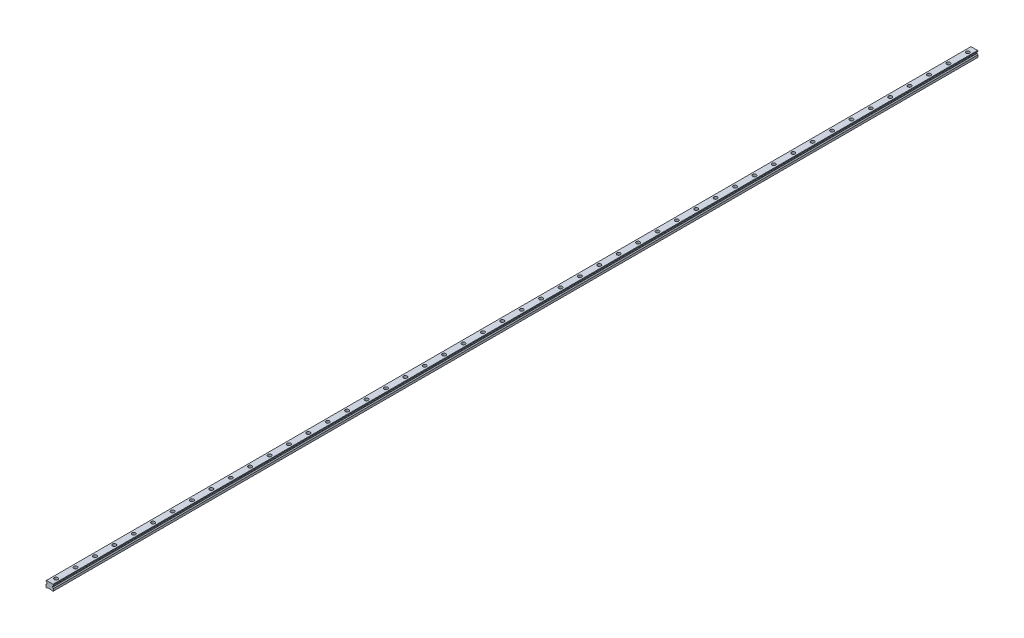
ISO-10303-21;
HEADER;
FILE_DESCRIPTION(('STEP AP214'),'2;1');
FILE_NAME('part.step','',(''),(''),'','','');
FILE_SCHEMA(('AUTOMOTIVE_DESIGN { 1 0 10303 214 1 1 1 1 }'));
ENDSEC;
DATA;
#1=APPLICATION_CONTEXT('core data for automotive mechanical design processes');
#2=APPLICATION_PROTOCOL_DEFINITION('international standard','automotive_design',2000,#1);
#3=PRODUCT_CONTEXT('',#1,'mechanical');
#4=PRODUCT('Part','Part','',(#3));
#5=PRODUCT_RELATED_PRODUCT_CATEGORY('part','',(#4));
#6=PRODUCT_DEFINITION_FORMATION('','',#4);
#7=PRODUCT_DEFINITION_CONTEXT('part definition',#1,'design');
#8=PRODUCT_DEFINITION('design','',#6,#7);
#9=PRODUCT_DEFINITION_SHAPE('','',#8);
#10=(LENGTH_UNIT() NAMED_UNIT(*) SI_UNIT(.MILLI.,.METRE.));
#11=(NAMED_UNIT(*) PLANE_ANGLE_UNIT() SI_UNIT($,.RADIAN.));
#12=(NAMED_UNIT(*) SI_UNIT($,.STERADIAN.) SOLID_ANGLE_UNIT());
#13=UNCERTAINTY_MEASURE_WITH_UNIT(LENGTH_MEASURE(1.E-05),#10,'distance_accuracy_value','');
#14=(GEOMETRIC_REPRESENTATION_CONTEXT(3) GLOBAL_UNCERTAINTY_ASSIGNED_CONTEXT((#13)) GLOBAL_UNIT_ASSIGNED_CONTEXT((#10,
#11,#12)) REPRESENTATION_CONTEXT('',''));
#15=CARTESIAN_POINT('',(0.,0.,0.));
#16=DIRECTION('',(0.,0.,1.));
#17=DIRECTION('',(1.,0.,0.));
#18=AXIS2_PLACEMENT_3D('',#15,#16,#17);
#19=CARTESIAN_POINT('',(0.,10.2,-1410.));
#20=DIRECTION('',(0.,1.,0.));
#21=DIRECTION('',(0.,0.,1.));
#22=AXIS2_PLACEMENT_3D('',#19,#20,#21);
#23=PLANE('',#22);
#24=CARTESIAN_POINT('',(0.,10.2,-1410.));
#25=DIRECTION('',(0.,1.,0.));
#26=DIRECTION('',(0.,0.,1.));
#27=AXIS2_PLACEMENT_3D('',#24,#25,#26);
#28=CIRCLE('',#27,3.49999999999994);
#29=CARTESIAN_POINT('',(0.,10.2,-1406.5));
#30=VERTEX_POINT('',#29);
#31=EDGE_CURVE('E726',#30,#30,#28,.T.);
#32=ORIENTED_EDGE('',*,*,#31,.F.);
#33=EDGE_LOOP('',(#32));
#34=FACE_BOUND('',#33,.T.);
#35=CARTESIAN_POINT('',(0.,10.2,-1410.));
#36=DIRECTION('',(0.,1.,0.));
#37=DIRECTION('',(0.,0.,1.));
#38=AXIS2_PLACEMENT_3D('',#35,#36,#37);
#39=CIRCLE('',#38,5.49999999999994);
#40=CARTESIAN_POINT('',(0.,10.2,-1404.5));
#41=VERTEX_POINT('',#40);
#42=EDGE_CURVE('E11',#41,#41,#39,.T.);
#43=ORIENTED_EDGE('',*,*,#42,.T.);
#44=EDGE_LOOP('',(#43));
#45=FACE_BOUND('',#44,.T.);
#46=ADVANCED_FACE('F39',(#34,#45),#23,.T.);
#47=CARTESIAN_POINT('',(0.,10.2,-1410.));
#48=DIRECTION('',(0.,1.,0.));
#49=DIRECTION('',(0.,0.,1.));
#50=AXIS2_PLACEMENT_3D('',#47,#48,#49);
#51=CYLINDRICAL_SURFACE('',#50,5.49999999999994);
#52=ORIENTED_EDGE('',*,*,#42,.F.);
#53=EDGE_LOOP('',(#52));
#54=FACE_BOUND('',#53,.T.);
#55=CARTESIAN_POINT('',(0.,19.2,-1410.));
#56=DIRECTION('',(0.,1.,0.));
#57=DIRECTION('',(0.,0.,1.));
#58=AXIS2_PLACEMENT_3D('',#55,#56,#57);
#59=CIRCLE('',#58,5.49999999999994);
#60=CARTESIAN_POINT('',(0.,19.2,-1404.5));
#61=VERTEX_POINT('',#60);
#62=EDGE_CURVE('E48',#61,#61,#59,.T.);
#63=ORIENTED_EDGE('',*,*,#62,.T.);
#64=EDGE_LOOP('',(#63));
#65=FACE_BOUND('',#64,.T.);
#66=ADVANCED_FACE('F1340',(#54,#65),#51,.F.);
#67=CARTESIAN_POINT('',(0.,10.2,-1350.));
#68=DIRECTION('',(0.,1.,0.));
#69=DIRECTION('',(0.,0.,1.));
#70=AXIS2_PLACEMENT_3D('',#67,#68,#69);
#71=PLANE('',#70);
#72=CARTESIAN_POINT('',(0.,10.2,-1350.));
#73=DIRECTION('',(0.,1.,0.));
#74=DIRECTION('',(0.,0.,1.));
#75=AXIS2_PLACEMENT_3D('',#72,#73,#74);
#76=CIRCLE('',#75,3.49999999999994);
#77=CARTESIAN_POINT('',(0.,10.2,-1346.5));
#78=VERTEX_POINT('',#77);
#79=EDGE_CURVE('E731',#78,#78,#76,.T.);
#80=ORIENTED_EDGE('',*,*,#79,.F.);
#81=EDGE_LOOP('',(#80));
#82=FACE_BOUND('',#81,.T.);
#83=CARTESIAN_POINT('',(0.,10.2,-1350.));
#84=DIRECTION('',(0.,1.,0.));
#85=DIRECTION('',(0.,0.,1.));
#86=AXIS2_PLACEMENT_3D('',#83,#84,#85);
#87=CIRCLE('',#86,5.49999999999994);
#88=CARTESIAN_POINT('',(0.,10.2,-1344.5));
#89=VERTEX_POINT('',#88);
#90=EDGE_CURVE('E710',#89,#89,#87,.T.);
#91=ORIENTED_EDGE('',*,*,#90,.T.);
#92=EDGE_LOOP('',(#91));
#93=FACE_BOUND('',#92,.T.);
#94=ADVANCED_FACE('F1342',(#82,#93),#71,.T.);
#95=CARTESIAN_POINT('',(0.,10.2,-1350.));
#96=DIRECTION('',(0.,1.,0.));
#97=DIRECTION('',(0.,0.,1.));
#98=AXIS2_PLACEMENT_3D('',#95,#96,#97);
#99=CYLINDRICAL_SURFACE('',#98,5.49999999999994);
#100=ORIENTED_EDGE('',*,*,#90,.F.);
#101=EDGE_LOOP('',(#100));
#102=FACE_BOUND('',#101,.T.);
#103=CARTESIAN_POINT('',(0.,19.2,-1350.));
#104=DIRECTION('',(0.,1.,0.));
#105=DIRECTION('',(0.,0.,1.));
#106=AXIS2_PLACEMENT_3D('',#103,#104,#105);
#107=CIRCLE('',#106,5.49999999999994);
#108=CARTESIAN_POINT('',(0.,19.2,-1344.5));
#109=VERTEX_POINT('',#108);
#110=EDGE_CURVE('E706',#109,#109,#107,.T.);
#111=ORIENTED_EDGE('',*,*,#110,.T.);
#112=EDGE_LOOP('',(#111));
#113=FACE_BOUND('',#112,.T.);
#114=ADVANCED_FACE('F1348',(#102,#113),#99,.F.);
#115=CARTESIAN_POINT('',(0.,10.2,-1290.));
#116=DIRECTION('',(0.,1.,0.));
#117=DIRECTION('',(0.,0.,1.));
#118=AXIS2_PLACEMENT_3D('',#115,#116,#117);
#119=PLANE('',#118);
#120=CARTESIAN_POINT('',(0.,10.2,-1290.));
#121=DIRECTION('',(0.,1.,0.));
#122=DIRECTION('',(0.,0.,1.));
#123=AXIS2_PLACEMENT_3D('',#120,#121,#122);
#124=CIRCLE('',#123,3.49999999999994);
#125=CARTESIAN_POINT('',(0.,10.2,-1286.5));
#126=VERTEX_POINT('',#125);
#127=EDGE_CURVE('E736',#126,#126,#124,.T.);
#128=ORIENTED_EDGE('',*,*,#127,.F.);
#129=EDGE_LOOP('',(#128));
#130=FACE_BOUND('',#129,.T.);
#131=CARTESIAN_POINT('',(0.,10.2,-1290.));
#132=DIRECTION('',(0.,1.,0.));
#133=DIRECTION('',(0.,0.,1.));
#134=AXIS2_PLACEMENT_3D('',#131,#132,#133);
#135=CIRCLE('',#134,5.49999999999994);
#136=CARTESIAN_POINT('',(0.,10.2,-1284.5));
#137=VERTEX_POINT('',#136);
#138=EDGE_CURVE('E702',#137,#137,#135,.T.);
#139=ORIENTED_EDGE('',*,*,#138,.T.);
#140=EDGE_LOOP('',(#139));
#141=FACE_BOUND('',#140,.T.);
#142=ADVANCED_FACE('F1356',(#130,#141),#119,.T.);
#143=CARTESIAN_POINT('',(0.,10.2,-1290.));
#144=DIRECTION('',(0.,1.,0.));
#145=DIRECTION('',(0.,0.,1.));
#146=AXIS2_PLACEMENT_3D('',#143,#144,#145);
#147=CYLINDRICAL_SURFACE('',#146,5.49999999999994);
#148=ORIENTED_EDGE('',*,*,#138,.F.);
#149=EDGE_LOOP('',(#148));
#150=FACE_BOUND('',#149,.T.);
#151=CARTESIAN_POINT('',(0.,19.2,-1290.));
#152=DIRECTION('',(0.,1.,0.));
#153=DIRECTION('',(0.,0.,1.));
#154=AXIS2_PLACEMENT_3D('',#151,#152,#153);
#155=CIRCLE('',#154,5.49999999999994);
#156=CARTESIAN_POINT('',(0.,19.2,-1284.5));
#157=VERTEX_POINT('',#156);
#158=EDGE_CURVE('E698',#157,#157,#155,.T.);
#159=ORIENTED_EDGE('',*,*,#158,.T.);
#160=EDGE_LOOP('',(#159));
#161=FACE_BOUND('',#160,.T.);
#162=ADVANCED_FACE('F1360',(#150,#161),#147,.F.);
#163=CARTESIAN_POINT('',(0.,10.2,-1230.));
#164=DIRECTION('',(0.,1.,0.));
#165=DIRECTION('',(0.,0.,1.));
#166=AXIS2_PLACEMENT_3D('',#163,#164,#165);
#167=PLANE('',#166);
#168=CARTESIAN_POINT('',(0.,10.2,-1230.));
#169=DIRECTION('',(0.,1.,0.));
#170=DIRECTION('',(0.,0.,1.));
#171=AXIS2_PLACEMENT_3D('',#168,#169,#170);
#172=CIRCLE('',#171,3.49999999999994);
#173=CARTESIAN_POINT('',(0.,10.2,-1226.5));
#174=VERTEX_POINT('',#173);
#175=EDGE_CURVE('E741',#174,#174,#172,.T.);
#176=ORIENTED_EDGE('',*,*,#175,.F.);
#177=EDGE_LOOP('',(#176));
#178=FACE_BOUND('',#177,.T.);
#179=CARTESIAN_POINT('',(0.,10.2,-1230.));
#180=DIRECTION('',(0.,1.,0.));
#181=DIRECTION('',(0.,0.,1.));
#182=AXIS2_PLACEMENT_3D('',#179,#180,#181);
#183=CIRCLE('',#182,5.49999999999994);
#184=CARTESIAN_POINT('',(0.,10.2,-1224.5));
#185=VERTEX_POINT('',#184);
#186=EDGE_CURVE('E694',#185,#185,#183,.T.);
#187=ORIENTED_EDGE('',*,*,#186,.T.);
#188=EDGE_LOOP('',(#187));
#189=FACE_BOUND('',#188,.T.);
#190=ADVANCED_FACE('F1364',(#178,#189),#167,.T.);
#191=CARTESIAN_POINT('',(0.,10.2,-1230.));
#192=DIRECTION('',(0.,1.,0.));
#193=DIRECTION('',(0.,0.,1.));
#194=AXIS2_PLACEMENT_3D('',#191,#192,#193);
#195=CYLINDRICAL_SURFACE('',#194,5.49999999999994);
#196=ORIENTED_EDGE('',*,*,#186,.F.);
#197=EDGE_LOOP('',(#196));
#198=FACE_BOUND('',#197,.T.);
#199=CARTESIAN_POINT('',(0.,19.2,-1230.));
#200=DIRECTION('',(0.,1.,0.));
#201=DIRECTION('',(0.,0.,1.));
#202=AXIS2_PLACEMENT_3D('',#199,#200,#201);
#203=CIRCLE('',#202,5.49999999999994);
#204=CARTESIAN_POINT('',(0.,19.2,-1224.5));
#205=VERTEX_POINT('',#204);
#206=EDGE_CURVE('E690',#205,#205,#203,.T.);
#207=ORIENTED_EDGE('',*,*,#206,.T.);
#208=EDGE_LOOP('',(#207));
#209=FACE_BOUND('',#208,.T.);
#210=ADVANCED_FACE('F1368',(#198,#209),#195,.F.);
#211=CARTESIAN_POINT('',(0.,10.2,-1170.));
#212=DIRECTION('',(0.,1.,0.));
#213=DIRECTION('',(0.,0.,1.));
#214=AXIS2_PLACEMENT_3D('',#211,#212,#213);
#215=PLANE('',#214);
#216=CARTESIAN_POINT('',(0.,10.2,-1170.));
#217=DIRECTION('',(0.,1.,0.));
#218=DIRECTION('',(0.,0.,1.));
#219=AXIS2_PLACEMENT_3D('',#216,#217,#218);
#220=CIRCLE('',#219,3.49999999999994);
#221=CARTESIAN_POINT('',(0.,10.2,-1166.5));
#222=VERTEX_POINT('',#221);
#223=EDGE_CURVE('E746',#222,#222,#220,.T.);
#224=ORIENTED_EDGE('',*,*,#223,.F.);
#225=EDGE_LOOP('',(#224));
#226=FACE_BOUND('',#225,.T.);
#227=CARTESIAN_POINT('',(0.,10.2,-1170.));
#228=DIRECTION('',(0.,1.,0.));
#229=DIRECTION('',(0.,0.,1.));
#230=AXIS2_PLACEMENT_3D('',#227,#228,#229);
#231=CIRCLE('',#230,5.49999999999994);
#232=CARTESIAN_POINT('',(0.,10.2,-1164.5));
#233=VERTEX_POINT('',#232);
#234=EDGE_CURVE('E686',#233,#233,#231,.T.);
#235=ORIENTED_EDGE('',*,*,#234,.T.);
#236=EDGE_LOOP('',(#235));
#237=FACE_BOUND('',#236,.T.);
#238=ADVANCED_FACE('F1372',(#226,#237),#215,.T.);
#239=CARTESIAN_POINT('',(0.,10.2,-1170.));
#240=DIRECTION('',(0.,1.,0.));
#241=DIRECTION('',(0.,0.,1.));
#242=AXIS2_PLACEMENT_3D('',#239,#240,#241);
#243=CYLINDRICAL_SURFACE('',#242,5.49999999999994);
#244=ORIENTED_EDGE('',*,*,#234,.F.);
#245=EDGE_LOOP('',(#244));
#246=FACE_BOUND('',#245,.T.);
#247=CARTESIAN_POINT('',(0.,19.2,-1170.));
#248=DIRECTION('',(0.,1.,0.));
#249=DIRECTION('',(0.,0.,1.));
#250=AXIS2_PLACEMENT_3D('',#247,#248,#249);
#251=CIRCLE('',#250,5.49999999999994);
#252=CARTESIAN_POINT('',(0.,19.2,-1164.5));
#253=VERTEX_POINT('',#252);
#254=EDGE_CURVE('E682',#253,#253,#251,.T.);
#255=ORIENTED_EDGE('',*,*,#254,.T.);
#256=EDGE_LOOP('',(#255));
#257=FACE_BOUND('',#256,.T.);
#258=ADVANCED_FACE('F1376',(#246,#257),#243,.F.);
#259=CARTESIAN_POINT('',(0.,10.2,-1110.));
#260=DIRECTION('',(0.,1.,0.));
#261=DIRECTION('',(0.,0.,1.));
#262=AXIS2_PLACEMENT_3D('',#259,#260,#261);
#263=PLANE('',#262);
#264=CARTESIAN_POINT('',(0.,10.2,-1110.));
#265=DIRECTION('',(0.,1.,0.));
#266=DIRECTION('',(0.,0.,1.));
#267=AXIS2_PLACEMENT_3D('',#264,#265,#266);
#268=CIRCLE('',#267,3.49999999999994);
#269=CARTESIAN_POINT('',(0.,10.2,-1106.5));
#270=VERTEX_POINT('',#269);
#271=EDGE_CURVE('E751',#270,#270,#268,.T.);
#272=ORIENTED_EDGE('',*,*,#271,.F.);
#273=EDGE_LOOP('',(#272));
#274=FACE_BOUND('',#273,.T.);
#275=CARTESIAN_POINT('',(0.,10.2,-1110.));
#276=DIRECTION('',(0.,1.,0.));
#277=DIRECTION('',(0.,0.,1.));
#278=AXIS2_PLACEMENT_3D('',#275,#276,#277);
#279=CIRCLE('',#278,5.49999999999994);
#280=CARTESIAN_POINT('',(0.,10.2,-1104.5));
#281=VERTEX_POINT('',#280);
#282=EDGE_CURVE('E678',#281,#281,#279,.T.);
#283=ORIENTED_EDGE('',*,*,#282,.T.);
#284=EDGE_LOOP('',(#283));
#285=FACE_BOUND('',#284,.T.);
#286=ADVANCED_FACE('F1380',(#274,#285),#263,.T.);
#287=CARTESIAN_POINT('',(0.,10.2,-1110.));
#288=DIRECTION('',(0.,1.,0.));
#289=DIRECTION('',(0.,0.,1.));
#290=AXIS2_PLACEMENT_3D('',#287,#288,#289);
#291=CYLINDRICAL_SURFACE('',#290,5.49999999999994);
#292=ORIENTED_EDGE('',*,*,#282,.F.);
#293=EDGE_LOOP('',(#292));
#294=FACE_BOUND('',#293,.T.);
#295=CARTESIAN_POINT('',(0.,19.2,-1110.));
#296=DIRECTION('',(0.,1.,0.));
#297=DIRECTION('',(0.,0.,1.));
#298=AXIS2_PLACEMENT_3D('',#295,#296,#297);
#299=CIRCLE('',#298,5.49999999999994);
#300=CARTESIAN_POINT('',(0.,19.2,-1104.5));
#301=VERTEX_POINT('',#300);
#302=EDGE_CURVE('E674',#301,#301,#299,.T.);
#303=ORIENTED_EDGE('',*,*,#302,.T.);
#304=EDGE_LOOP('',(#303));
#305=FACE_BOUND('',#304,.T.);
#306=ADVANCED_FACE('F1384',(#294,#305),#291,.F.);
#307=CARTESIAN_POINT('',(0.,10.2,-1050.));
#308=DIRECTION('',(0.,1.,0.));
#309=DIRECTION('',(0.,0.,1.));
#310=AXIS2_PLACEMENT_3D('',#307,#308,#309);
#311=PLANE('',#310);
#312=CARTESIAN_POINT('',(0.,10.2,-1050.));
#313=DIRECTION('',(0.,1.,0.));
#314=DIRECTION('',(0.,0.,1.));
#315=AXIS2_PLACEMENT_3D('',#312,#313,#314);
#316=CIRCLE('',#315,3.49999999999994);
#317=CARTESIAN_POINT('',(0.,10.2,-1046.5));
#318=VERTEX_POINT('',#317);
#319=EDGE_CURVE('E756',#318,#318,#316,.T.);
#320=ORIENTED_EDGE('',*,*,#319,.F.);
#321=EDGE_LOOP('',(#320));
#322=FACE_BOUND('',#321,.T.);
#323=CARTESIAN_POINT('',(0.,10.2,-1050.));
#324=DIRECTION('',(0.,1.,0.));
#325=DIRECTION('',(0.,0.,1.));
#326=AXIS2_PLACEMENT_3D('',#323,#324,#325);
#327=CIRCLE('',#326,5.49999999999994);
#328=CARTESIAN_POINT('',(0.,10.2,-1044.5));
#329=VERTEX_POINT('',#328);
#330=EDGE_CURVE('E670',#329,#329,#327,.T.);
#331=ORIENTED_EDGE('',*,*,#330,.T.);
#332=EDGE_LOOP('',(#331));
#333=FACE_BOUND('',#332,.T.);
#334=ADVANCED_FACE('F1388',(#322,#333),#311,.T.);
#335=CARTESIAN_POINT('',(0.,10.2,-1050.));
#336=DIRECTION('',(0.,1.,0.));
#337=DIRECTION('',(0.,0.,1.));
#338=AXIS2_PLACEMENT_3D('',#335,#336,#337);
#339=CYLINDRICAL_SURFACE('',#338,5.49999999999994);
#340=ORIENTED_EDGE('',*,*,#330,.F.);
#341=EDGE_LOOP('',(#340));
#342=FACE_BOUND('',#341,.T.);
#343=CARTESIAN_POINT('',(0.,19.2,-1050.));
#344=DIRECTION('',(0.,1.,0.));
#345=DIRECTION('',(0.,0.,1.));
#346=AXIS2_PLACEMENT_3D('',#343,#344,#345);
#347=CIRCLE('',#346,5.49999999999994);
#348=CARTESIAN_POINT('',(0.,19.2,-1044.5));
#349=VERTEX_POINT('',#348);
#350=EDGE_CURVE('E666',#349,#349,#347,.T.);
#351=ORIENTED_EDGE('',*,*,#350,.T.);
#352=EDGE_LOOP('',(#351));
#353=FACE_BOUND('',#352,.T.);
#354=ADVANCED_FACE('F1392',(#342,#353),#339,.F.);
#355=CARTESIAN_POINT('',(0.,10.2,-990.));
#356=DIRECTION('',(0.,1.,0.));
#357=DIRECTION('',(0.,0.,1.));
#358=AXIS2_PLACEMENT_3D('',#355,#356,#357);
#359=PLANE('',#358);
#360=CARTESIAN_POINT('',(0.,10.2,-990.));
#361=DIRECTION('',(0.,1.,0.));
#362=DIRECTION('',(0.,0.,1.));
#363=AXIS2_PLACEMENT_3D('',#360,#361,#362);
#364=CIRCLE('',#363,3.49999999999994);
#365=CARTESIAN_POINT('',(0.,10.2,-986.5));
#366=VERTEX_POINT('',#365);
#367=EDGE_CURVE('E761',#366,#366,#364,.T.);
#368=ORIENTED_EDGE('',*,*,#367,.F.);
#369=EDGE_LOOP('',(#368));
#370=FACE_BOUND('',#369,.T.);
#371=CARTESIAN_POINT('',(0.,10.2,-990.));
#372=DIRECTION('',(0.,1.,0.));
#373=DIRECTION('',(0.,0.,1.));
#374=AXIS2_PLACEMENT_3D('',#371,#372,#373);
#375=CIRCLE('',#374,5.49999999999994);
#376=CARTESIAN_POINT('',(0.,10.2,-984.5));
#377=VERTEX_POINT('',#376);
#378=EDGE_CURVE('E662',#377,#377,#375,.T.);
#379=ORIENTED_EDGE('',*,*,#378,.T.);
#380=EDGE_LOOP('',(#379));
#381=FACE_BOUND('',#380,.T.);
#382=ADVANCED_FACE('F1396',(#370,#381),#359,.T.);
#383=CARTESIAN_POINT('',(0.,10.2,-990.));
#384=DIRECTION('',(0.,1.,0.));
#385=DIRECTION('',(0.,0.,1.));
#386=AXIS2_PLACEMENT_3D('',#383,#384,#385);
#387=CYLINDRICAL_SURFACE('',#386,5.49999999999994);
#388=ORIENTED_EDGE('',*,*,#378,.F.);
#389=EDGE_LOOP('',(#388));
#390=FACE_BOUND('',#389,.T.);
#391=CARTESIAN_POINT('',(0.,19.2,-990.));
#392=DIRECTION('',(0.,1.,0.));
#393=DIRECTION('',(0.,0.,1.));
#394=AXIS2_PLACEMENT_3D('',#391,#392,#393);
#395=CIRCLE('',#394,5.49999999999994);
#396=CARTESIAN_POINT('',(0.,19.2,-984.5));
#397=VERTEX_POINT('',#396);
#398=EDGE_CURVE('E658',#397,#397,#395,.T.);
#399=ORIENTED_EDGE('',*,*,#398,.T.);
#400=EDGE_LOOP('',(#399));
#401=FACE_BOUND('',#400,.T.);
#402=ADVANCED_FACE('F1400',(#390,#401),#387,.F.);
#403=CARTESIAN_POINT('',(0.,10.2,-930.));
#404=DIRECTION('',(0.,1.,0.));
#405=DIRECTION('',(0.,0.,1.));
#406=AXIS2_PLACEMENT_3D('',#403,#404,#405);
#407=PLANE('',#406);
#408=CARTESIAN_POINT('',(0.,10.2,-930.));
#409=DIRECTION('',(0.,1.,0.));
#410=DIRECTION('',(0.,0.,1.));
#411=AXIS2_PLACEMENT_3D('',#408,#409,#410);
#412=CIRCLE('',#411,3.49999999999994);
#413=CARTESIAN_POINT('',(0.,10.2,-926.5));
#414=VERTEX_POINT('',#413);
#415=EDGE_CURVE('E766',#414,#414,#412,.T.);
#416=ORIENTED_EDGE('',*,*,#415,.F.);
#417=EDGE_LOOP('',(#416));
#418=FACE_BOUND('',#417,.T.);
#419=CARTESIAN_POINT('',(0.,10.2,-930.));
#420=DIRECTION('',(0.,1.,0.));
#421=DIRECTION('',(0.,0.,1.));
#422=AXIS2_PLACEMENT_3D('',#419,#420,#421);
#423=CIRCLE('',#422,5.49999999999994);
#424=CARTESIAN_POINT('',(0.,10.2,-924.5));
#425=VERTEX_POINT('',#424);
#426=EDGE_CURVE('E654',#425,#425,#423,.T.);
#427=ORIENTED_EDGE('',*,*,#426,.T.);
#428=EDGE_LOOP('',(#427));
#429=FACE_BOUND('',#428,.T.);
#430=ADVANCED_FACE('F1404',(#418,#429),#407,.T.);
#431=CARTESIAN_POINT('',(0.,10.2,-930.));
#432=DIRECTION('',(0.,1.,0.));
#433=DIRECTION('',(0.,0.,1.));
#434=AXIS2_PLACEMENT_3D('',#431,#432,#433);
#435=CYLINDRICAL_SURFACE('',#434,5.49999999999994);
#436=ORIENTED_EDGE('',*,*,#426,.F.);
#437=EDGE_LOOP('',(#436));
#438=FACE_BOUND('',#437,.T.);
#439=CARTESIAN_POINT('',(0.,19.2,-930.));
#440=DIRECTION('',(0.,1.,0.));
#441=DIRECTION('',(0.,0.,1.));
#442=AXIS2_PLACEMENT_3D('',#439,#440,#441);
#443=CIRCLE('',#442,5.49999999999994);
#444=CARTESIAN_POINT('',(0.,19.2,-924.5));
#445=VERTEX_POINT('',#444);
#446=EDGE_CURVE('E650',#445,#445,#443,.T.);
#447=ORIENTED_EDGE('',*,*,#446,.T.);
#448=EDGE_LOOP('',(#447));
#449=FACE_BOUND('',#448,.T.);
#450=ADVANCED_FACE('F1408',(#438,#449),#435,.F.);
#451=CARTESIAN_POINT('',(0.,10.2,-870.));
#452=DIRECTION('',(0.,1.,0.));
#453=DIRECTION('',(0.,0.,1.));
#454=AXIS2_PLACEMENT_3D('',#451,#452,#453);
#455=PLANE('',#454);
#456=CARTESIAN_POINT('',(0.,10.2,-870.));
#457=DIRECTION('',(0.,1.,0.));
#458=DIRECTION('',(0.,0.,1.));
#459=AXIS2_PLACEMENT_3D('',#456,#457,#458);
#460=CIRCLE('',#459,3.49999999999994);
#461=CARTESIAN_POINT('',(0.,10.2,-866.5));
#462=VERTEX_POINT('',#461);
#463=EDGE_CURVE('E771',#462,#462,#460,.T.);
#464=ORIENTED_EDGE('',*,*,#463,.F.);
#465=EDGE_LOOP('',(#464));
#466=FACE_BOUND('',#465,.T.);
#467=CARTESIAN_POINT('',(0.,10.2,-870.));
#468=DIRECTION('',(0.,1.,0.));
#469=DIRECTION('',(0.,0.,1.));
#470=AXIS2_PLACEMENT_3D('',#467,#468,#469);
#471=CIRCLE('',#470,5.49999999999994);
#472=CARTESIAN_POINT('',(0.,10.2,-864.5));
#473=VERTEX_POINT('',#472);
#474=EDGE_CURVE('E646',#473,#473,#471,.T.);
#475=ORIENTED_EDGE('',*,*,#474,.T.);
#476=EDGE_LOOP('',(#475));
#477=FACE_BOUND('',#476,.T.);
#478=ADVANCED_FACE('F1412',(#466,#477),#455,.T.);
#479=CARTESIAN_POINT('',(0.,10.2,-870.));
#480=DIRECTION('',(0.,1.,0.));
#481=DIRECTION('',(0.,0.,1.));
#482=AXIS2_PLACEMENT_3D('',#479,#480,#481);
#483=CYLINDRICAL_SURFACE('',#482,5.49999999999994);
#484=ORIENTED_EDGE('',*,*,#474,.F.);
#485=EDGE_LOOP('',(#484));
#486=FACE_BOUND('',#485,.T.);
#487=CARTESIAN_POINT('',(0.,19.2,-870.));
#488=DIRECTION('',(0.,1.,0.));
#489=DIRECTION('',(0.,0.,1.));
#490=AXIS2_PLACEMENT_3D('',#487,#488,#489);
#491=CIRCLE('',#490,5.49999999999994);
#492=CARTESIAN_POINT('',(0.,19.2,-864.5));
#493=VERTEX_POINT('',#492);
#494=EDGE_CURVE('E642',#493,#493,#491,.T.);
#495=ORIENTED_EDGE('',*,*,#494,.T.);
#496=EDGE_LOOP('',(#495));
#497=FACE_BOUND('',#496,.T.);
#498=ADVANCED_FACE('F1416',(#486,#497),#483,.F.);
#499=CARTESIAN_POINT('',(0.,10.2,-810.));
#500=DIRECTION('',(0.,1.,0.));
#501=DIRECTION('',(0.,0.,1.));
#502=AXIS2_PLACEMENT_3D('',#499,#500,#501);
#503=PLANE('',#502);
#504=CARTESIAN_POINT('',(0.,10.2,-810.));
#505=DIRECTION('',(0.,1.,0.));
#506=DIRECTION('',(0.,0.,1.));
#507=AXIS2_PLACEMENT_3D('',#504,#505,#506);
#508=CIRCLE('',#507,3.49999999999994);
#509=CARTESIAN_POINT('',(0.,10.2,-806.5));
#510=VERTEX_POINT('',#509);
#511=EDGE_CURVE('E776',#510,#510,#508,.T.);
#512=ORIENTED_EDGE('',*,*,#511,.F.);
#513=EDGE_LOOP('',(#512));
#514=FACE_BOUND('',#513,.T.);
#515=CARTESIAN_POINT('',(0.,10.2,-810.));
#516=DIRECTION('',(0.,1.,0.));
#517=DIRECTION('',(0.,0.,1.));
#518=AXIS2_PLACEMENT_3D('',#515,#516,#517);
#519=CIRCLE('',#518,5.49999999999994);
#520=CARTESIAN_POINT('',(0.,10.2,-804.5));
#521=VERTEX_POINT('',#520);
#522=EDGE_CURVE('E638',#521,#521,#519,.T.);
#523=ORIENTED_EDGE('',*,*,#522,.T.);
#524=EDGE_LOOP('',(#523));
#525=FACE_BOUND('',#524,.T.);
#526=ADVANCED_FACE('F1420',(#514,#525),#503,.T.);
#527=CARTESIAN_POINT('',(0.,10.2,-810.));
#528=DIRECTION('',(0.,1.,0.));
#529=DIRECTION('',(0.,0.,1.));
#530=AXIS2_PLACEMENT_3D('',#527,#528,#529);
#531=CYLINDRICAL_SURFACE('',#530,5.49999999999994);
#532=ORIENTED_EDGE('',*,*,#522,.F.);
#533=EDGE_LOOP('',(#532));
#534=FACE_BOUND('',#533,.T.);
#535=CARTESIAN_POINT('',(0.,19.2,-810.));
#536=DIRECTION('',(0.,1.,0.));
#537=DIRECTION('',(0.,0.,1.));
#538=AXIS2_PLACEMENT_3D('',#535,#536,#537);
#539=CIRCLE('',#538,5.49999999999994);
#540=CARTESIAN_POINT('',(0.,19.2,-804.5));
#541=VERTEX_POINT('',#540);
#542=EDGE_CURVE('E634',#541,#541,#539,.T.);
#543=ORIENTED_EDGE('',*,*,#542,.T.);
#544=EDGE_LOOP('',(#543));
#545=FACE_BOUND('',#544,.T.);
#546=ADVANCED_FACE('F1424',(#534,#545),#531,.F.);
#547=CARTESIAN_POINT('',(0.,10.2,-750.));
#548=DIRECTION('',(0.,1.,0.));
#549=DIRECTION('',(0.,0.,1.));
#550=AXIS2_PLACEMENT_3D('',#547,#548,#549);
#551=PLANE('',#550);
#552=CARTESIAN_POINT('',(0.,10.2,-750.));
#553=DIRECTION('',(0.,1.,0.));
#554=DIRECTION('',(0.,0.,1.));
#555=AXIS2_PLACEMENT_3D('',#552,#553,#554);
#556=CIRCLE('',#555,3.49999999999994);
#557=CARTESIAN_POINT('',(0.,10.2,-746.5));
#558=VERTEX_POINT('',#557);
#559=EDGE_CURVE('E781',#558,#558,#556,.T.);
#560=ORIENTED_EDGE('',*,*,#559,.F.);
#561=EDGE_LOOP('',(#560));
#562=FACE_BOUND('',#561,.T.);
#563=CARTESIAN_POINT('',(0.,10.2,-750.));
#564=DIRECTION('',(0.,1.,0.));
#565=DIRECTION('',(0.,0.,1.));
#566=AXIS2_PLACEMENT_3D('',#563,#564,#565);
#567=CIRCLE('',#566,5.49999999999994);
#568=CARTESIAN_POINT('',(0.,10.2,-744.5));
#569=VERTEX_POINT('',#568);
#570=EDGE_CURVE('E630',#569,#569,#567,.T.);
#571=ORIENTED_EDGE('',*,*,#570,.T.);
#572=EDGE_LOOP('',(#571));
#573=FACE_BOUND('',#572,.T.);
#574=ADVANCED_FACE('F1428',(#562,#573),#551,.T.);
#575=CARTESIAN_POINT('',(0.,10.2,-750.));
#576=DIRECTION('',(0.,1.,0.));
#577=DIRECTION('',(0.,0.,1.));
#578=AXIS2_PLACEMENT_3D('',#575,#576,#577);
#579=CYLINDRICAL_SURFACE('',#578,5.49999999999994);
#580=ORIENTED_EDGE('',*,*,#570,.F.);
#581=EDGE_LOOP('',(#580));
#582=FACE_BOUND('',#581,.T.);
#583=CARTESIAN_POINT('',(0.,19.2,-750.));
#584=DIRECTION('',(0.,1.,0.));
#585=DIRECTION('',(0.,0.,1.));
#586=AXIS2_PLACEMENT_3D('',#583,#584,#585);
#587=CIRCLE('',#586,5.49999999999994);
#588=CARTESIAN_POINT('',(0.,19.2,-744.5));
#589=VERTEX_POINT('',#588);
#590=EDGE_CURVE('E626',#589,#589,#587,.T.);
#591=ORIENTED_EDGE('',*,*,#590,.T.);
#592=EDGE_LOOP('',(#591));
#593=FACE_BOUND('',#592,.T.);
#594=ADVANCED_FACE('F1432',(#582,#593),#579,.F.);
#595=CARTESIAN_POINT('',(0.,10.2,-690.));
#596=DIRECTION('',(0.,1.,0.));
#597=DIRECTION('',(0.,0.,1.));
#598=AXIS2_PLACEMENT_3D('',#595,#596,#597);
#599=PLANE('',#598);
#600=CARTESIAN_POINT('',(0.,10.2,-690.));
#601=DIRECTION('',(0.,1.,0.));
#602=DIRECTION('',(0.,0.,1.));
#603=AXIS2_PLACEMENT_3D('',#600,#601,#602);
#604=CIRCLE('',#603,3.49999999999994);
#605=CARTESIAN_POINT('',(0.,10.2,-686.5));
#606=VERTEX_POINT('',#605);
#607=EDGE_CURVE('E786',#606,#606,#604,.T.);
#608=ORIENTED_EDGE('',*,*,#607,.F.);
#609=EDGE_LOOP('',(#608));
#610=FACE_BOUND('',#609,.T.);
#611=CARTESIAN_POINT('',(0.,10.2,-690.));
#612=DIRECTION('',(0.,1.,0.));
#613=DIRECTION('',(0.,0.,1.));
#614=AXIS2_PLACEMENT_3D('',#611,#612,#613);
#615=CIRCLE('',#614,5.49999999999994);
#616=CARTESIAN_POINT('',(0.,10.2,-684.5));
#617=VERTEX_POINT('',#616);
#618=EDGE_CURVE('E622',#617,#617,#615,.T.);
#619=ORIENTED_EDGE('',*,*,#618,.T.);
#620=EDGE_LOOP('',(#619));
#621=FACE_BOUND('',#620,.T.);
#622=ADVANCED_FACE('F1436',(#610,#621),#599,.T.);
#623=CARTESIAN_POINT('',(0.,10.2,-690.));
#624=DIRECTION('',(0.,1.,0.));
#625=DIRECTION('',(0.,0.,1.));
#626=AXIS2_PLACEMENT_3D('',#623,#624,#625);
#627=CYLINDRICAL_SURFACE('',#626,5.49999999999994);
#628=ORIENTED_EDGE('',*,*,#618,.F.);
#629=EDGE_LOOP('',(#628));
#630=FACE_BOUND('',#629,.T.);
#631=CARTESIAN_POINT('',(0.,19.2,-690.));
#632=DIRECTION('',(0.,1.,0.));
#633=DIRECTION('',(0.,0.,1.));
#634=AXIS2_PLACEMENT_3D('',#631,#632,#633);
#635=CIRCLE('',#634,5.49999999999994);
#636=CARTESIAN_POINT('',(0.,19.2,-684.5));
#637=VERTEX_POINT('',#636);
#638=EDGE_CURVE('E618',#637,#637,#635,.T.);
#639=ORIENTED_EDGE('',*,*,#638,.T.);
#640=EDGE_LOOP('',(#639));
#641=FACE_BOUND('',#640,.T.);
#642=ADVANCED_FACE('F1440',(#630,#641),#627,.F.);
#643=CARTESIAN_POINT('',(0.,10.2,-630.));
#644=DIRECTION('',(0.,1.,0.));
#645=DIRECTION('',(0.,0.,1.));
#646=AXIS2_PLACEMENT_3D('',#643,#644,#645);
#647=PLANE('',#646);
#648=CARTESIAN_POINT('',(0.,10.2,-630.));
#649=DIRECTION('',(0.,1.,0.));
#650=DIRECTION('',(0.,0.,1.));
#651=AXIS2_PLACEMENT_3D('',#648,#649,#650);
#652=CIRCLE('',#651,3.49999999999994);
#653=CARTESIAN_POINT('',(0.,10.2,-626.5));
#654=VERTEX_POINT('',#653);
#655=EDGE_CURVE('E791',#654,#654,#652,.T.);
#656=ORIENTED_EDGE('',*,*,#655,.F.);
#657=EDGE_LOOP('',(#656));
#658=FACE_BOUND('',#657,.T.);
#659=CARTESIAN_POINT('',(0.,10.2,-630.));
#660=DIRECTION('',(0.,1.,0.));
#661=DIRECTION('',(0.,0.,1.));
#662=AXIS2_PLACEMENT_3D('',#659,#660,#661);
#663=CIRCLE('',#662,5.49999999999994);
#664=CARTESIAN_POINT('',(0.,10.2,-624.5));
#665=VERTEX_POINT('',#664);
#666=EDGE_CURVE('E614',#665,#665,#663,.T.);
#667=ORIENTED_EDGE('',*,*,#666,.T.);
#668=EDGE_LOOP('',(#667));
#669=FACE_BOUND('',#668,.T.);
#670=ADVANCED_FACE('F1444',(#658,#669),#647,.T.);
#671=CARTESIAN_POINT('',(0.,10.2,-630.));
#672=DIRECTION('',(0.,1.,0.));
#673=DIRECTION('',(0.,0.,1.));
#674=AXIS2_PLACEMENT_3D('',#671,#672,#673);
#675=CYLINDRICAL_SURFACE('',#674,5.49999999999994);
#676=ORIENTED_EDGE('',*,*,#666,.F.);
#677=EDGE_LOOP('',(#676));
#678=FACE_BOUND('',#677,.T.);
#679=CARTESIAN_POINT('',(0.,19.2,-630.));
#680=DIRECTION('',(0.,1.,0.));
#681=DIRECTION('',(0.,0.,1.));
#682=AXIS2_PLACEMENT_3D('',#679,#680,#681);
#683=CIRCLE('',#682,5.49999999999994);
#684=CARTESIAN_POINT('',(0.,19.2,-624.5));
#685=VERTEX_POINT('',#684);
#686=EDGE_CURVE('E610',#685,#685,#683,.T.);
#687=ORIENTED_EDGE('',*,*,#686,.T.);
#688=EDGE_LOOP('',(#687));
#689=FACE_BOUND('',#688,.T.);
#690=ADVANCED_FACE('F1448',(#678,#689),#675,.F.);
#691=CARTESIAN_POINT('',(0.,10.2,-570.));
#692=DIRECTION('',(0.,1.,0.));
#693=DIRECTION('',(0.,0.,1.));
#694=AXIS2_PLACEMENT_3D('',#691,#692,#693);
#695=PLANE('',#694);
#696=CARTESIAN_POINT('',(0.,10.2,-570.));
#697=DIRECTION('',(0.,1.,0.));
#698=DIRECTION('',(0.,0.,1.));
#699=AXIS2_PLACEMENT_3D('',#696,#697,#698);
#700=CIRCLE('',#699,3.49999999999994);
#701=CARTESIAN_POINT('',(0.,10.2,-566.5));
#702=VERTEX_POINT('',#701);
#703=EDGE_CURVE('E796',#702,#702,#700,.T.);
#704=ORIENTED_EDGE('',*,*,#703,.F.);
#705=EDGE_LOOP('',(#704));
#706=FACE_BOUND('',#705,.T.);
#707=CARTESIAN_POINT('',(0.,10.2,-570.));
#708=DIRECTION('',(0.,1.,0.));
#709=DIRECTION('',(0.,0.,1.));
#710=AXIS2_PLACEMENT_3D('',#707,#708,#709);
#711=CIRCLE('',#710,5.49999999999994);
#712=CARTESIAN_POINT('',(0.,10.2,-564.5));
#713=VERTEX_POINT('',#712);
#714=EDGE_CURVE('E606',#713,#713,#711,.T.);
#715=ORIENTED_EDGE('',*,*,#714,.T.);
#716=EDGE_LOOP('',(#715));
#717=FACE_BOUND('',#716,.T.);
#718=ADVANCED_FACE('F1452',(#706,#717),#695,.T.);
#719=CARTESIAN_POINT('',(0.,10.2,-570.));
#720=DIRECTION('',(0.,1.,0.));
#721=DIRECTION('',(0.,0.,1.));
#722=AXIS2_PLACEMENT_3D('',#719,#720,#721);
#723=CYLINDRICAL_SURFACE('',#722,5.49999999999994);
#724=ORIENTED_EDGE('',*,*,#714,.F.);
#725=EDGE_LOOP('',(#724));
#726=FACE_BOUND('',#725,.T.);
#727=CARTESIAN_POINT('',(0.,19.2,-570.));
#728=DIRECTION('',(0.,1.,0.));
#729=DIRECTION('',(0.,0.,1.));
#730=AXIS2_PLACEMENT_3D('',#727,#728,#729);
#731=CIRCLE('',#730,5.49999999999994);
#732=CARTESIAN_POINT('',(0.,19.2,-564.5));
#733=VERTEX_POINT('',#732);
#734=EDGE_CURVE('E602',#733,#733,#731,.T.);
#735=ORIENTED_EDGE('',*,*,#734,.T.);
#736=EDGE_LOOP('',(#735));
#737=FACE_BOUND('',#736,.T.);
#738=ADVANCED_FACE('F1456',(#726,#737),#723,.F.);
#739=CARTESIAN_POINT('',(0.,10.2,-510.));
#740=DIRECTION('',(0.,1.,0.));
#741=DIRECTION('',(0.,0.,1.));
#742=AXIS2_PLACEMENT_3D('',#739,#740,#741);
#743=PLANE('',#742);
#744=CARTESIAN_POINT('',(0.,10.2,-510.));
#745=DIRECTION('',(0.,1.,0.));
#746=DIRECTION('',(0.,0.,1.));
#747=AXIS2_PLACEMENT_3D('',#744,#745,#746);
#748=CIRCLE('',#747,3.49999999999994);
#749=CARTESIAN_POINT('',(0.,10.2,-506.5));
#750=VERTEX_POINT('',#749);
#751=EDGE_CURVE('E801',#750,#750,#748,.T.);
#752=ORIENTED_EDGE('',*,*,#751,.F.);
#753=EDGE_LOOP('',(#752));
#754=FACE_BOUND('',#753,.T.);
#755=CARTESIAN_POINT('',(0.,10.2,-510.));
#756=DIRECTION('',(0.,1.,0.));
#757=DIRECTION('',(0.,0.,1.));
#758=AXIS2_PLACEMENT_3D('',#755,#756,#757);
#759=CIRCLE('',#758,5.49999999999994);
#760=CARTESIAN_POINT('',(0.,10.2,-504.5));
#761=VERTEX_POINT('',#760);
#762=EDGE_CURVE('E598',#761,#761,#759,.T.);
#763=ORIENTED_EDGE('',*,*,#762,.T.);
#764=EDGE_LOOP('',(#763));
#765=FACE_BOUND('',#764,.T.);
#766=ADVANCED_FACE('F1460',(#754,#765),#743,.T.);
#767=CARTESIAN_POINT('',(0.,10.2,-510.));
#768=DIRECTION('',(0.,1.,0.));
#769=DIRECTION('',(0.,0.,1.));
#770=AXIS2_PLACEMENT_3D('',#767,#768,#769);
#771=CYLINDRICAL_SURFACE('',#770,5.49999999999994);
#772=ORIENTED_EDGE('',*,*,#762,.F.);
#773=EDGE_LOOP('',(#772));
#774=FACE_BOUND('',#773,.T.);
#775=CARTESIAN_POINT('',(0.,19.2,-510.));
#776=DIRECTION('',(0.,1.,0.));
#777=DIRECTION('',(0.,0.,1.));
#778=AXIS2_PLACEMENT_3D('',#775,#776,#777);
#779=CIRCLE('',#778,5.49999999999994);
#780=CARTESIAN_POINT('',(0.,19.2,-504.5));
#781=VERTEX_POINT('',#780);
#782=EDGE_CURVE('E594',#781,#781,#779,.T.);
#783=ORIENTED_EDGE('',*,*,#782,.T.);
#784=EDGE_LOOP('',(#783));
#785=FACE_BOUND('',#784,.T.);
#786=ADVANCED_FACE('F1464',(#774,#785),#771,.F.);
#787=CARTESIAN_POINT('',(0.,10.2,-450.));
#788=DIRECTION('',(0.,1.,0.));
#789=DIRECTION('',(0.,0.,1.));
#790=AXIS2_PLACEMENT_3D('',#787,#788,#789);
#791=PLANE('',#790);
#792=CARTESIAN_POINT('',(0.,10.2,-450.));
#793=DIRECTION('',(0.,1.,0.));
#794=DIRECTION('',(0.,0.,1.));
#795=AXIS2_PLACEMENT_3D('',#792,#793,#794);
#796=CIRCLE('',#795,3.49999999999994);
#797=CARTESIAN_POINT('',(0.,10.2,-446.5));
#798=VERTEX_POINT('',#797);
#799=EDGE_CURVE('E806',#798,#798,#796,.T.);
#800=ORIENTED_EDGE('',*,*,#799,.F.);
#801=EDGE_LOOP('',(#800));
#802=FACE_BOUND('',#801,.T.);
#803=CARTESIAN_POINT('',(0.,10.2,-450.));
#804=DIRECTION('',(0.,1.,0.));
#805=DIRECTION('',(0.,0.,1.));
#806=AXIS2_PLACEMENT_3D('',#803,#804,#805);
#807=CIRCLE('',#806,5.49999999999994);
#808=CARTESIAN_POINT('',(0.,10.2,-444.5));
#809=VERTEX_POINT('',#808);
#810=EDGE_CURVE('E590',#809,#809,#807,.T.);
#811=ORIENTED_EDGE('',*,*,#810,.T.);
#812=EDGE_LOOP('',(#811));
#813=FACE_BOUND('',#812,.T.);
#814=ADVANCED_FACE('F1468',(#802,#813),#791,.T.);
#815=CARTESIAN_POINT('',(0.,10.2,-450.));
#816=DIRECTION('',(0.,1.,0.));
#817=DIRECTION('',(0.,0.,1.));
#818=AXIS2_PLACEMENT_3D('',#815,#816,#817);
#819=CYLINDRICAL_SURFACE('',#818,5.49999999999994);
#820=ORIENTED_EDGE('',*,*,#810,.F.);
#821=EDGE_LOOP('',(#820));
#822=FACE_BOUND('',#821,.T.);
#823=CARTESIAN_POINT('',(0.,19.2,-450.));
#824=DIRECTION('',(0.,1.,0.));
#825=DIRECTION('',(0.,0.,1.));
#826=AXIS2_PLACEMENT_3D('',#823,#824,#825);
#827=CIRCLE('',#826,5.49999999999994);
#828=CARTESIAN_POINT('',(0.,19.2,-444.5));
#829=VERTEX_POINT('',#828);
#830=EDGE_CURVE('E586',#829,#829,#827,.T.);
#831=ORIENTED_EDGE('',*,*,#830,.T.);
#832=EDGE_LOOP('',(#831));
#833=FACE_BOUND('',#832,.T.);
#834=ADVANCED_FACE('F1472',(#822,#833),#819,.F.);
#835=CARTESIAN_POINT('',(0.,10.2,-390.));
#836=DIRECTION('',(0.,1.,0.));
#837=DIRECTION('',(0.,0.,1.));
#838=AXIS2_PLACEMENT_3D('',#835,#836,#837);
#839=PLANE('',#838);
#840=CARTESIAN_POINT('',(0.,10.2,-390.));
#841=DIRECTION('',(0.,1.,0.));
#842=DIRECTION('',(0.,0.,1.));
#843=AXIS2_PLACEMENT_3D('',#840,#841,#842);
#844=CIRCLE('',#843,3.49999999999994);
#845=CARTESIAN_POINT('',(0.,10.2,-386.5));
#846=VERTEX_POINT('',#845);
#847=EDGE_CURVE('E811',#846,#846,#844,.T.);
#848=ORIENTED_EDGE('',*,*,#847,.F.);
#849=EDGE_LOOP('',(#848));
#850=FACE_BOUND('',#849,.T.);
#851=CARTESIAN_POINT('',(0.,10.2,-390.));
#852=DIRECTION('',(0.,1.,0.));
#853=DIRECTION('',(0.,0.,1.));
#854=AXIS2_PLACEMENT_3D('',#851,#852,#853);
#855=CIRCLE('',#854,5.49999999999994);
#856=CARTESIAN_POINT('',(0.,10.2,-384.5));
#857=VERTEX_POINT('',#856);
#858=EDGE_CURVE('E582',#857,#857,#855,.T.);
#859=ORIENTED_EDGE('',*,*,#858,.T.);
#860=EDGE_LOOP('',(#859));
#861=FACE_BOUND('',#860,.T.);
#862=ADVANCED_FACE('F1476',(#850,#861),#839,.T.);
#863=CARTESIAN_POINT('',(0.,10.2,-390.));
#864=DIRECTION('',(0.,1.,0.));
#865=DIRECTION('',(0.,0.,1.));
#866=AXIS2_PLACEMENT_3D('',#863,#864,#865);
#867=CYLINDRICAL_SURFACE('',#866,5.49999999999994);
#868=ORIENTED_EDGE('',*,*,#858,.F.);
#869=EDGE_LOOP('',(#868));
#870=FACE_BOUND('',#869,.T.);
#871=CARTESIAN_POINT('',(0.,19.2,-390.));
#872=DIRECTION('',(0.,1.,0.));
#873=DIRECTION('',(0.,0.,1.));
#874=AXIS2_PLACEMENT_3D('',#871,#872,#873);
#875=CIRCLE('',#874,5.49999999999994);
#876=CARTESIAN_POINT('',(0.,19.2,-384.5));
#877=VERTEX_POINT('',#876);
#878=EDGE_CURVE('E578',#877,#877,#875,.T.);
#879=ORIENTED_EDGE('',*,*,#878,.T.);
#880=EDGE_LOOP('',(#879));
#881=FACE_BOUND('',#880,.T.);
#882=ADVANCED_FACE('F1480',(#870,#881),#867,.F.);
#883=CARTESIAN_POINT('',(0.,10.2,-330.));
#884=DIRECTION('',(0.,1.,0.));
#885=DIRECTION('',(0.,0.,1.));
#886=AXIS2_PLACEMENT_3D('',#883,#884,#885);
#887=PLANE('',#886);
#888=CARTESIAN_POINT('',(0.,10.2,-330.));
#889=DIRECTION('',(0.,1.,0.));
#890=DIRECTION('',(0.,0.,1.));
#891=AXIS2_PLACEMENT_3D('',#888,#889,#890);
#892=CIRCLE('',#891,3.49999999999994);
#893=CARTESIAN_POINT('',(0.,10.2,-326.5));
#894=VERTEX_POINT('',#893);
#895=EDGE_CURVE('E816',#894,#894,#892,.T.);
#896=ORIENTED_EDGE('',*,*,#895,.F.);
#897=EDGE_LOOP('',(#896));
#898=FACE_BOUND('',#897,.T.);
#899=CARTESIAN_POINT('',(0.,10.2,-330.));
#900=DIRECTION('',(0.,1.,0.));
#901=DIRECTION('',(0.,0.,1.));
#902=AXIS2_PLACEMENT_3D('',#899,#900,#901);
#903=CIRCLE('',#902,5.49999999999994);
#904=CARTESIAN_POINT('',(0.,10.2,-324.5));
#905=VERTEX_POINT('',#904);
#906=EDGE_CURVE('E574',#905,#905,#903,.T.);
#907=ORIENTED_EDGE('',*,*,#906,.T.);
#908=EDGE_LOOP('',(#907));
#909=FACE_BOUND('',#908,.T.);
#910=ADVANCED_FACE('F1484',(#898,#909),#887,.T.);
#911=CARTESIAN_POINT('',(0.,10.2,-330.));
#912=DIRECTION('',(0.,1.,0.));
#913=DIRECTION('',(0.,0.,1.));
#914=AXIS2_PLACEMENT_3D('',#911,#912,#913);
#915=CYLINDRICAL_SURFACE('',#914,5.49999999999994);
#916=ORIENTED_EDGE('',*,*,#906,.F.);
#917=EDGE_LOOP('',(#916));
#918=FACE_BOUND('',#917,.T.);
#919=CARTESIAN_POINT('',(0.,19.2,-330.));
#920=DIRECTION('',(0.,1.,0.));
#921=DIRECTION('',(0.,0.,1.));
#922=AXIS2_PLACEMENT_3D('',#919,#920,#921);
#923=CIRCLE('',#922,5.49999999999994);
#924=CARTESIAN_POINT('',(0.,19.2,-324.5));
#925=VERTEX_POINT('',#924);
#926=EDGE_CURVE('E570',#925,#925,#923,.T.);
#927=ORIENTED_EDGE('',*,*,#926,.T.);
#928=EDGE_LOOP('',(#927));
#929=FACE_BOUND('',#928,.T.);
#930=ADVANCED_FACE('F1488',(#918,#929),#915,.F.);
#931=CARTESIAN_POINT('',(0.,10.2,-270.));
#932=DIRECTION('',(0.,1.,0.));
#933=DIRECTION('',(0.,0.,1.));
#934=AXIS2_PLACEMENT_3D('',#931,#932,#933);
#935=PLANE('',#934);
#936=CARTESIAN_POINT('',(0.,10.2,-270.));
#937=DIRECTION('',(0.,1.,0.));
#938=DIRECTION('',(0.,0.,1.));
#939=AXIS2_PLACEMENT_3D('',#936,#937,#938);
#940=CIRCLE('',#939,3.49999999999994);
#941=CARTESIAN_POINT('',(0.,10.2,-266.5));
#942=VERTEX_POINT('',#941);
#943=EDGE_CURVE('E821',#942,#942,#940,.T.);
#944=ORIENTED_EDGE('',*,*,#943,.F.);
#945=EDGE_LOOP('',(#944));
#946=FACE_BOUND('',#945,.T.);
#947=CARTESIAN_POINT('',(0.,10.2,-270.));
#948=DIRECTION('',(0.,1.,0.));
#949=DIRECTION('',(0.,0.,1.));
#950=AXIS2_PLACEMENT_3D('',#947,#948,#949);
#951=CIRCLE('',#950,5.49999999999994);
#952=CARTESIAN_POINT('',(0.,10.2,-264.5));
#953=VERTEX_POINT('',#952);
#954=EDGE_CURVE('E566',#953,#953,#951,.T.);
#955=ORIENTED_EDGE('',*,*,#954,.T.);
#956=EDGE_LOOP('',(#955));
#957=FACE_BOUND('',#956,.T.);
#958=ADVANCED_FACE('F1492',(#946,#957),#935,.T.);
#959=CARTESIAN_POINT('',(0.,10.2,-270.));
#960=DIRECTION('',(0.,1.,0.));
#961=DIRECTION('',(0.,0.,1.));
#962=AXIS2_PLACEMENT_3D('',#959,#960,#961);
#963=CYLINDRICAL_SURFACE('',#962,5.49999999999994);
#964=ORIENTED_EDGE('',*,*,#954,.F.);
#965=EDGE_LOOP('',(#964));
#966=FACE_BOUND('',#965,.T.);
#967=CARTESIAN_POINT('',(0.,19.2,-270.));
#968=DIRECTION('',(0.,1.,0.));
#969=DIRECTION('',(0.,0.,1.));
#970=AXIS2_PLACEMENT_3D('',#967,#968,#969);
#971=CIRCLE('',#970,5.49999999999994);
#972=CARTESIAN_POINT('',(0.,19.2,-264.5));
#973=VERTEX_POINT('',#972);
#974=EDGE_CURVE('E562',#973,#973,#971,.T.);
#975=ORIENTED_EDGE('',*,*,#974,.T.);
#976=EDGE_LOOP('',(#975));
#977=FACE_BOUND('',#976,.T.);
#978=ADVANCED_FACE('F1496',(#966,#977),#963,.F.);
#979=CARTESIAN_POINT('',(0.,10.2,-210.));
#980=DIRECTION('',(0.,1.,0.));
#981=DIRECTION('',(0.,0.,1.));
#982=AXIS2_PLACEMENT_3D('',#979,#980,#981);
#983=PLANE('',#982);
#984=CARTESIAN_POINT('',(0.,10.2,-210.));
#985=DIRECTION('',(0.,1.,0.));
#986=DIRECTION('',(0.,0.,1.));
#987=AXIS2_PLACEMENT_3D('',#984,#985,#986);
#988=CIRCLE('',#987,3.49999999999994);
#989=CARTESIAN_POINT('',(0.,10.2,-206.5));
#990=VERTEX_POINT('',#989);
#991=EDGE_CURVE('E826',#990,#990,#988,.T.);
#992=ORIENTED_EDGE('',*,*,#991,.F.);
#993=EDGE_LOOP('',(#992));
#994=FACE_BOUND('',#993,.T.);
#995=CARTESIAN_POINT('',(0.,10.2,-210.));
#996=DIRECTION('',(0.,1.,0.));
#997=DIRECTION('',(0.,0.,1.));
#998=AXIS2_PLACEMENT_3D('',#995,#996,#997);
#999=CIRCLE('',#998,5.49999999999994);
#1000=CARTESIAN_POINT('',(0.,10.2,-204.5));
#1001=VERTEX_POINT('',#1000);
#1002=EDGE_CURVE('E558',#1001,#1001,#999,.T.);
#1003=ORIENTED_EDGE('',*,*,#1002,.T.);
#1004=EDGE_LOOP('',(#1003));
#1005=FACE_BOUND('',#1004,.T.);
#1006=ADVANCED_FACE('F1500',(#994,#1005),#983,.T.);
#1007=CARTESIAN_POINT('',(0.,10.2,-210.));
#1008=DIRECTION('',(0.,1.,0.));
#1009=DIRECTION('',(0.,0.,1.));
#1010=AXIS2_PLACEMENT_3D('',#1007,#1008,#1009);
#1011=CYLINDRICAL_SURFACE('',#1010,5.49999999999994);
#1012=ORIENTED_EDGE('',*,*,#1002,.F.);
#1013=EDGE_LOOP('',(#1012));
#1014=FACE_BOUND('',#1013,.T.);
#1015=CARTESIAN_POINT('',(0.,19.2,-210.));
#1016=DIRECTION('',(0.,1.,0.));
#1017=DIRECTION('',(0.,0.,1.));
#1018=AXIS2_PLACEMENT_3D('',#1015,#1016,#1017);
#1019=CIRCLE('',#1018,5.49999999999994);
#1020=CARTESIAN_POINT('',(0.,19.2,-204.5));
#1021=VERTEX_POINT('',#1020);
#1022=EDGE_CURVE('E554',#1021,#1021,#1019,.T.);
#1023=ORIENTED_EDGE('',*,*,#1022,.T.);
#1024=EDGE_LOOP('',(#1023));
#1025=FACE_BOUND('',#1024,.T.);
#1026=ADVANCED_FACE('F1504',(#1014,#1025),#1011,.F.);
#1027=CARTESIAN_POINT('',(0.,10.2,-150.));
#1028=DIRECTION('',(0.,1.,0.));
#1029=DIRECTION('',(0.,0.,1.));
#1030=AXIS2_PLACEMENT_3D('',#1027,#1028,#1029);
#1031=PLANE('',#1030);
#1032=CARTESIAN_POINT('',(0.,10.2,-150.));
#1033=DIRECTION('',(0.,1.,0.));
#1034=DIRECTION('',(0.,0.,1.));
#1035=AXIS2_PLACEMENT_3D('',#1032,#1033,#1034);
#1036=CIRCLE('',#1035,3.49999999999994);
#1037=CARTESIAN_POINT('',(0.,10.2,-146.5));
#1038=VERTEX_POINT('',#1037);
#1039=EDGE_CURVE('E831',#1038,#1038,#1036,.T.);
#1040=ORIENTED_EDGE('',*,*,#1039,.F.);
#1041=EDGE_LOOP('',(#1040));
#1042=FACE_BOUND('',#1041,.T.);
#1043=CARTESIAN_POINT('',(0.,10.2,-150.));
#1044=DIRECTION('',(0.,1.,0.));
#1045=DIRECTION('',(0.,0.,1.));
#1046=AXIS2_PLACEMENT_3D('',#1043,#1044,#1045);
#1047=CIRCLE('',#1046,5.49999999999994);
#1048=CARTESIAN_POINT('',(0.,10.2,-144.5));
#1049=VERTEX_POINT('',#1048);
#1050=EDGE_CURVE('E550',#1049,#1049,#1047,.T.);
#1051=ORIENTED_EDGE('',*,*,#1050,.T.);
#1052=EDGE_LOOP('',(#1051));
#1053=FACE_BOUND('',#1052,.T.);
#1054=ADVANCED_FACE('F1508',(#1042,#1053),#1031,.T.);
#1055=CARTESIAN_POINT('',(0.,10.2,-150.));
#1056=DIRECTION('',(0.,1.,0.));
#1057=DIRECTION('',(0.,0.,1.));
#1058=AXIS2_PLACEMENT_3D('',#1055,#1056,#1057);
#1059=CYLINDRICAL_SURFACE('',#1058,5.49999999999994);
#1060=ORIENTED_EDGE('',*,*,#1050,.F.);
#1061=EDGE_LOOP('',(#1060));
#1062=FACE_BOUND('',#1061,.T.);
#1063=CARTESIAN_POINT('',(0.,19.2,-150.));
#1064=DIRECTION('',(0.,1.,0.));
#1065=DIRECTION('',(0.,0.,1.));
#1066=AXIS2_PLACEMENT_3D('',#1063,#1064,#1065);
#1067=CIRCLE('',#1066,5.49999999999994);
#1068=CARTESIAN_POINT('',(0.,19.2,-144.5));
#1069=VERTEX_POINT('',#1068);
#1070=EDGE_CURVE('E546',#1069,#1069,#1067,.T.);
#1071=ORIENTED_EDGE('',*,*,#1070,.T.);
#1072=EDGE_LOOP('',(#1071));
#1073=FACE_BOUND('',#1072,.T.);
#1074=ADVANCED_FACE('F1512',(#1062,#1073),#1059,.F.);
#1075=CARTESIAN_POINT('',(0.,10.2,-90.0000000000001));
#1076=DIRECTION('',(0.,1.,0.));
#1077=DIRECTION('',(0.,0.,1.));
#1078=AXIS2_PLACEMENT_3D('',#1075,#1076,#1077);
#1079=PLANE('',#1078);
#1080=CARTESIAN_POINT('',(0.,10.2,-90.0000000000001));
#1081=DIRECTION('',(0.,1.,0.));
#1082=DIRECTION('',(0.,0.,1.));
#1083=AXIS2_PLACEMENT_3D('',#1080,#1081,#1082);
#1084=CIRCLE('',#1083,3.49999999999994);
#1085=CARTESIAN_POINT('',(0.,10.2,-86.5000000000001));
#1086=VERTEX_POINT('',#1085);
#1087=EDGE_CURVE('E836',#1086,#1086,#1084,.T.);
#1088=ORIENTED_EDGE('',*,*,#1087,.F.);
#1089=EDGE_LOOP('',(#1088));
#1090=FACE_BOUND('',#1089,.T.);
#1091=CARTESIAN_POINT('',(0.,10.2,-90.0000000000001));
#1092=DIRECTION('',(0.,1.,0.));
#1093=DIRECTION('',(0.,0.,1.));
#1094=AXIS2_PLACEMENT_3D('',#1091,#1092,#1093);
#1095=CIRCLE('',#1094,5.49999999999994);
#1096=CARTESIAN_POINT('',(0.,10.2,-84.5000000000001));
#1097=VERTEX_POINT('',#1096);
#1098=EDGE_CURVE('E542',#1097,#1097,#1095,.T.);
#1099=ORIENTED_EDGE('',*,*,#1098,.T.);
#1100=EDGE_LOOP('',(#1099));
#1101=FACE_BOUND('',#1100,.T.);
#1102=ADVANCED_FACE('F1516',(#1090,#1101),#1079,.T.);
#1103=CARTESIAN_POINT('',(0.,10.2,-90.0000000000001));
#1104=DIRECTION('',(0.,1.,0.));
#1105=DIRECTION('',(0.,0.,1.));
#1106=AXIS2_PLACEMENT_3D('',#1103,#1104,#1105);
#1107=CYLINDRICAL_SURFACE('',#1106,5.49999999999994);
#1108=ORIENTED_EDGE('',*,*,#1098,.F.);
#1109=EDGE_LOOP('',(#1108));
#1110=FACE_BOUND('',#1109,.T.);
#1111=CARTESIAN_POINT('',(0.,19.2,-90.0000000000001));
#1112=DIRECTION('',(0.,1.,0.));
#1113=DIRECTION('',(0.,0.,1.));
#1114=AXIS2_PLACEMENT_3D('',#1111,#1112,#1113);
#1115=CIRCLE('',#1114,5.49999999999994);
#1116=CARTESIAN_POINT('',(0.,19.2,-84.5000000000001));
#1117=VERTEX_POINT('',#1116);
#1118=EDGE_CURVE('E538',#1117,#1117,#1115,.T.);
#1119=ORIENTED_EDGE('',*,*,#1118,.T.);
#1120=EDGE_LOOP('',(#1119));
#1121=FACE_BOUND('',#1120,.T.);
#1122=ADVANCED_FACE('F1520',(#1110,#1121),#1107,.F.);
#1123=CARTESIAN_POINT('',(0.,10.2,-30.));
#1124=DIRECTION('',(0.,1.,0.));
#1125=DIRECTION('',(0.,0.,1.));
#1126=AXIS2_PLACEMENT_3D('',#1123,#1124,#1125);
#1127=PLANE('',#1126);
#1128=CARTESIAN_POINT('',(0.,10.2,-30.));
#1129=DIRECTION('',(0.,1.,0.));
#1130=DIRECTION('',(0.,0.,1.));
#1131=AXIS2_PLACEMENT_3D('',#1128,#1129,#1130);
#1132=CIRCLE('',#1131,3.49999999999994);
#1133=CARTESIAN_POINT('',(0.,10.2,-26.5000000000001));
#1134=VERTEX_POINT('',#1133);
#1135=EDGE_CURVE('E841',#1134,#1134,#1132,.T.);
#1136=ORIENTED_EDGE('',*,*,#1135,.F.);
#1137=EDGE_LOOP('',(#1136));
#1138=FACE_BOUND('',#1137,.T.);
#1139=CARTESIAN_POINT('',(0.,10.2,-30.));
#1140=DIRECTION('',(0.,1.,0.));
#1141=DIRECTION('',(0.,0.,1.));
#1142=AXIS2_PLACEMENT_3D('',#1139,#1140,#1141);
#1143=CIRCLE('',#1142,5.49999999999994);
#1144=CARTESIAN_POINT('',(0.,10.2,-24.5000000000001));
#1145=VERTEX_POINT('',#1144);
#1146=EDGE_CURVE('E534',#1145,#1145,#1143,.T.);
#1147=ORIENTED_EDGE('',*,*,#1146,.T.);
#1148=EDGE_LOOP('',(#1147));
#1149=FACE_BOUND('',#1148,.T.);
#1150=ADVANCED_FACE('F1524',(#1138,#1149),#1127,.T.);
#1151=CARTESIAN_POINT('',(0.,10.2,-30.));
#1152=DIRECTION('',(0.,1.,0.));
#1153=DIRECTION('',(0.,0.,1.));
#1154=AXIS2_PLACEMENT_3D('',#1151,#1152,#1153);
#1155=CYLINDRICAL_SURFACE('',#1154,5.49999999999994);
#1156=ORIENTED_EDGE('',*,*,#1146,.F.);
#1157=EDGE_LOOP('',(#1156));
#1158=FACE_BOUND('',#1157,.T.);
#1159=CARTESIAN_POINT('',(0.,19.2,-30.));
#1160=DIRECTION('',(0.,1.,0.));
#1161=DIRECTION('',(0.,0.,1.));
#1162=AXIS2_PLACEMENT_3D('',#1159,#1160,#1161);
#1163=CIRCLE('',#1162,5.49999999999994);
#1164=CARTESIAN_POINT('',(0.,19.2,-24.5000000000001));
#1165=VERTEX_POINT('',#1164);
#1166=EDGE_CURVE('E530',#1165,#1165,#1163,.T.);
#1167=ORIENTED_EDGE('',*,*,#1166,.T.);
#1168=EDGE_LOOP('',(#1167));
#1169=FACE_BOUND('',#1168,.T.);
#1170=ADVANCED_FACE('F1528',(#1158,#1169),#1155,.F.);
#1171=CARTESIAN_POINT('',(0.,10.2,30.));
#1172=DIRECTION('',(0.,1.,0.));
#1173=DIRECTION('',(0.,0.,1.));
#1174=AXIS2_PLACEMENT_3D('',#1171,#1172,#1173);
#1175=PLANE('',#1174);
#1176=CARTESIAN_POINT('',(0.,10.2,30.));
#1177=DIRECTION('',(0.,1.,0.));
#1178=DIRECTION('',(0.,0.,1.));
#1179=AXIS2_PLACEMENT_3D('',#1176,#1177,#1178);
#1180=CIRCLE('',#1179,3.49999999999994);
#1181=CARTESIAN_POINT('',(0.,10.2,33.5));
#1182=VERTEX_POINT('',#1181);
#1183=EDGE_CURVE('E846',#1182,#1182,#1180,.T.);
#1184=ORIENTED_EDGE('',*,*,#1183,.F.);
#1185=EDGE_LOOP('',(#1184));
#1186=FACE_BOUND('',#1185,.T.);
#1187=CARTESIAN_POINT('',(0.,10.2,30.));
#1188=DIRECTION('',(0.,1.,0.));
#1189=DIRECTION('',(0.,0.,1.));
#1190=AXIS2_PLACEMENT_3D('',#1187,#1188,#1189);
#1191=CIRCLE('',#1190,5.49999999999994);
#1192=CARTESIAN_POINT('',(0.,10.2,35.5));
#1193=VERTEX_POINT('',#1192);
#1194=EDGE_CURVE('E526',#1193,#1193,#1191,.T.);
#1195=ORIENTED_EDGE('',*,*,#1194,.T.);
#1196=EDGE_LOOP('',(#1195));
#1197=FACE_BOUND('',#1196,.T.);
#1198=ADVANCED_FACE('F1532',(#1186,#1197),#1175,.T.);
#1199=CARTESIAN_POINT('',(0.,10.2,30.));
#1200=DIRECTION('',(0.,1.,0.));
#1201=DIRECTION('',(0.,0.,1.));
#1202=AXIS2_PLACEMENT_3D('',#1199,#1200,#1201);
#1203=CYLINDRICAL_SURFACE('',#1202,5.49999999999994);
#1204=ORIENTED_EDGE('',*,*,#1194,.F.);
#1205=EDGE_LOOP('',(#1204));
#1206=FACE_BOUND('',#1205,.T.);
#1207=CARTESIAN_POINT('',(0.,19.2,30.));
#1208=DIRECTION('',(0.,1.,0.));
#1209=DIRECTION('',(0.,0.,1.));
#1210=AXIS2_PLACEMENT_3D('',#1207,#1208,#1209);
#1211=CIRCLE('',#1210,5.49999999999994);
#1212=CARTESIAN_POINT('',(0.,19.2,35.5));
#1213=VERTEX_POINT('',#1212);
#1214=EDGE_CURVE('E522',#1213,#1213,#1211,.T.);
#1215=ORIENTED_EDGE('',*,*,#1214,.T.);
#1216=EDGE_LOOP('',(#1215));
#1217=FACE_BOUND('',#1216,.T.);
#1218=ADVANCED_FACE('F1536',(#1206,#1217),#1203,.F.);
#1219=CARTESIAN_POINT('',(0.,10.2,90.0000000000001));
#1220=DIRECTION('',(0.,1.,0.));
#1221=DIRECTION('',(0.,0.,1.));
#1222=AXIS2_PLACEMENT_3D('',#1219,#1220,#1221);
#1223=PLANE('',#1222);
#1224=CARTESIAN_POINT('',(0.,10.2,90.0000000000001));
#1225=DIRECTION('',(0.,1.,0.));
#1226=DIRECTION('',(0.,0.,1.));
#1227=AXIS2_PLACEMENT_3D('',#1224,#1225,#1226);
#1228=CIRCLE('',#1227,3.49999999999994);
#1229=CARTESIAN_POINT('',(0.,10.2,93.5));
#1230=VERTEX_POINT('',#1229);
#1231=EDGE_CURVE('E851',#1230,#1230,#1228,.T.);
#1232=ORIENTED_EDGE('',*,*,#1231,.F.);
#1233=EDGE_LOOP('',(#1232));
#1234=FACE_BOUND('',#1233,.T.);
#1235=CARTESIAN_POINT('',(0.,10.2,90.0000000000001));
#1236=DIRECTION('',(0.,1.,0.));
#1237=DIRECTION('',(0.,0.,1.));
#1238=AXIS2_PLACEMENT_3D('',#1235,#1236,#1237);
#1239=CIRCLE('',#1238,5.49999999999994);
#1240=CARTESIAN_POINT('',(0.,10.2,95.5));
#1241=VERTEX_POINT('',#1240);
#1242=EDGE_CURVE('E518',#1241,#1241,#1239,.T.);
#1243=ORIENTED_EDGE('',*,*,#1242,.T.);
#1244=EDGE_LOOP('',(#1243));
#1245=FACE_BOUND('',#1244,.T.);
#1246=ADVANCED_FACE('F1540',(#1234,#1245),#1223,.T.);
#1247=CARTESIAN_POINT('',(0.,10.2,90.0000000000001));
#1248=DIRECTION('',(0.,1.,0.));
#1249=DIRECTION('',(0.,0.,1.));
#1250=AXIS2_PLACEMENT_3D('',#1247,#1248,#1249);
#1251=CYLINDRICAL_SURFACE('',#1250,5.49999999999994);
#1252=ORIENTED_EDGE('',*,*,#1242,.F.);
#1253=EDGE_LOOP('',(#1252));
#1254=FACE_BOUND('',#1253,.T.);
#1255=CARTESIAN_POINT('',(0.,19.2,90.0000000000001));
#1256=DIRECTION('',(0.,1.,0.));
#1257=DIRECTION('',(0.,0.,1.));
#1258=AXIS2_PLACEMENT_3D('',#1255,#1256,#1257);
#1259=CIRCLE('',#1258,5.49999999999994);
#1260=CARTESIAN_POINT('',(0.,19.2,95.5));
#1261=VERTEX_POINT('',#1260);
#1262=EDGE_CURVE('E514',#1261,#1261,#1259,.T.);
#1263=ORIENTED_EDGE('',*,*,#1262,.T.);
#1264=EDGE_LOOP('',(#1263));
#1265=FACE_BOUND('',#1264,.T.);
#1266=ADVANCED_FACE('F1544',(#1254,#1265),#1251,.F.);
#1267=CARTESIAN_POINT('',(0.,10.2,150.));
#1268=DIRECTION('',(0.,1.,0.));
#1269=DIRECTION('',(0.,0.,1.));
#1270=AXIS2_PLACEMENT_3D('',#1267,#1268,#1269);
#1271=PLANE('',#1270);
#1272=CARTESIAN_POINT('',(0.,10.2,150.));
#1273=DIRECTION('',(0.,1.,0.));
#1274=DIRECTION('',(0.,0.,1.));
#1275=AXIS2_PLACEMENT_3D('',#1272,#1273,#1274);
#1276=CIRCLE('',#1275,3.49999999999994);
#1277=CARTESIAN_POINT('',(0.,10.2,153.5));
#1278=VERTEX_POINT('',#1277);
#1279=EDGE_CURVE('E856',#1278,#1278,#1276,.T.);
#1280=ORIENTED_EDGE('',*,*,#1279,.F.);
#1281=EDGE_LOOP('',(#1280));
#1282=FACE_BOUND('',#1281,.T.);
#1283=CARTESIAN_POINT('',(0.,10.2,150.));
#1284=DIRECTION('',(0.,1.,0.));
#1285=DIRECTION('',(0.,0.,1.));
#1286=AXIS2_PLACEMENT_3D('',#1283,#1284,#1285);
#1287=CIRCLE('',#1286,5.49999999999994);
#1288=CARTESIAN_POINT('',(0.,10.2,155.5));
#1289=VERTEX_POINT('',#1288);
#1290=EDGE_CURVE('E510',#1289,#1289,#1287,.T.);
#1291=ORIENTED_EDGE('',*,*,#1290,.T.);
#1292=EDGE_LOOP('',(#1291));
#1293=FACE_BOUND('',#1292,.T.);
#1294=ADVANCED_FACE('F1548',(#1282,#1293),#1271,.T.);
#1295=CARTESIAN_POINT('',(0.,10.2,150.));
#1296=DIRECTION('',(0.,1.,0.));
#1297=DIRECTION('',(0.,0.,1.));
#1298=AXIS2_PLACEMENT_3D('',#1295,#1296,#1297);
#1299=CYLINDRICAL_SURFACE('',#1298,5.49999999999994);
#1300=ORIENTED_EDGE('',*,*,#1290,.F.);
#1301=EDGE_LOOP('',(#1300));
#1302=FACE_BOUND('',#1301,.T.);
#1303=CARTESIAN_POINT('',(0.,19.2,150.));
#1304=DIRECTION('',(0.,1.,0.));
#1305=DIRECTION('',(0.,0.,1.));
#1306=AXIS2_PLACEMENT_3D('',#1303,#1304,#1305);
#1307=CIRCLE('',#1306,5.49999999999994);
#1308=CARTESIAN_POINT('',(0.,19.2,155.5));
#1309=VERTEX_POINT('',#1308);
#1310=EDGE_CURVE('E506',#1309,#1309,#1307,.T.);
#1311=ORIENTED_EDGE('',*,*,#1310,.T.);
#1312=EDGE_LOOP('',(#1311));
#1313=FACE_BOUND('',#1312,.T.);
#1314=ADVANCED_FACE('F1552',(#1302,#1313),#1299,.F.);
#1315=CARTESIAN_POINT('',(0.,10.2,210.));
#1316=DIRECTION('',(0.,1.,0.));
#1317=DIRECTION('',(0.,0.,1.));
#1318=AXIS2_PLACEMENT_3D('',#1315,#1316,#1317);
#1319=PLANE('',#1318);
#1320=CARTESIAN_POINT('',(0.,10.2,210.));
#1321=DIRECTION('',(0.,1.,0.));
#1322=DIRECTION('',(0.,0.,1.));
#1323=AXIS2_PLACEMENT_3D('',#1320,#1321,#1322);
#1324=CIRCLE('',#1323,3.49999999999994);
#1325=CARTESIAN_POINT('',(0.,10.2,213.5));
#1326=VERTEX_POINT('',#1325);
#1327=EDGE_CURVE('E861',#1326,#1326,#1324,.T.);
#1328=ORIENTED_EDGE('',*,*,#1327,.F.);
#1329=EDGE_LOOP('',(#1328));
#1330=FACE_BOUND('',#1329,.T.);
#1331=CARTESIAN_POINT('',(0.,10.2,210.));
#1332=DIRECTION('',(0.,1.,0.));
#1333=DIRECTION('',(0.,0.,1.));
#1334=AXIS2_PLACEMENT_3D('',#1331,#1332,#1333);
#1335=CIRCLE('',#1334,5.49999999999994);
#1336=CARTESIAN_POINT('',(0.,10.2,215.5));
#1337=VERTEX_POINT('',#1336);
#1338=EDGE_CURVE('E502',#1337,#1337,#1335,.T.);
#1339=ORIENTED_EDGE('',*,*,#1338,.T.);
#1340=EDGE_LOOP('',(#1339));
#1341=FACE_BOUND('',#1340,.T.);
#1342=ADVANCED_FACE('F1556',(#1330,#1341),#1319,.T.);
#1343=CARTESIAN_POINT('',(0.,10.2,210.));
#1344=DIRECTION('',(0.,1.,0.));
#1345=DIRECTION('',(0.,0.,1.));
#1346=AXIS2_PLACEMENT_3D('',#1343,#1344,#1345);
#1347=CYLINDRICAL_SURFACE('',#1346,5.49999999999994);
#1348=ORIENTED_EDGE('',*,*,#1338,.F.);
#1349=EDGE_LOOP('',(#1348));
#1350=FACE_BOUND('',#1349,.T.);
#1351=CARTESIAN_POINT('',(0.,19.2,210.));
#1352=DIRECTION('',(0.,1.,0.));
#1353=DIRECTION('',(0.,0.,1.));
#1354=AXIS2_PLACEMENT_3D('',#1351,#1352,#1353);
#1355=CIRCLE('',#1354,5.49999999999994);
#1356=CARTESIAN_POINT('',(0.,19.2,215.5));
#1357=VERTEX_POINT('',#1356);
#1358=EDGE_CURVE('E498',#1357,#1357,#1355,.T.);
#1359=ORIENTED_EDGE('',*,*,#1358,.T.);
#1360=EDGE_LOOP('',(#1359));
#1361=FACE_BOUND('',#1360,.T.);
#1362=ADVANCED_FACE('F1560',(#1350,#1361),#1347,.F.);
#1363=CARTESIAN_POINT('',(0.,10.2,270.));
#1364=DIRECTION('',(0.,1.,0.));
#1365=DIRECTION('',(0.,0.,1.));
#1366=AXIS2_PLACEMENT_3D('',#1363,#1364,#1365);
#1367=PLANE('',#1366);
#1368=CARTESIAN_POINT('',(0.,10.2,270.));
#1369=DIRECTION('',(0.,1.,0.));
#1370=DIRECTION('',(0.,0.,1.));
#1371=AXIS2_PLACEMENT_3D('',#1368,#1369,#1370);
#1372=CIRCLE('',#1371,3.49999999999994);
#1373=CARTESIAN_POINT('',(0.,10.2,273.5));
#1374=VERTEX_POINT('',#1373);
#1375=EDGE_CURVE('E866',#1374,#1374,#1372,.T.);
#1376=ORIENTED_EDGE('',*,*,#1375,.F.);
#1377=EDGE_LOOP('',(#1376));
#1378=FACE_BOUND('',#1377,.T.);
#1379=CARTESIAN_POINT('',(0.,10.2,270.));
#1380=DIRECTION('',(0.,1.,0.));
#1381=DIRECTION('',(0.,0.,1.));
#1382=AXIS2_PLACEMENT_3D('',#1379,#1380,#1381);
#1383=CIRCLE('',#1382,5.49999999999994);
#1384=CARTESIAN_POINT('',(0.,10.2,275.5));
#1385=VERTEX_POINT('',#1384);
#1386=EDGE_CURVE('E494',#1385,#1385,#1383,.T.);
#1387=ORIENTED_EDGE('',*,*,#1386,.T.);
#1388=EDGE_LOOP('',(#1387));
#1389=FACE_BOUND('',#1388,.T.);
#1390=ADVANCED_FACE('F1564',(#1378,#1389),#1367,.T.);
#1391=CARTESIAN_POINT('',(0.,10.2,270.));
#1392=DIRECTION('',(0.,1.,0.));
#1393=DIRECTION('',(0.,0.,1.));
#1394=AXIS2_PLACEMENT_3D('',#1391,#1392,#1393);
#1395=CYLINDRICAL_SURFACE('',#1394,5.49999999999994);
#1396=ORIENTED_EDGE('',*,*,#1386,.F.);
#1397=EDGE_LOOP('',(#1396));
#1398=FACE_BOUND('',#1397,.T.);
#1399=CARTESIAN_POINT('',(0.,19.2,270.));
#1400=DIRECTION('',(0.,1.,0.));
#1401=DIRECTION('',(0.,0.,1.));
#1402=AXIS2_PLACEMENT_3D('',#1399,#1400,#1401);
#1403=CIRCLE('',#1402,5.49999999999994);
#1404=CARTESIAN_POINT('',(0.,19.2,275.5));
#1405=VERTEX_POINT('',#1404);
#1406=EDGE_CURVE('E490',#1405,#1405,#1403,.T.);
#1407=ORIENTED_EDGE('',*,*,#1406,.T.);
#1408=EDGE_LOOP('',(#1407));
#1409=FACE_BOUND('',#1408,.T.);
#1410=ADVANCED_FACE('F1568',(#1398,#1409),#1395,.F.);
#1411=CARTESIAN_POINT('',(0.,10.2,330.));
#1412=DIRECTION('',(0.,1.,0.));
#1413=DIRECTION('',(0.,0.,1.));
#1414=AXIS2_PLACEMENT_3D('',#1411,#1412,#1413);
#1415=PLANE('',#1414);
#1416=CARTESIAN_POINT('',(0.,10.2,330.));
#1417=DIRECTION('',(0.,1.,0.));
#1418=DIRECTION('',(0.,0.,1.));
#1419=AXIS2_PLACEMENT_3D('',#1416,#1417,#1418);
#1420=CIRCLE('',#1419,3.49999999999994);
#1421=CARTESIAN_POINT('',(0.,10.2,333.5));
#1422=VERTEX_POINT('',#1421);
#1423=EDGE_CURVE('E871',#1422,#1422,#1420,.T.);
#1424=ORIENTED_EDGE('',*,*,#1423,.F.);
#1425=EDGE_LOOP('',(#1424));
#1426=FACE_BOUND('',#1425,.T.);
#1427=CARTESIAN_POINT('',(0.,10.2,330.));
#1428=DIRECTION('',(0.,1.,0.));
#1429=DIRECTION('',(0.,0.,1.));
#1430=AXIS2_PLACEMENT_3D('',#1427,#1428,#1429);
#1431=CIRCLE('',#1430,5.49999999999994);
#1432=CARTESIAN_POINT('',(0.,10.2,335.5));
#1433=VERTEX_POINT('',#1432);
#1434=EDGE_CURVE('E486',#1433,#1433,#1431,.T.);
#1435=ORIENTED_EDGE('',*,*,#1434,.T.);
#1436=EDGE_LOOP('',(#1435));
#1437=FACE_BOUND('',#1436,.T.);
#1438=ADVANCED_FACE('F1572',(#1426,#1437),#1415,.T.);
#1439=CARTESIAN_POINT('',(0.,10.2,330.));
#1440=DIRECTION('',(0.,1.,0.));
#1441=DIRECTION('',(0.,0.,1.));
#1442=AXIS2_PLACEMENT_3D('',#1439,#1440,#1441);
#1443=CYLINDRICAL_SURFACE('',#1442,5.49999999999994);
#1444=ORIENTED_EDGE('',*,*,#1434,.F.);
#1445=EDGE_LOOP('',(#1444));
#1446=FACE_BOUND('',#1445,.T.);
#1447=CARTESIAN_POINT('',(0.,19.2,330.));
#1448=DIRECTION('',(0.,1.,0.));
#1449=DIRECTION('',(0.,0.,1.));
#1450=AXIS2_PLACEMENT_3D('',#1447,#1448,#1449);
#1451=CIRCLE('',#1450,5.49999999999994);
#1452=CARTESIAN_POINT('',(0.,19.2,335.5));
#1453=VERTEX_POINT('',#1452);
#1454=EDGE_CURVE('E482',#1453,#1453,#1451,.T.);
#1455=ORIENTED_EDGE('',*,*,#1454,.T.);
#1456=EDGE_LOOP('',(#1455));
#1457=FACE_BOUND('',#1456,.T.);
#1458=ADVANCED_FACE('F1576',(#1446,#1457),#1443,.F.);
#1459=CARTESIAN_POINT('',(0.,10.2,390.));
#1460=DIRECTION('',(0.,1.,0.));
#1461=DIRECTION('',(0.,0.,1.));
#1462=AXIS2_PLACEMENT_3D('',#1459,#1460,#1461);
#1463=PLANE('',#1462);
#1464=CARTESIAN_POINT('',(0.,10.2,390.));
#1465=DIRECTION('',(0.,1.,0.));
#1466=DIRECTION('',(0.,0.,1.));
#1467=AXIS2_PLACEMENT_3D('',#1464,#1465,#1466);
#1468=CIRCLE('',#1467,3.49999999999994);
#1469=CARTESIAN_POINT('',(0.,10.2,393.5));
#1470=VERTEX_POINT('',#1469);
#1471=EDGE_CURVE('E876',#1470,#1470,#1468,.T.);
#1472=ORIENTED_EDGE('',*,*,#1471,.F.);
#1473=EDGE_LOOP('',(#1472));
#1474=FACE_BOUND('',#1473,.T.);
#1475=CARTESIAN_POINT('',(0.,10.2,390.));
#1476=DIRECTION('',(0.,1.,0.));
#1477=DIRECTION('',(0.,0.,1.));
#1478=AXIS2_PLACEMENT_3D('',#1475,#1476,#1477);
#1479=CIRCLE('',#1478,5.49999999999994);
#1480=CARTESIAN_POINT('',(0.,10.2,395.5));
#1481=VERTEX_POINT('',#1480);
#1482=EDGE_CURVE('E478',#1481,#1481,#1479,.T.);
#1483=ORIENTED_EDGE('',*,*,#1482,.T.);
#1484=EDGE_LOOP('',(#1483));
#1485=FACE_BOUND('',#1484,.T.);
#1486=ADVANCED_FACE('F1580',(#1474,#1485),#1463,.T.);
#1487=CARTESIAN_POINT('',(0.,10.2,390.));
#1488=DIRECTION('',(0.,1.,0.));
#1489=DIRECTION('',(0.,0.,1.));
#1490=AXIS2_PLACEMENT_3D('',#1487,#1488,#1489);
#1491=CYLINDRICAL_SURFACE('',#1490,5.49999999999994);
#1492=ORIENTED_EDGE('',*,*,#1482,.F.);
#1493=EDGE_LOOP('',(#1492));
#1494=FACE_BOUND('',#1493,.T.);
#1495=CARTESIAN_POINT('',(0.,19.2,390.));
#1496=DIRECTION('',(0.,1.,0.));
#1497=DIRECTION('',(0.,0.,1.));
#1498=AXIS2_PLACEMENT_3D('',#1495,#1496,#1497);
#1499=CIRCLE('',#1498,5.49999999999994);
#1500=CARTESIAN_POINT('',(0.,19.2,395.5));
#1501=VERTEX_POINT('',#1500);
#1502=EDGE_CURVE('E474',#1501,#1501,#1499,.T.);
#1503=ORIENTED_EDGE('',*,*,#1502,.T.);
#1504=EDGE_LOOP('',(#1503));
#1505=FACE_BOUND('',#1504,.T.);
#1506=ADVANCED_FACE('F1584',(#1494,#1505),#1491,.F.);
#1507=CARTESIAN_POINT('',(0.,10.2,450.));
#1508=DIRECTION('',(0.,1.,0.));
#1509=DIRECTION('',(0.,0.,1.));
#1510=AXIS2_PLACEMENT_3D('',#1507,#1508,#1509);
#1511=PLANE('',#1510);
#1512=CARTESIAN_POINT('',(0.,10.2,450.));
#1513=DIRECTION('',(0.,1.,0.));
#1514=DIRECTION('',(0.,0.,1.));
#1515=AXIS2_PLACEMENT_3D('',#1512,#1513,#1514);
#1516=CIRCLE('',#1515,3.49999999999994);
#1517=CARTESIAN_POINT('',(0.,10.2,453.5));
#1518=VERTEX_POINT('',#1517);
#1519=EDGE_CURVE('E881',#1518,#1518,#1516,.T.);
#1520=ORIENTED_EDGE('',*,*,#1519,.F.);
#1521=EDGE_LOOP('',(#1520));
#1522=FACE_BOUND('',#1521,.T.);
#1523=CARTESIAN_POINT('',(0.,10.2,450.));
#1524=DIRECTION('',(0.,1.,0.));
#1525=DIRECTION('',(0.,0.,1.));
#1526=AXIS2_PLACEMENT_3D('',#1523,#1524,#1525);
#1527=CIRCLE('',#1526,5.49999999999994);
#1528=CARTESIAN_POINT('',(0.,10.2,455.5));
#1529=VERTEX_POINT('',#1528);
#1530=EDGE_CURVE('E470',#1529,#1529,#1527,.T.);
#1531=ORIENTED_EDGE('',*,*,#1530,.T.);
#1532=EDGE_LOOP('',(#1531));
#1533=FACE_BOUND('',#1532,.T.);
#1534=ADVANCED_FACE('F1588',(#1522,#1533),#1511,.T.);
#1535=CARTESIAN_POINT('',(0.,10.2,450.));
#1536=DIRECTION('',(0.,1.,0.));
#1537=DIRECTION('',(0.,0.,1.));
#1538=AXIS2_PLACEMENT_3D('',#1535,#1536,#1537);
#1539=CYLINDRICAL_SURFACE('',#1538,5.49999999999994);
#1540=ORIENTED_EDGE('',*,*,#1530,.F.);
#1541=EDGE_LOOP('',(#1540));
#1542=FACE_BOUND('',#1541,.T.);
#1543=CARTESIAN_POINT('',(0.,19.2,450.));
#1544=DIRECTION('',(0.,1.,0.));
#1545=DIRECTION('',(0.,0.,1.));
#1546=AXIS2_PLACEMENT_3D('',#1543,#1544,#1545);
#1547=CIRCLE('',#1546,5.49999999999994);
#1548=CARTESIAN_POINT('',(0.,19.2,455.5));
#1549=VERTEX_POINT('',#1548);
#1550=EDGE_CURVE('E466',#1549,#1549,#1547,.T.);
#1551=ORIENTED_EDGE('',*,*,#1550,.T.);
#1552=EDGE_LOOP('',(#1551));
#1553=FACE_BOUND('',#1552,.T.);
#1554=ADVANCED_FACE('F1592',(#1542,#1553),#1539,.F.);
#1555=CARTESIAN_POINT('',(0.,10.2,510.));
#1556=DIRECTION('',(0.,1.,0.));
#1557=DIRECTION('',(0.,0.,1.));
#1558=AXIS2_PLACEMENT_3D('',#1555,#1556,#1557);
#1559=PLANE('',#1558);
#1560=CARTESIAN_POINT('',(0.,10.2,510.));
#1561=DIRECTION('',(0.,1.,0.));
#1562=DIRECTION('',(0.,0.,1.));
#1563=AXIS2_PLACEMENT_3D('',#1560,#1561,#1562);
#1564=CIRCLE('',#1563,3.49999999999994);
#1565=CARTESIAN_POINT('',(0.,10.2,513.5));
#1566=VERTEX_POINT('',#1565);
#1567=EDGE_CURVE('E886',#1566,#1566,#1564,.T.);
#1568=ORIENTED_EDGE('',*,*,#1567,.F.);
#1569=EDGE_LOOP('',(#1568));
#1570=FACE_BOUND('',#1569,.T.);
#1571=CARTESIAN_POINT('',(0.,10.2,510.));
#1572=DIRECTION('',(0.,1.,0.));
#1573=DIRECTION('',(0.,0.,1.));
#1574=AXIS2_PLACEMENT_3D('',#1571,#1572,#1573);
#1575=CIRCLE('',#1574,5.49999999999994);
#1576=CARTESIAN_POINT('',(0.,10.2,515.5));
#1577=VERTEX_POINT('',#1576);
#1578=EDGE_CURVE('E462',#1577,#1577,#1575,.T.);
#1579=ORIENTED_EDGE('',*,*,#1578,.T.);
#1580=EDGE_LOOP('',(#1579));
#1581=FACE_BOUND('',#1580,.T.);
#1582=ADVANCED_FACE('F1596',(#1570,#1581),#1559,.T.);
#1583=CARTESIAN_POINT('',(0.,10.2,510.));
#1584=DIRECTION('',(0.,1.,0.));
#1585=DIRECTION('',(0.,0.,1.));
#1586=AXIS2_PLACEMENT_3D('',#1583,#1584,#1585);
#1587=CYLINDRICAL_SURFACE('',#1586,5.49999999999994);
#1588=ORIENTED_EDGE('',*,*,#1578,.F.);
#1589=EDGE_LOOP('',(#1588));
#1590=FACE_BOUND('',#1589,.T.);
#1591=CARTESIAN_POINT('',(0.,19.2,510.));
#1592=DIRECTION('',(0.,1.,0.));
#1593=DIRECTION('',(0.,0.,1.));
#1594=AXIS2_PLACEMENT_3D('',#1591,#1592,#1593);
#1595=CIRCLE('',#1594,5.49999999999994);
#1596=CARTESIAN_POINT('',(0.,19.2,515.5));
#1597=VERTEX_POINT('',#1596);
#1598=EDGE_CURVE('E458',#1597,#1597,#1595,.T.);
#1599=ORIENTED_EDGE('',*,*,#1598,.T.);
#1600=EDGE_LOOP('',(#1599));
#1601=FACE_BOUND('',#1600,.T.);
#1602=ADVANCED_FACE('F1600',(#1590,#1601),#1587,.F.);
#1603=CARTESIAN_POINT('',(0.,10.2,570.));
#1604=DIRECTION('',(0.,1.,0.));
#1605=DIRECTION('',(0.,0.,1.));
#1606=AXIS2_PLACEMENT_3D('',#1603,#1604,#1605);
#1607=PLANE('',#1606);
#1608=CARTESIAN_POINT('',(0.,10.2,570.));
#1609=DIRECTION('',(0.,1.,0.));
#1610=DIRECTION('',(0.,0.,1.));
#1611=AXIS2_PLACEMENT_3D('',#1608,#1609,#1610);
#1612=CIRCLE('',#1611,3.49999999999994);
#1613=CARTESIAN_POINT('',(0.,10.2,573.5));
#1614=VERTEX_POINT('',#1613);
#1615=EDGE_CURVE('E891',#1614,#1614,#1612,.T.);
#1616=ORIENTED_EDGE('',*,*,#1615,.F.);
#1617=EDGE_LOOP('',(#1616));
#1618=FACE_BOUND('',#1617,.T.);
#1619=CARTESIAN_POINT('',(0.,10.2,570.));
#1620=DIRECTION('',(0.,1.,0.));
#1621=DIRECTION('',(0.,0.,1.));
#1622=AXIS2_PLACEMENT_3D('',#1619,#1620,#1621);
#1623=CIRCLE('',#1622,5.49999999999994);
#1624=CARTESIAN_POINT('',(0.,10.2,575.5));
#1625=VERTEX_POINT('',#1624);
#1626=EDGE_CURVE('E454',#1625,#1625,#1623,.T.);
#1627=ORIENTED_EDGE('',*,*,#1626,.T.);
#1628=EDGE_LOOP('',(#1627));
#1629=FACE_BOUND('',#1628,.T.);
#1630=ADVANCED_FACE('F1604',(#1618,#1629),#1607,.T.);
#1631=CARTESIAN_POINT('',(0.,10.2,570.));
#1632=DIRECTION('',(0.,1.,0.));
#1633=DIRECTION('',(0.,0.,1.));
#1634=AXIS2_PLACEMENT_3D('',#1631,#1632,#1633);
#1635=CYLINDRICAL_SURFACE('',#1634,5.49999999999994);
#1636=ORIENTED_EDGE('',*,*,#1626,.F.);
#1637=EDGE_LOOP('',(#1636));
#1638=FACE_BOUND('',#1637,.T.);
#1639=CARTESIAN_POINT('',(0.,19.2,570.));
#1640=DIRECTION('',(0.,1.,0.));
#1641=DIRECTION('',(0.,0.,1.));
#1642=AXIS2_PLACEMENT_3D('',#1639,#1640,#1641);
#1643=CIRCLE('',#1642,5.49999999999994);
#1644=CARTESIAN_POINT('',(0.,19.2,575.5));
#1645=VERTEX_POINT('',#1644);
#1646=EDGE_CURVE('E450',#1645,#1645,#1643,.T.);
#1647=ORIENTED_EDGE('',*,*,#1646,.T.);
#1648=EDGE_LOOP('',(#1647));
#1649=FACE_BOUND('',#1648,.T.);
#1650=ADVANCED_FACE('F1608',(#1638,#1649),#1635,.F.);
#1651=CARTESIAN_POINT('',(0.,10.2,630.));
#1652=DIRECTION('',(0.,1.,0.));
#1653=DIRECTION('',(0.,0.,1.));
#1654=AXIS2_PLACEMENT_3D('',#1651,#1652,#1653);
#1655=PLANE('',#1654);
#1656=CARTESIAN_POINT('',(0.,10.2,630.));
#1657=DIRECTION('',(0.,1.,0.));
#1658=DIRECTION('',(0.,0.,1.));
#1659=AXIS2_PLACEMENT_3D('',#1656,#1657,#1658);
#1660=CIRCLE('',#1659,3.49999999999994);
#1661=CARTESIAN_POINT('',(0.,10.2,633.5));
#1662=VERTEX_POINT('',#1661);
#1663=EDGE_CURVE('E896',#1662,#1662,#1660,.T.);
#1664=ORIENTED_EDGE('',*,*,#1663,.F.);
#1665=EDGE_LOOP('',(#1664));
#1666=FACE_BOUND('',#1665,.T.);
#1667=CARTESIAN_POINT('',(0.,10.2,630.));
#1668=DIRECTION('',(0.,1.,0.));
#1669=DIRECTION('',(0.,0.,1.));
#1670=AXIS2_PLACEMENT_3D('',#1667,#1668,#1669);
#1671=CIRCLE('',#1670,5.49999999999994);
#1672=CARTESIAN_POINT('',(0.,10.2,635.5));
#1673=VERTEX_POINT('',#1672);
#1674=EDGE_CURVE('E446',#1673,#1673,#1671,.T.);
#1675=ORIENTED_EDGE('',*,*,#1674,.T.);
#1676=EDGE_LOOP('',(#1675));
#1677=FACE_BOUND('',#1676,.T.);
#1678=ADVANCED_FACE('F1612',(#1666,#1677),#1655,.T.);
#1679=CARTESIAN_POINT('',(0.,10.2,630.));
#1680=DIRECTION('',(0.,1.,0.));
#1681=DIRECTION('',(0.,0.,1.));
#1682=AXIS2_PLACEMENT_3D('',#1679,#1680,#1681);
#1683=CYLINDRICAL_SURFACE('',#1682,5.49999999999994);
#1684=ORIENTED_EDGE('',*,*,#1674,.F.);
#1685=EDGE_LOOP('',(#1684));
#1686=FACE_BOUND('',#1685,.T.);
#1687=CARTESIAN_POINT('',(0.,19.2,630.));
#1688=DIRECTION('',(0.,1.,0.));
#1689=DIRECTION('',(0.,0.,1.));
#1690=AXIS2_PLACEMENT_3D('',#1687,#1688,#1689);
#1691=CIRCLE('',#1690,5.49999999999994);
#1692=CARTESIAN_POINT('',(0.,19.2,635.5));
#1693=VERTEX_POINT('',#1692);
#1694=EDGE_CURVE('E442',#1693,#1693,#1691,.T.);
#1695=ORIENTED_EDGE('',*,*,#1694,.T.);
#1696=EDGE_LOOP('',(#1695));
#1697=FACE_BOUND('',#1696,.T.);
#1698=ADVANCED_FACE('F1616',(#1686,#1697),#1683,.F.);
#1699=CARTESIAN_POINT('',(0.,10.2,690.));
#1700=DIRECTION('',(0.,1.,0.));
#1701=DIRECTION('',(0.,0.,1.));
#1702=AXIS2_PLACEMENT_3D('',#1699,#1700,#1701);
#1703=PLANE('',#1702);
#1704=CARTESIAN_POINT('',(0.,10.2,690.));
#1705=DIRECTION('',(0.,1.,0.));
#1706=DIRECTION('',(0.,0.,1.));
#1707=AXIS2_PLACEMENT_3D('',#1704,#1705,#1706);
#1708=CIRCLE('',#1707,3.49999999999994);
#1709=CARTESIAN_POINT('',(0.,10.2,693.5));
#1710=VERTEX_POINT('',#1709);
#1711=EDGE_CURVE('E901',#1710,#1710,#1708,.T.);
#1712=ORIENTED_EDGE('',*,*,#1711,.F.);
#1713=EDGE_LOOP('',(#1712));
#1714=FACE_BOUND('',#1713,.T.);
#1715=CARTESIAN_POINT('',(0.,10.2,690.));
#1716=DIRECTION('',(0.,1.,0.));
#1717=DIRECTION('',(0.,0.,1.));
#1718=AXIS2_PLACEMENT_3D('',#1715,#1716,#1717);
#1719=CIRCLE('',#1718,5.49999999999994);
#1720=CARTESIAN_POINT('',(0.,10.2,695.5));
#1721=VERTEX_POINT('',#1720);
#1722=EDGE_CURVE('E438',#1721,#1721,#1719,.T.);
#1723=ORIENTED_EDGE('',*,*,#1722,.T.);
#1724=EDGE_LOOP('',(#1723));
#1725=FACE_BOUND('',#1724,.T.);
#1726=ADVANCED_FACE('F1620',(#1714,#1725),#1703,.T.);
#1727=CARTESIAN_POINT('',(0.,10.2,690.));
#1728=DIRECTION('',(0.,1.,0.));
#1729=DIRECTION('',(0.,0.,1.));
#1730=AXIS2_PLACEMENT_3D('',#1727,#1728,#1729);
#1731=CYLINDRICAL_SURFACE('',#1730,5.49999999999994);
#1732=ORIENTED_EDGE('',*,*,#1722,.F.);
#1733=EDGE_LOOP('',(#1732));
#1734=FACE_BOUND('',#1733,.T.);
#1735=CARTESIAN_POINT('',(0.,19.2,690.));
#1736=DIRECTION('',(0.,1.,0.));
#1737=DIRECTION('',(0.,0.,1.));
#1738=AXIS2_PLACEMENT_3D('',#1735,#1736,#1737);
#1739=CIRCLE('',#1738,5.49999999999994);
#1740=CARTESIAN_POINT('',(0.,19.2,695.5));
#1741=VERTEX_POINT('',#1740);
#1742=EDGE_CURVE('E434',#1741,#1741,#1739,.T.);
#1743=ORIENTED_EDGE('',*,*,#1742,.T.);
#1744=EDGE_LOOP('',(#1743));
#1745=FACE_BOUND('',#1744,.T.);
#1746=ADVANCED_FACE('F1624',(#1734,#1745),#1731,.F.);
#1747=CARTESIAN_POINT('',(0.,10.2,750.));
#1748=DIRECTION('',(0.,1.,0.));
#1749=DIRECTION('',(0.,0.,1.));
#1750=AXIS2_PLACEMENT_3D('',#1747,#1748,#1749);
#1751=PLANE('',#1750);
#1752=CARTESIAN_POINT('',(0.,10.2,750.));
#1753=DIRECTION('',(0.,1.,0.));
#1754=DIRECTION('',(0.,0.,1.));
#1755=AXIS2_PLACEMENT_3D('',#1752,#1753,#1754);
#1756=CIRCLE('',#1755,3.49999999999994);
#1757=CARTESIAN_POINT('',(0.,10.2,753.5));
#1758=VERTEX_POINT('',#1757);
#1759=EDGE_CURVE('E906',#1758,#1758,#1756,.T.);
#1760=ORIENTED_EDGE('',*,*,#1759,.F.);
#1761=EDGE_LOOP('',(#1760));
#1762=FACE_BOUND('',#1761,.T.);
#1763=CARTESIAN_POINT('',(0.,10.2,750.));
#1764=DIRECTION('',(0.,1.,0.));
#1765=DIRECTION('',(0.,0.,1.));
#1766=AXIS2_PLACEMENT_3D('',#1763,#1764,#1765);
#1767=CIRCLE('',#1766,5.49999999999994);
#1768=CARTESIAN_POINT('',(0.,10.2,755.5));
#1769=VERTEX_POINT('',#1768);
#1770=EDGE_CURVE('E430',#1769,#1769,#1767,.T.);
#1771=ORIENTED_EDGE('',*,*,#1770,.T.);
#1772=EDGE_LOOP('',(#1771));
#1773=FACE_BOUND('',#1772,.T.);
#1774=ADVANCED_FACE('F1628',(#1762,#1773),#1751,.T.);
#1775=CARTESIAN_POINT('',(0.,10.2,750.));
#1776=DIRECTION('',(0.,1.,0.));
#1777=DIRECTION('',(0.,0.,1.));
#1778=AXIS2_PLACEMENT_3D('',#1775,#1776,#1777);
#1779=CYLINDRICAL_SURFACE('',#1778,5.49999999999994);
#1780=ORIENTED_EDGE('',*,*,#1770,.F.);
#1781=EDGE_LOOP('',(#1780));
#1782=FACE_BOUND('',#1781,.T.);
#1783=CARTESIAN_POINT('',(0.,19.2,750.));
#1784=DIRECTION('',(0.,1.,0.));
#1785=DIRECTION('',(0.,0.,1.));
#1786=AXIS2_PLACEMENT_3D('',#1783,#1784,#1785);
#1787=CIRCLE('',#1786,5.49999999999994);
#1788=CARTESIAN_POINT('',(0.,19.2,755.5));
#1789=VERTEX_POINT('',#1788);
#1790=EDGE_CURVE('E426',#1789,#1789,#1787,.T.);
#1791=ORIENTED_EDGE('',*,*,#1790,.T.);
#1792=EDGE_LOOP('',(#1791));
#1793=FACE_BOUND('',#1792,.T.);
#1794=ADVANCED_FACE('F1632',(#1782,#1793),#1779,.F.);
#1795=CARTESIAN_POINT('',(0.,10.2,810.));
#1796=DIRECTION('',(0.,1.,0.));
#1797=DIRECTION('',(0.,0.,1.));
#1798=AXIS2_PLACEMENT_3D('',#1795,#1796,#1797);
#1799=PLANE('',#1798);
#1800=CARTESIAN_POINT('',(0.,10.2,810.));
#1801=DIRECTION('',(0.,1.,0.));
#1802=DIRECTION('',(0.,0.,1.));
#1803=AXIS2_PLACEMENT_3D('',#1800,#1801,#1802);
#1804=CIRCLE('',#1803,3.49999999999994);
#1805=CARTESIAN_POINT('',(0.,10.2,813.5));
#1806=VERTEX_POINT('',#1805);
#1807=EDGE_CURVE('E911',#1806,#1806,#1804,.T.);
#1808=ORIENTED_EDGE('',*,*,#1807,.F.);
#1809=EDGE_LOOP('',(#1808));
#1810=FACE_BOUND('',#1809,.T.);
#1811=CARTESIAN_POINT('',(0.,10.2,810.));
#1812=DIRECTION('',(0.,1.,0.));
#1813=DIRECTION('',(0.,0.,1.));
#1814=AXIS2_PLACEMENT_3D('',#1811,#1812,#1813);
#1815=CIRCLE('',#1814,5.49999999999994);
#1816=CARTESIAN_POINT('',(0.,10.2,815.5));
#1817=VERTEX_POINT('',#1816);
#1818=EDGE_CURVE('E422',#1817,#1817,#1815,.T.);
#1819=ORIENTED_EDGE('',*,*,#1818,.T.);
#1820=EDGE_LOOP('',(#1819));
#1821=FACE_BOUND('',#1820,.T.);
#1822=ADVANCED_FACE('F1636',(#1810,#1821),#1799,.T.);
#1823=CARTESIAN_POINT('',(0.,10.2,810.));
#1824=DIRECTION('',(0.,1.,0.));
#1825=DIRECTION('',(0.,0.,1.));
#1826=AXIS2_PLACEMENT_3D('',#1823,#1824,#1825);
#1827=CYLINDRICAL_SURFACE('',#1826,5.49999999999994);
#1828=ORIENTED_EDGE('',*,*,#1818,.F.);
#1829=EDGE_LOOP('',(#1828));
#1830=FACE_BOUND('',#1829,.T.);
#1831=CARTESIAN_POINT('',(0.,19.2,810.));
#1832=DIRECTION('',(0.,1.,0.));
#1833=DIRECTION('',(0.,0.,1.));
#1834=AXIS2_PLACEMENT_3D('',#1831,#1832,#1833);
#1835=CIRCLE('',#1834,5.49999999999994);
#1836=CARTESIAN_POINT('',(0.,19.2,815.5));
#1837=VERTEX_POINT('',#1836);
#1838=EDGE_CURVE('E418',#1837,#1837,#1835,.T.);
#1839=ORIENTED_EDGE('',*,*,#1838,.T.);
#1840=EDGE_LOOP('',(#1839));
#1841=FACE_BOUND('',#1840,.T.);
#1842=ADVANCED_FACE('F1640',(#1830,#1841),#1827,.F.);
#1843=CARTESIAN_POINT('',(0.,10.2,870.));
#1844=DIRECTION('',(0.,1.,0.));
#1845=DIRECTION('',(0.,0.,1.));
#1846=AXIS2_PLACEMENT_3D('',#1843,#1844,#1845);
#1847=PLANE('',#1846);
#1848=CARTESIAN_POINT('',(0.,10.2,870.));
#1849=DIRECTION('',(0.,1.,0.));
#1850=DIRECTION('',(0.,0.,1.));
#1851=AXIS2_PLACEMENT_3D('',#1848,#1849,#1850);
#1852=CIRCLE('',#1851,3.49999999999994);
#1853=CARTESIAN_POINT('',(0.,10.2,873.5));
#1854=VERTEX_POINT('',#1853);
#1855=EDGE_CURVE('E916',#1854,#1854,#1852,.T.);
#1856=ORIENTED_EDGE('',*,*,#1855,.F.);
#1857=EDGE_LOOP('',(#1856));
#1858=FACE_BOUND('',#1857,.T.);
#1859=CARTESIAN_POINT('',(0.,10.2,870.));
#1860=DIRECTION('',(0.,1.,0.));
#1861=DIRECTION('',(0.,0.,1.));
#1862=AXIS2_PLACEMENT_3D('',#1859,#1860,#1861);
#1863=CIRCLE('',#1862,5.49999999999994);
#1864=CARTESIAN_POINT('',(0.,10.2,875.5));
#1865=VERTEX_POINT('',#1864);
#1866=EDGE_CURVE('E414',#1865,#1865,#1863,.T.);
#1867=ORIENTED_EDGE('',*,*,#1866,.T.);
#1868=EDGE_LOOP('',(#1867));
#1869=FACE_BOUND('',#1868,.T.);
#1870=ADVANCED_FACE('F1644',(#1858,#1869),#1847,.T.);
#1871=CARTESIAN_POINT('',(0.,10.2,870.));
#1872=DIRECTION('',(0.,1.,0.));
#1873=DIRECTION('',(0.,0.,1.));
#1874=AXIS2_PLACEMENT_3D('',#1871,#1872,#1873);
#1875=CYLINDRICAL_SURFACE('',#1874,5.49999999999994);
#1876=ORIENTED_EDGE('',*,*,#1866,.F.);
#1877=EDGE_LOOP('',(#1876));
#1878=FACE_BOUND('',#1877,.T.);
#1879=CARTESIAN_POINT('',(0.,19.2,870.));
#1880=DIRECTION('',(0.,1.,0.));
#1881=DIRECTION('',(0.,0.,1.));
#1882=AXIS2_PLACEMENT_3D('',#1879,#1880,#1881);
#1883=CIRCLE('',#1882,5.49999999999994);
#1884=CARTESIAN_POINT('',(0.,19.2,875.5));
#1885=VERTEX_POINT('',#1884);
#1886=EDGE_CURVE('E410',#1885,#1885,#1883,.T.);
#1887=ORIENTED_EDGE('',*,*,#1886,.T.);
#1888=EDGE_LOOP('',(#1887));
#1889=FACE_BOUND('',#1888,.T.);
#1890=ADVANCED_FACE('F1648',(#1878,#1889),#1875,.F.);
#1891=CARTESIAN_POINT('',(0.,10.2,930.));
#1892=DIRECTION('',(0.,1.,0.));
#1893=DIRECTION('',(0.,0.,1.));
#1894=AXIS2_PLACEMENT_3D('',#1891,#1892,#1893);
#1895=PLANE('',#1894);
#1896=CARTESIAN_POINT('',(0.,10.2,930.));
#1897=DIRECTION('',(0.,1.,0.));
#1898=DIRECTION('',(0.,0.,1.));
#1899=AXIS2_PLACEMENT_3D('',#1896,#1897,#1898);
#1900=CIRCLE('',#1899,3.49999999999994);
#1901=CARTESIAN_POINT('',(0.,10.2,933.5));
#1902=VERTEX_POINT('',#1901);
#1903=EDGE_CURVE('E921',#1902,#1902,#1900,.T.);
#1904=ORIENTED_EDGE('',*,*,#1903,.F.);
#1905=EDGE_LOOP('',(#1904));
#1906=FACE_BOUND('',#1905,.T.);
#1907=CARTESIAN_POINT('',(0.,10.2,930.));
#1908=DIRECTION('',(0.,1.,0.));
#1909=DIRECTION('',(0.,0.,1.));
#1910=AXIS2_PLACEMENT_3D('',#1907,#1908,#1909);
#1911=CIRCLE('',#1910,5.49999999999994);
#1912=CARTESIAN_POINT('',(0.,10.2,935.5));
#1913=VERTEX_POINT('',#1912);
#1914=EDGE_CURVE('E406',#1913,#1913,#1911,.T.);
#1915=ORIENTED_EDGE('',*,*,#1914,.T.);
#1916=EDGE_LOOP('',(#1915));
#1917=FACE_BOUND('',#1916,.T.);
#1918=ADVANCED_FACE('F1652',(#1906,#1917),#1895,.T.);
#1919=CARTESIAN_POINT('',(0.,10.2,930.));
#1920=DIRECTION('',(0.,1.,0.));
#1921=DIRECTION('',(0.,0.,1.));
#1922=AXIS2_PLACEMENT_3D('',#1919,#1920,#1921);
#1923=CYLINDRICAL_SURFACE('',#1922,5.49999999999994);
#1924=ORIENTED_EDGE('',*,*,#1914,.F.);
#1925=EDGE_LOOP('',(#1924));
#1926=FACE_BOUND('',#1925,.T.);
#1927=CARTESIAN_POINT('',(0.,19.2,930.));
#1928=DIRECTION('',(0.,1.,0.));
#1929=DIRECTION('',(0.,0.,1.));
#1930=AXIS2_PLACEMENT_3D('',#1927,#1928,#1929);
#1931=CIRCLE('',#1930,5.49999999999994);
#1932=CARTESIAN_POINT('',(0.,19.2,935.5));
#1933=VERTEX_POINT('',#1932);
#1934=EDGE_CURVE('E402',#1933,#1933,#1931,.T.);
#1935=ORIENTED_EDGE('',*,*,#1934,.T.);
#1936=EDGE_LOOP('',(#1935));
#1937=FACE_BOUND('',#1936,.T.);
#1938=ADVANCED_FACE('F1656',(#1926,#1937),#1923,.F.);
#1939=CARTESIAN_POINT('',(0.,10.2,990.));
#1940=DIRECTION('',(0.,1.,0.));
#1941=DIRECTION('',(0.,0.,1.));
#1942=AXIS2_PLACEMENT_3D('',#1939,#1940,#1941);
#1943=PLANE('',#1942);
#1944=CARTESIAN_POINT('',(0.,10.2,990.));
#1945=DIRECTION('',(0.,1.,0.));
#1946=DIRECTION('',(0.,0.,1.));
#1947=AXIS2_PLACEMENT_3D('',#1944,#1945,#1946);
#1948=CIRCLE('',#1947,3.49999999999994);
#1949=CARTESIAN_POINT('',(0.,10.2,993.5));
#1950=VERTEX_POINT('',#1949);
#1951=EDGE_CURVE('E926',#1950,#1950,#1948,.T.);
#1952=ORIENTED_EDGE('',*,*,#1951,.F.);
#1953=EDGE_LOOP('',(#1952));
#1954=FACE_BOUND('',#1953,.T.);
#1955=CARTESIAN_POINT('',(0.,10.2,990.));
#1956=DIRECTION('',(0.,1.,0.));
#1957=DIRECTION('',(0.,0.,1.));
#1958=AXIS2_PLACEMENT_3D('',#1955,#1956,#1957);
#1959=CIRCLE('',#1958,5.49999999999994);
#1960=CARTESIAN_POINT('',(0.,10.2,995.5));
#1961=VERTEX_POINT('',#1960);
#1962=EDGE_CURVE('E398',#1961,#1961,#1959,.T.);
#1963=ORIENTED_EDGE('',*,*,#1962,.T.);
#1964=EDGE_LOOP('',(#1963));
#1965=FACE_BOUND('',#1964,.T.);
#1966=ADVANCED_FACE('F1660',(#1954,#1965),#1943,.T.);
#1967=CARTESIAN_POINT('',(0.,10.2,990.));
#1968=DIRECTION('',(0.,1.,0.));
#1969=DIRECTION('',(0.,0.,1.));
#1970=AXIS2_PLACEMENT_3D('',#1967,#1968,#1969);
#1971=CYLINDRICAL_SURFACE('',#1970,5.49999999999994);
#1972=ORIENTED_EDGE('',*,*,#1962,.F.);
#1973=EDGE_LOOP('',(#1972));
#1974=FACE_BOUND('',#1973,.T.);
#1975=CARTESIAN_POINT('',(0.,19.2,990.));
#1976=DIRECTION('',(0.,1.,0.));
#1977=DIRECTION('',(0.,0.,1.));
#1978=AXIS2_PLACEMENT_3D('',#1975,#1976,#1977);
#1979=CIRCLE('',#1978,5.49999999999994);
#1980=CARTESIAN_POINT('',(0.,19.2,995.5));
#1981=VERTEX_POINT('',#1980);
#1982=EDGE_CURVE('E394',#1981,#1981,#1979,.T.);
#1983=ORIENTED_EDGE('',*,*,#1982,.T.);
#1984=EDGE_LOOP('',(#1983));
#1985=FACE_BOUND('',#1984,.T.);
#1986=ADVANCED_FACE('F1242',(#1974,#1985),#1971,.F.);
#1987=CARTESIAN_POINT('',(0.,10.2,1050.));
#1988=DIRECTION('',(0.,1.,0.));
#1989=DIRECTION('',(0.,0.,1.));
#1990=AXIS2_PLACEMENT_3D('',#1987,#1988,#1989);
#1991=PLANE('',#1990);
#1992=CARTESIAN_POINT('',(0.,10.2,1050.));
#1993=DIRECTION('',(0.,1.,0.));
#1994=DIRECTION('',(0.,0.,1.));
#1995=AXIS2_PLACEMENT_3D('',#1992,#1993,#1994);
#1996=CIRCLE('',#1995,3.49999999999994);
#1997=CARTESIAN_POINT('',(0.,10.2,1053.5));
#1998=VERTEX_POINT('',#1997);
#1999=EDGE_CURVE('E931',#1998,#1998,#1996,.T.);
#2000=ORIENTED_EDGE('',*,*,#1999,.F.);
#2001=EDGE_LOOP('',(#2000));
#2002=FACE_BOUND('',#2001,.T.);
#2003=CARTESIAN_POINT('',(0.,10.2,1050.));
#2004=DIRECTION('',(0.,1.,0.));
#2005=DIRECTION('',(0.,0.,1.));
#2006=AXIS2_PLACEMENT_3D('',#2003,#2004,#2005);
#2007=CIRCLE('',#2006,5.49999999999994);
#2008=CARTESIAN_POINT('',(0.,10.2,1055.5));
#2009=VERTEX_POINT('',#2008);
#2010=EDGE_CURVE('E390',#2009,#2009,#2007,.T.);
#2011=ORIENTED_EDGE('',*,*,#2010,.T.);
#2012=EDGE_LOOP('',(#2011));
#2013=FACE_BOUND('',#2012,.T.);
#2014=ADVANCED_FACE('F1238',(#2002,#2013),#1991,.T.);
#2015=CARTESIAN_POINT('',(0.,10.2,1050.));
#2016=DIRECTION('',(0.,1.,0.));
#2017=DIRECTION('',(0.,0.,1.));
#2018=AXIS2_PLACEMENT_3D('',#2015,#2016,#2017);
#2019=CYLINDRICAL_SURFACE('',#2018,5.49999999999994);
#2020=ORIENTED_EDGE('',*,*,#2010,.F.);
#2021=EDGE_LOOP('',(#2020));
#2022=FACE_BOUND('',#2021,.T.);
#2023=CARTESIAN_POINT('',(0.,19.2,1050.));
#2024=DIRECTION('',(0.,1.,0.));
#2025=DIRECTION('',(0.,0.,1.));
#2026=AXIS2_PLACEMENT_3D('',#2023,#2024,#2025);
#2027=CIRCLE('',#2026,5.49999999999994);
#2028=CARTESIAN_POINT('',(0.,19.2,1055.5));
#2029=VERTEX_POINT('',#2028);
#2030=EDGE_CURVE('E386',#2029,#2029,#2027,.T.);
#2031=ORIENTED_EDGE('',*,*,#2030,.T.);
#2032=EDGE_LOOP('',(#2031));
#2033=FACE_BOUND('',#2032,.T.);
#2034=ADVANCED_FACE('F1241',(#2022,#2033),#2019,.F.);
#2035=CARTESIAN_POINT('',(0.,10.2,1110.));
#2036=DIRECTION('',(0.,1.,0.));
#2037=DIRECTION('',(0.,0.,1.));
#2038=AXIS2_PLACEMENT_3D('',#2035,#2036,#2037);
#2039=PLANE('',#2038);
#2040=CARTESIAN_POINT('',(0.,10.2,1110.));
#2041=DIRECTION('',(0.,1.,0.));
#2042=DIRECTION('',(0.,0.,1.));
#2043=AXIS2_PLACEMENT_3D('',#2040,#2041,#2042);
#2044=CIRCLE('',#2043,3.49999999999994);
#2045=CARTESIAN_POINT('',(0.,10.2,1113.5));
#2046=VERTEX_POINT('',#2045);
#2047=EDGE_CURVE('E936',#2046,#2046,#2044,.T.);
#2048=ORIENTED_EDGE('',*,*,#2047,.F.);
#2049=EDGE_LOOP('',(#2048));
#2050=FACE_BOUND('',#2049,.T.);
#2051=CARTESIAN_POINT('',(0.,10.2,1110.));
#2052=DIRECTION('',(0.,1.,0.));
#2053=DIRECTION('',(0.,0.,1.));
#2054=AXIS2_PLACEMENT_3D('',#2051,#2052,#2053);
#2055=CIRCLE('',#2054,5.49999999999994);
#2056=CARTESIAN_POINT('',(0.,10.2,1115.5));
#2057=VERTEX_POINT('',#2056);
#2058=EDGE_CURVE('E382',#2057,#2057,#2055,.T.);
#2059=ORIENTED_EDGE('',*,*,#2058,.T.);
#2060=EDGE_LOOP('',(#2059));
#2061=FACE_BOUND('',#2060,.T.);
#2062=ADVANCED_FACE('F1248',(#2050,#2061),#2039,.T.);
#2063=CARTESIAN_POINT('',(0.,10.2,1110.));
#2064=DIRECTION('',(0.,1.,0.));
#2065=DIRECTION('',(0.,0.,1.));
#2066=AXIS2_PLACEMENT_3D('',#2063,#2064,#2065);
#2067=CYLINDRICAL_SURFACE('',#2066,5.49999999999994);
#2068=ORIENTED_EDGE('',*,*,#2058,.F.);
#2069=EDGE_LOOP('',(#2068));
#2070=FACE_BOUND('',#2069,.T.);
#2071=CARTESIAN_POINT('',(0.,19.2,1110.));
#2072=DIRECTION('',(0.,1.,0.));
#2073=DIRECTION('',(0.,0.,1.));
#2074=AXIS2_PLACEMENT_3D('',#2071,#2072,#2073);
#2075=CIRCLE('',#2074,5.49999999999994);
#2076=CARTESIAN_POINT('',(0.,19.2,1115.5));
#2077=VERTEX_POINT('',#2076);
#2078=EDGE_CURVE('E378',#2077,#2077,#2075,.T.);
#2079=ORIENTED_EDGE('',*,*,#2078,.T.);
#2080=EDGE_LOOP('',(#2079));
#2081=FACE_BOUND('',#2080,.T.);
#2082=ADVANCED_FACE('F1670',(#2070,#2081),#2067,.F.);
#2083=CARTESIAN_POINT('',(0.,10.2,1170.));
#2084=DIRECTION('',(0.,1.,0.));
#2085=DIRECTION('',(0.,0.,1.));
#2086=AXIS2_PLACEMENT_3D('',#2083,#2084,#2085);
#2087=PLANE('',#2086);
#2088=CARTESIAN_POINT('',(0.,10.2,1170.));
#2089=DIRECTION('',(0.,1.,0.));
#2090=DIRECTION('',(0.,0.,1.));
#2091=AXIS2_PLACEMENT_3D('',#2088,#2089,#2090);
#2092=CIRCLE('',#2091,3.49999999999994);
#2093=CARTESIAN_POINT('',(0.,10.2,1173.5));
#2094=VERTEX_POINT('',#2093);
#2095=EDGE_CURVE('E940',#2094,#2094,#2092,.T.);
#2096=ORIENTED_EDGE('',*,*,#2095,.F.);
#2097=EDGE_LOOP('',(#2096));
#2098=FACE_BOUND('',#2097,.T.);
#2099=CARTESIAN_POINT('',(0.,10.2,1170.));
#2100=DIRECTION('',(0.,1.,0.));
#2101=DIRECTION('',(0.,0.,1.));
#2102=AXIS2_PLACEMENT_3D('',#2099,#2100,#2101);
#2103=CIRCLE('',#2102,5.49999999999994);
#2104=CARTESIAN_POINT('',(0.,10.2,1175.5));
#2105=VERTEX_POINT('',#2104);
#2106=EDGE_CURVE('E374',#2105,#2105,#2103,.T.);
#2107=ORIENTED_EDGE('',*,*,#2106,.T.);
#2108=EDGE_LOOP('',(#2107));
#2109=FACE_BOUND('',#2108,.T.);
#2110=ADVANCED_FACE('F1674',(#2098,#2109),#2087,.T.);
#2111=CARTESIAN_POINT('',(0.,10.2,1170.));
#2112=DIRECTION('',(0.,1.,0.));
#2113=DIRECTION('',(0.,0.,1.));
#2114=AXIS2_PLACEMENT_3D('',#2111,#2112,#2113);
#2115=CYLINDRICAL_SURFACE('',#2114,5.49999999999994);
#2116=ORIENTED_EDGE('',*,*,#2106,.F.);
#2117=EDGE_LOOP('',(#2116));
#2118=FACE_BOUND('',#2117,.T.);
#2119=CARTESIAN_POINT('',(0.,19.2,1170.));
#2120=DIRECTION('',(0.,1.,0.));
#2121=DIRECTION('',(0.,0.,1.));
#2122=AXIS2_PLACEMENT_3D('',#2119,#2120,#2121);
#2123=CIRCLE('',#2122,5.49999999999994);
#2124=CARTESIAN_POINT('',(0.,19.2,1175.5));
#2125=VERTEX_POINT('',#2124);
#2126=EDGE_CURVE('E370',#2125,#2125,#2123,.T.);
#2127=ORIENTED_EDGE('',*,*,#2126,.T.);
#2128=EDGE_LOOP('',(#2127));
#2129=FACE_BOUND('',#2128,.T.);
#2130=ADVANCED_FACE('F1678',(#2118,#2129),#2115,.F.);
#2131=CARTESIAN_POINT('',(0.,10.2,1230.));
#2132=DIRECTION('',(0.,1.,0.));
#2133=DIRECTION('',(0.,0.,1.));
#2134=AXIS2_PLACEMENT_3D('',#2131,#2132,#2133);
#2135=PLANE('',#2134);
#2136=CARTESIAN_POINT('',(0.,10.2,1230.));
#2137=DIRECTION('',(0.,1.,0.));
#2138=DIRECTION('',(0.,0.,1.));
#2139=AXIS2_PLACEMENT_3D('',#2136,#2137,#2138);
#2140=CIRCLE('',#2139,3.49999999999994);
#2141=CARTESIAN_POINT('',(0.,10.2,1233.5));
#2142=VERTEX_POINT('',#2141);
#2143=EDGE_CURVE('E944',#2142,#2142,#2140,.T.);
#2144=ORIENTED_EDGE('',*,*,#2143,.F.);
#2145=EDGE_LOOP('',(#2144));
#2146=FACE_BOUND('',#2145,.T.);
#2147=CARTESIAN_POINT('',(0.,10.2,1230.));
#2148=DIRECTION('',(0.,1.,0.));
#2149=DIRECTION('',(0.,0.,1.));
#2150=AXIS2_PLACEMENT_3D('',#2147,#2148,#2149);
#2151=CIRCLE('',#2150,5.49999999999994);
#2152=CARTESIAN_POINT('',(0.,10.2,1235.5));
#2153=VERTEX_POINT('',#2152);
#2154=EDGE_CURVE('E366',#2153,#2153,#2151,.T.);
#2155=ORIENTED_EDGE('',*,*,#2154,.T.);
#2156=EDGE_LOOP('',(#2155));
#2157=FACE_BOUND('',#2156,.T.);
#2158=ADVANCED_FACE('F1682',(#2146,#2157),#2135,.T.);
#2159=CARTESIAN_POINT('',(0.,10.2,1230.));
#2160=DIRECTION('',(0.,1.,0.));
#2161=DIRECTION('',(0.,0.,1.));
#2162=AXIS2_PLACEMENT_3D('',#2159,#2160,#2161);
#2163=CYLINDRICAL_SURFACE('',#2162,5.49999999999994);
#2164=ORIENTED_EDGE('',*,*,#2154,.F.);
#2165=EDGE_LOOP('',(#2164));
#2166=FACE_BOUND('',#2165,.T.);
#2167=CARTESIAN_POINT('',(0.,19.2,1230.));
#2168=DIRECTION('',(0.,1.,0.));
#2169=DIRECTION('',(0.,0.,1.));
#2170=AXIS2_PLACEMENT_3D('',#2167,#2168,#2169);
#2171=CIRCLE('',#2170,5.49999999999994);
#2172=CARTESIAN_POINT('',(0.,19.2,1235.5));
#2173=VERTEX_POINT('',#2172);
#2174=EDGE_CURVE('E362',#2173,#2173,#2171,.T.);
#2175=ORIENTED_EDGE('',*,*,#2174,.T.);
#2176=EDGE_LOOP('',(#2175));
#2177=FACE_BOUND('',#2176,.T.);
#2178=ADVANCED_FACE('F1686',(#2166,#2177),#2163,.F.);
#2179=CARTESIAN_POINT('',(0.,10.2,1290.));
#2180=DIRECTION('',(0.,1.,0.));
#2181=DIRECTION('',(0.,0.,1.));
#2182=AXIS2_PLACEMENT_3D('',#2179,#2180,#2181);
#2183=PLANE('',#2182);
#2184=CARTESIAN_POINT('',(0.,10.2,1290.));
#2185=DIRECTION('',(0.,1.,0.));
#2186=DIRECTION('',(0.,0.,1.));
#2187=AXIS2_PLACEMENT_3D('',#2184,#2185,#2186);
#2188=CIRCLE('',#2187,3.49999999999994);
#2189=CARTESIAN_POINT('',(0.,10.2,1293.5));
#2190=VERTEX_POINT('',#2189);
#2191=EDGE_CURVE('E958',#2190,#2190,#2188,.T.);
#2192=ORIENTED_EDGE('',*,*,#2191,.F.);
#2193=EDGE_LOOP('',(#2192));
#2194=FACE_BOUND('',#2193,.T.);
#2195=CARTESIAN_POINT('',(0.,10.2,1290.));
#2196=DIRECTION('',(0.,1.,0.));
#2197=DIRECTION('',(0.,0.,1.));
#2198=AXIS2_PLACEMENT_3D('',#2195,#2196,#2197);
#2199=CIRCLE('',#2198,5.49999999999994);
#2200=CARTESIAN_POINT('',(0.,10.2,1295.5));
#2201=VERTEX_POINT('',#2200);
#2202=EDGE_CURVE('E358',#2201,#2201,#2199,.T.);
#2203=ORIENTED_EDGE('',*,*,#2202,.T.);
#2204=EDGE_LOOP('',(#2203));
#2205=FACE_BOUND('',#2204,.T.);
#2206=ADVANCED_FACE('F1690',(#2194,#2205),#2183,.T.);
#2207=CARTESIAN_POINT('',(0.,10.2,1290.));
#2208=DIRECTION('',(0.,1.,0.));
#2209=DIRECTION('',(0.,0.,1.));
#2210=AXIS2_PLACEMENT_3D('',#2207,#2208,#2209);
#2211=CYLINDRICAL_SURFACE('',#2210,5.49999999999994);
#2212=ORIENTED_EDGE('',*,*,#2202,.F.);
#2213=EDGE_LOOP('',(#2212));
#2214=FACE_BOUND('',#2213,.T.);
#2215=CARTESIAN_POINT('',(0.,19.2,1290.));
#2216=DIRECTION('',(0.,1.,0.));
#2217=DIRECTION('',(0.,0.,1.));
#2218=AXIS2_PLACEMENT_3D('',#2215,#2216,#2217);
#2219=CIRCLE('',#2218,5.49999999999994);
#2220=CARTESIAN_POINT('',(0.,19.2,1295.5));
#2221=VERTEX_POINT('',#2220);
#2222=EDGE_CURVE('E354',#2221,#2221,#2219,.T.);
#2223=ORIENTED_EDGE('',*,*,#2222,.T.);
#2224=EDGE_LOOP('',(#2223));
#2225=FACE_BOUND('',#2224,.T.);
#2226=ADVANCED_FACE('F1694',(#2214,#2225),#2211,.F.);
#2227=CARTESIAN_POINT('',(11.5,0.,1430.));
#2228=DIRECTION('',(0.,1.,0.));
#2229=DIRECTION('',(-1.,0.,0.));
#2230=AXIS2_PLACEMENT_3D('',#2227,#2228,#2229);
#2231=PLANE('',#2230);
#2232=DIRECTION('',(1.,0.,0.));
#2233=VECTOR('',#2232,1.);
#2234=CARTESIAN_POINT('',(11.5,0.,-1430.));
#2235=LINE('',#2234,#2233);
#2236=CARTESIAN_POINT('',(-10.2499999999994,0.,-1430.));
#2237=VERTEX_POINT('',#2236);
#2238=CARTESIAN_POINT('',(-7.,0.,-1430.));
#2239=VERTEX_POINT('',#2238);
#2240=EDGE_CURVE('E229',#2237,#2239,#2235,.T.);
#2241=ORIENTED_EDGE('',*,*,#2240,.T.);
#2242=DIRECTION('',(0.,0.,1.));
#2243=VECTOR('',#2242,1.);
#2244=CARTESIAN_POINT('',(-7.,0.,-1430.));
#2245=LINE('',#2244,#2243);
#2246=CARTESIAN_POINT('',(-7.,0.,1430.));
#2247=VERTEX_POINT('',#2246);
#2248=EDGE_CURVE('E998',#2239,#2247,#2245,.T.);
#2249=ORIENTED_EDGE('',*,*,#2248,.T.);
#2250=DIRECTION('',(1.,0.,0.));
#2251=VECTOR('',#2250,1.);
#2252=CARTESIAN_POINT('',(11.5,0.,1430.));
#2253=LINE('',#2252,#2251);
#2254=CARTESIAN_POINT('',(-10.2499999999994,0.,1430.));
#2255=VERTEX_POINT('',#2254);
#2256=EDGE_CURVE('E1068',#2255,#2247,#2253,.T.);
#2257=ORIENTED_EDGE('',*,*,#2256,.F.);
#2258=DIRECTION('',(0.,0.,-1.));
#2259=VECTOR('',#2258,1.);
#2260=CARTESIAN_POINT('',(-10.2499999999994,0.,1430.));
#2261=LINE('',#2260,#2259);
#2262=EDGE_CURVE('E289',#2255,#2237,#2261,.T.);
#2263=ORIENTED_EDGE('',*,*,#2262,.T.);
#2264=EDGE_LOOP('',(#2241,#2249,#2257,#2263));
#2265=FACE_BOUND('',#2264,.T.);
#2266=ADVANCED_FACE('F1698',(#2265),#2231,.F.);
#2267=CARTESIAN_POINT('',(-11.5,19.2,1430.));
#2268=DIRECTION('',(1.,0.,0.));
#2269=DIRECTION('',(0.,1.,0.));
#2270=AXIS2_PLACEMENT_3D('',#2267,#2268,#2269);
#2271=PLANE('',#2270);
#2272=DIRECTION('',(0.,-1.,0.));
#2273=VECTOR('',#2272,1.);
#2274=CARTESIAN_POINT('',(-11.5,19.2,1430.));
#2275=LINE('',#2274,#2273);
#2276=CARTESIAN_POINT('',(-11.5,17.9500000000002,1430.));
#2277=VERTEX_POINT('',#2276);
#2278=CARTESIAN_POINT('',(-11.5,16.7,1430.));
#2279=VERTEX_POINT('',#2278);
#2280=EDGE_CURVE('E1064',#2277,#2279,#2275,.T.);
#2281=ORIENTED_EDGE('',*,*,#2280,.F.);
#2282=DIRECTION('',(0.,0.,-1.));
#2283=VECTOR('',#2282,1.);
#2284=CARTESIAN_POINT('',(-11.5,17.9500000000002,1430.));
#2285=LINE('',#2284,#2283);
#2286=CARTESIAN_POINT('',(-11.5,17.9500000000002,-1430.));
#2287=VERTEX_POINT('',#2286);
#2288=EDGE_CURVE('E251',#2277,#2287,#2285,.T.);
#2289=ORIENTED_EDGE('',*,*,#2288,.T.);
#2290=DIRECTION('',(0.,-1.,0.));
#2291=VECTOR('',#2290,1.);
#2292=CARTESIAN_POINT('',(-11.5,19.2,-1430.));
#2293=LINE('',#2292,#2291);
#2294=CARTESIAN_POINT('',(-11.5,16.7,-1430.));
#2295=VERTEX_POINT('',#2294);
#2296=EDGE_CURVE('E230',#2287,#2295,#2293,.T.);
#2297=ORIENTED_EDGE('',*,*,#2296,.T.);
#2298=DIRECTION('',(0.,0.,1.));
#2299=VECTOR('',#2298,1.);
#2300=CARTESIAN_POINT('',(-11.5,16.7,-1430.));
#2301=LINE('',#2300,#2299);
#2302=EDGE_CURVE('E1019',#2295,#2279,#2301,.T.);
#2303=ORIENTED_EDGE('',*,*,#2302,.T.);
#2304=EDGE_LOOP('',(#2281,#2289,#2297,#2303));
#2305=FACE_BOUND('',#2304,.T.);
#2306=ADVANCED_FACE('F1093',(#2305),#2271,.F.);
#2307=CARTESIAN_POINT('',(11.5,19.2,1430.));
#2308=DIRECTION('',(-1.,0.,0.));
#2309=DIRECTION('',(0.,0.,1.));
#2310=AXIS2_PLACEMENT_3D('',#2307,#2308,#2309);
#2311=PLANE('',#2310);
#2312=DIRECTION('',(0.,1.,0.));
#2313=VECTOR('',#2312,1.);
#2314=CARTESIAN_POINT('',(11.5,19.2,1430.));
#2315=LINE('',#2314,#2313);
#2316=CARTESIAN_POINT('',(11.5,1.2500000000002,1430.));
#2317=VERTEX_POINT('',#2316);
#2318=CARTESIAN_POINT('',(11.5,7.95,1430.));
#2319=VERTEX_POINT('',#2318);
#2320=EDGE_CURVE('E1073',#2317,#2319,#2315,.T.);
#2321=ORIENTED_EDGE('',*,*,#2320,.F.);
#2322=DIRECTION('',(0.,0.,-1.));
#2323=VECTOR('',#2322,1.);
#2324=CARTESIAN_POINT('',(11.5,1.2500000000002,1430.));
#2325=LINE('',#2324,#2323);
#2326=CARTESIAN_POINT('',(11.5,1.2500000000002,-1430.));
#2327=VERTEX_POINT('',#2326);
#2328=EDGE_CURVE('E296',#2317,#2327,#2325,.T.);
#2329=ORIENTED_EDGE('',*,*,#2328,.T.);
#2330=DIRECTION('',(0.,1.,0.));
#2331=VECTOR('',#2330,1.);
#2332=CARTESIAN_POINT('',(11.5,19.2,-1430.));
#2333=LINE('',#2332,#2331);
#2334=CARTESIAN_POINT('',(11.5,7.95,-1430.));
#2335=VERTEX_POINT('',#2334);
#2336=EDGE_CURVE('E242',#2327,#2335,#2333,.T.);
#2337=ORIENTED_EDGE('',*,*,#2336,.T.);
#2338=DIRECTION('',(0.,0.,1.));
#2339=VECTOR('',#2338,1.);
#2340=CARTESIAN_POINT('',(11.5,7.95,-1430.));
#2341=LINE('',#2340,#2339);
#2342=EDGE_CURVE('E1049',#2335,#2319,#2341,.T.);
#2343=ORIENTED_EDGE('',*,*,#2342,.T.);
#2344=EDGE_LOOP('',(#2321,#2329,#2337,#2343));
#2345=FACE_BOUND('',#2344,.T.);
#2346=ADVANCED_FACE('F1729',(#2345),#2311,.F.);
#2347=CARTESIAN_POINT('',(-11.5,7.95,-1430.));
#2348=VERTEX_POINT('',#2347);
#2349=CARTESIAN_POINT('',(-11.5,1.25000000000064,-1430.));
#2350=VERTEX_POINT('',#2349);
#2351=EDGE_CURVE('E238',#2348,#2350,#2293,.T.);
#2352=ORIENTED_EDGE('',*,*,#2351,.T.);
#2353=DIRECTION('',(0.,0.,1.));
#2354=VECTOR('',#2353,1.);
#2355=CARTESIAN_POINT('',(-11.5,1.25000000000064,1430.));
#2356=LINE('',#2355,#2354);
#2357=CARTESIAN_POINT('',(-11.5,1.25000000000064,1430.));
#2358=VERTEX_POINT('',#2357);
#2359=EDGE_CURVE('E293',#2350,#2358,#2356,.T.);
#2360=ORIENTED_EDGE('',*,*,#2359,.T.);
#2361=CARTESIAN_POINT('',(-11.5,7.95,1430.));
#2362=VERTEX_POINT('',#2361);
#2363=EDGE_CURVE('E250',#2362,#2358,#2275,.T.);
#2364=ORIENTED_EDGE('',*,*,#2363,.F.);
#2365=DIRECTION('',(0.,0.,1.));
#2366=VECTOR('',#2365,1.);
#2367=CARTESIAN_POINT('',(-11.5,7.95,-1430.));
#2368=LINE('',#2367,#2366);
#2369=EDGE_CURVE('E1031',#2348,#2362,#2368,.T.);
#2370=ORIENTED_EDGE('',*,*,#2369,.F.);
#2371=EDGE_LOOP('',(#2352,#2360,#2364,#2370));
#2372=FACE_BOUND('',#2371,.T.);
#2373=ADVANCED_FACE('F1121',(#2372),#2271,.F.);
#2374=CARTESIAN_POINT('',(7.,0.,1430.));
#2375=VERTEX_POINT('',#2374);
#2376=CARTESIAN_POINT('',(10.2499999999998,0.,1430.));
#2377=VERTEX_POINT('',#2376);
#2378=EDGE_CURVE('E219',#2375,#2377,#2253,.T.);
#2379=ORIENTED_EDGE('',*,*,#2378,.F.);
#2380=DIRECTION('',(0.,0.,1.));
#2381=VECTOR('',#2380,1.);
#2382=CARTESIAN_POINT('',(7.,0.,-1430.));
#2383=LINE('',#2382,#2381);
#2384=CARTESIAN_POINT('',(7.,0.,-1430.));
#2385=VERTEX_POINT('',#2384);
#2386=EDGE_CURVE('E206',#2385,#2375,#2383,.T.);
#2387=ORIENTED_EDGE('',*,*,#2386,.F.);
#2388=CARTESIAN_POINT('',(10.2499999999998,0.,-1430.));
#2389=VERTEX_POINT('',#2388);
#2390=EDGE_CURVE('E217',#2385,#2389,#2235,.T.);
#2391=ORIENTED_EDGE('',*,*,#2390,.T.);
#2392=DIRECTION('',(0.,0.,1.));
#2393=VECTOR('',#2392,1.);
#2394=CARTESIAN_POINT('',(10.2499999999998,0.,1430.));
#2395=LINE('',#2394,#2393);
#2396=EDGE_CURVE('E286',#2389,#2377,#2395,.T.);
#2397=ORIENTED_EDGE('',*,*,#2396,.T.);
#2398=EDGE_LOOP('',(#2379,#2387,#2391,#2397));
#2399=FACE_BOUND('',#2398,.T.);
#2400=ADVANCED_FACE('F215',(#2399),#2231,.F.);
#2401=CARTESIAN_POINT('',(11.5,16.7,-1430.));
#2402=VERTEX_POINT('',#2401);
#2403=CARTESIAN_POINT('',(11.5,17.9499999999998,-1430.));
#2404=VERTEX_POINT('',#2403);
#2405=EDGE_CURVE('E235',#2402,#2404,#2333,.T.);
#2406=ORIENTED_EDGE('',*,*,#2405,.T.);
#2407=DIRECTION('',(0.,0.,1.));
#2408=VECTOR('',#2407,1.);
#2409=CARTESIAN_POINT('',(11.5,17.9499999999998,1430.));
#2410=LINE('',#2409,#2408);
#2411=CARTESIAN_POINT('',(11.5,17.9499999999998,1430.));
#2412=VERTEX_POINT('',#2411);
#2413=EDGE_CURVE('E300',#2404,#2412,#2410,.T.);
#2414=ORIENTED_EDGE('',*,*,#2413,.T.);
#2415=CARTESIAN_POINT('',(11.5,16.7,1430.));
#2416=VERTEX_POINT('',#2415);
#2417=EDGE_CURVE('E1072',#2416,#2412,#2315,.T.);
#2418=ORIENTED_EDGE('',*,*,#2417,.F.);
#2419=DIRECTION('',(0.,0.,1.));
#2420=VECTOR('',#2419,1.);
#2421=CARTESIAN_POINT('',(11.5,16.7,-1430.));
#2422=LINE('',#2421,#2420);
#2423=EDGE_CURVE('E1024',#2402,#2416,#2422,.T.);
#2424=ORIENTED_EDGE('',*,*,#2423,.F.);
#2425=EDGE_LOOP('',(#2406,#2414,#2418,#2424));
#2426=FACE_BOUND('',#2425,.T.);
#2427=ADVANCED_FACE('F1255',(#2426),#2311,.F.);
#2428=CARTESIAN_POINT('',(11.5,19.2,1430.));
#2429=DIRECTION('',(0.,-1.,0.));
#2430=DIRECTION('',(0.,0.,-1.));
#2431=AXIS2_PLACEMENT_3D('',#2428,#2429,#2430);
#2432=PLANE('',#2431);
#2433=CARTESIAN_POINT('',(0.,19.2,1350.));
#2434=DIRECTION('',(0.,1.,0.));
#2435=DIRECTION('',(0.,0.,1.));
#2436=AXIS2_PLACEMENT_3D('',#2433,#2434,#2435);
#2437=CIRCLE('',#2436,5.49999999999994);
#2438=CARTESIAN_POINT('',(0.,19.2,1355.5));
#2439=VERTEX_POINT('',#2438);
#2440=EDGE_CURVE('E962',#2439,#2439,#2437,.T.);
#2441=ORIENTED_EDGE('',*,*,#2440,.F.);
#2442=EDGE_LOOP('',(#2441));
#2443=FACE_BOUND('',#2442,.T.);
#2444=CARTESIAN_POINT('',(0.,19.2,1410.));
#2445=DIRECTION('',(0.,1.,0.));
#2446=DIRECTION('',(0.,0.,1.));
#2447=AXIS2_PLACEMENT_3D('',#2444,#2445,#2446);
#2448=CIRCLE('',#2447,5.49999999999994);
#2449=CARTESIAN_POINT('',(0.,19.2,1415.5));
#2450=VERTEX_POINT('',#2449);
#2451=EDGE_CURVE('E978',#2450,#2450,#2448,.T.);
#2452=ORIENTED_EDGE('',*,*,#2451,.F.);
#2453=EDGE_LOOP('',(#2452));
#2454=FACE_BOUND('',#2453,.T.);
#2455=DIRECTION('',(-1.,0.,0.));
#2456=VECTOR('',#2455,1.);
#2457=CARTESIAN_POINT('',(11.5,19.2,-1430.));
#2458=LINE('',#2457,#2456);
#2459=CARTESIAN_POINT('',(10.2499999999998,19.2,-1430.));
#2460=VERTEX_POINT('',#2459);
#2461=CARTESIAN_POINT('',(-10.2500000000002,19.2,-1430.));
#2462=VERTEX_POINT('',#2461);
#2463=EDGE_CURVE('E246',#2460,#2462,#2458,.T.);
#2464=ORIENTED_EDGE('',*,*,#2463,.T.);
#2465=DIRECTION('',(0.,0.,1.));
#2466=VECTOR('',#2465,1.);
#2467=CARTESIAN_POINT('',(-10.2500000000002,19.2,1430.));
#2468=LINE('',#2467,#2466);
#2469=CARTESIAN_POINT('',(-10.2500000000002,19.2,1430.));
#2470=VERTEX_POINT('',#2469);
#2471=EDGE_CURVE('E271',#2462,#2470,#2468,.T.);
#2472=ORIENTED_EDGE('',*,*,#2471,.T.);
#2473=DIRECTION('',(-1.,0.,0.));
#2474=VECTOR('',#2473,1.);
#2475=CARTESIAN_POINT('',(11.5,19.2,1430.));
#2476=LINE('',#2475,#2474);
#2477=CARTESIAN_POINT('',(10.2499999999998,19.2,1430.));
#2478=VERTEX_POINT('',#2477);
#2479=EDGE_CURVE('E256',#2478,#2470,#2476,.T.);
#2480=ORIENTED_EDGE('',*,*,#2479,.F.);
#2481=DIRECTION('',(0.,0.,-1.));
#2482=VECTOR('',#2481,1.);
#2483=CARTESIAN_POINT('',(10.2499999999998,19.2,1430.));
#2484=LINE('',#2483,#2482);
#2485=EDGE_CURVE('E267',#2478,#2460,#2484,.T.);
#2486=ORIENTED_EDGE('',*,*,#2485,.T.);
#2487=EDGE_LOOP('',(#2464,#2472,#2480,#2486));
#2488=FACE_BOUND('',#2487,.T.);
#2489=ORIENTED_EDGE('',*,*,#2222,.F.);
#2490=EDGE_LOOP('',(#2489));
#2491=FACE_BOUND('',#2490,.T.);
#2492=ORIENTED_EDGE('',*,*,#2174,.F.);
#2493=EDGE_LOOP('',(#2492));
#2494=FACE_BOUND('',#2493,.T.);
#2495=ORIENTED_EDGE('',*,*,#2126,.F.);
#2496=EDGE_LOOP('',(#2495));
#2497=FACE_BOUND('',#2496,.T.);
#2498=ORIENTED_EDGE('',*,*,#2078,.F.);
#2499=EDGE_LOOP('',(#2498));
#2500=FACE_BOUND('',#2499,.T.);
#2501=ORIENTED_EDGE('',*,*,#2030,.F.);
#2502=EDGE_LOOP('',(#2501));
#2503=FACE_BOUND('',#2502,.T.);
#2504=ORIENTED_EDGE('',*,*,#1982,.F.);
#2505=EDGE_LOOP('',(#2504));
#2506=FACE_BOUND('',#2505,.T.);
#2507=ORIENTED_EDGE('',*,*,#1934,.F.);
#2508=EDGE_LOOP('',(#2507));
#2509=FACE_BOUND('',#2508,.T.);
#2510=ORIENTED_EDGE('',*,*,#1886,.F.);
#2511=EDGE_LOOP('',(#2510));
#2512=FACE_BOUND('',#2511,.T.);
#2513=ORIENTED_EDGE('',*,*,#1838,.F.);
#2514=EDGE_LOOP('',(#2513));
#2515=FACE_BOUND('',#2514,.T.);
#2516=ORIENTED_EDGE('',*,*,#1790,.F.);
#2517=EDGE_LOOP('',(#2516));
#2518=FACE_BOUND('',#2517,.T.);
#2519=ORIENTED_EDGE('',*,*,#1742,.F.);
#2520=EDGE_LOOP('',(#2519));
#2521=FACE_BOUND('',#2520,.T.);
#2522=ORIENTED_EDGE('',*,*,#1694,.F.);
#2523=EDGE_LOOP('',(#2522));
#2524=FACE_BOUND('',#2523,.T.);
#2525=ORIENTED_EDGE('',*,*,#1646,.F.);
#2526=EDGE_LOOP('',(#2525));
#2527=FACE_BOUND('',#2526,.T.);
#2528=ORIENTED_EDGE('',*,*,#1598,.F.);
#2529=EDGE_LOOP('',(#2528));
#2530=FACE_BOUND('',#2529,.T.);
#2531=ORIENTED_EDGE('',*,*,#1550,.F.);
#2532=EDGE_LOOP('',(#2531));
#2533=FACE_BOUND('',#2532,.T.);
#2534=ORIENTED_EDGE('',*,*,#1502,.F.);
#2535=EDGE_LOOP('',(#2534));
#2536=FACE_BOUND('',#2535,.T.);
#2537=ORIENTED_EDGE('',*,*,#1454,.F.);
#2538=EDGE_LOOP('',(#2537));
#2539=FACE_BOUND('',#2538,.T.);
#2540=ORIENTED_EDGE('',*,*,#1406,.F.);
#2541=EDGE_LOOP('',(#2540));
#2542=FACE_BOUND('',#2541,.T.);
#2543=ORIENTED_EDGE('',*,*,#1358,.F.);
#2544=EDGE_LOOP('',(#2543));
#2545=FACE_BOUND('',#2544,.T.);
#2546=ORIENTED_EDGE('',*,*,#1310,.F.);
#2547=EDGE_LOOP('',(#2546));
#2548=FACE_BOUND('',#2547,.T.);
#2549=ORIENTED_EDGE('',*,*,#1262,.F.);
#2550=EDGE_LOOP('',(#2549));
#2551=FACE_BOUND('',#2550,.T.);
#2552=ORIENTED_EDGE('',*,*,#1214,.F.);
#2553=EDGE_LOOP('',(#2552));
#2554=FACE_BOUND('',#2553,.T.);
#2555=ORIENTED_EDGE('',*,*,#1166,.F.);
#2556=EDGE_LOOP('',(#2555));
#2557=FACE_BOUND('',#2556,.T.);
#2558=ORIENTED_EDGE('',*,*,#1118,.F.);
#2559=EDGE_LOOP('',(#2558));
#2560=FACE_BOUND('',#2559,.T.);
#2561=ORIENTED_EDGE('',*,*,#1070,.F.);
#2562=EDGE_LOOP('',(#2561));
#2563=FACE_BOUND('',#2562,.T.);
#2564=ORIENTED_EDGE('',*,*,#1022,.F.);
#2565=EDGE_LOOP('',(#2564));
#2566=FACE_BOUND('',#2565,.T.);
#2567=ORIENTED_EDGE('',*,*,#974,.F.);
#2568=EDGE_LOOP('',(#2567));
#2569=FACE_BOUND('',#2568,.T.);
#2570=ORIENTED_EDGE('',*,*,#926,.F.);
#2571=EDGE_LOOP('',(#2570));
#2572=FACE_BOUND('',#2571,.T.);
#2573=ORIENTED_EDGE('',*,*,#878,.F.);
#2574=EDGE_LOOP('',(#2573));
#2575=FACE_BOUND('',#2574,.T.);
#2576=ORIENTED_EDGE('',*,*,#830,.F.);
#2577=EDGE_LOOP('',(#2576));
#2578=FACE_BOUND('',#2577,.T.);
#2579=ORIENTED_EDGE('',*,*,#782,.F.);
#2580=EDGE_LOOP('',(#2579));
#2581=FACE_BOUND('',#2580,.T.);
#2582=ORIENTED_EDGE('',*,*,#734,.F.);
#2583=EDGE_LOOP('',(#2582));
#2584=FACE_BOUND('',#2583,.T.);
#2585=ORIENTED_EDGE('',*,*,#686,.F.);
#2586=EDGE_LOOP('',(#2585));
#2587=FACE_BOUND('',#2586,.T.);
#2588=ORIENTED_EDGE('',*,*,#638,.F.);
#2589=EDGE_LOOP('',(#2588));
#2590=FACE_BOUND('',#2589,.T.);
#2591=ORIENTED_EDGE('',*,*,#590,.F.);
#2592=EDGE_LOOP('',(#2591));
#2593=FACE_BOUND('',#2592,.T.);
#2594=ORIENTED_EDGE('',*,*,#542,.F.);
#2595=EDGE_LOOP('',(#2594));
#2596=FACE_BOUND('',#2595,.T.);
#2597=ORIENTED_EDGE('',*,*,#494,.F.);
#2598=EDGE_LOOP('',(#2597));
#2599=FACE_BOUND('',#2598,.T.);
#2600=ORIENTED_EDGE('',*,*,#446,.F.);
#2601=EDGE_LOOP('',(#2600));
#2602=FACE_BOUND('',#2601,.T.);
#2603=ORIENTED_EDGE('',*,*,#398,.F.);
#2604=EDGE_LOOP('',(#2603));
#2605=FACE_BOUND('',#2604,.T.);
#2606=ORIENTED_EDGE('',*,*,#350,.F.);
#2607=EDGE_LOOP('',(#2606));
#2608=FACE_BOUND('',#2607,.T.);
#2609=ORIENTED_EDGE('',*,*,#302,.F.);
#2610=EDGE_LOOP('',(#2609));
#2611=FACE_BOUND('',#2610,.T.);
#2612=ORIENTED_EDGE('',*,*,#254,.F.);
#2613=EDGE_LOOP('',(#2612));
#2614=FACE_BOUND('',#2613,.T.);
#2615=ORIENTED_EDGE('',*,*,#206,.F.);
#2616=EDGE_LOOP('',(#2615));
#2617=FACE_BOUND('',#2616,.T.);
#2618=ORIENTED_EDGE('',*,*,#158,.F.);
#2619=EDGE_LOOP('',(#2618));
#2620=FACE_BOUND('',#2619,.T.);
#2621=ORIENTED_EDGE('',*,*,#110,.F.);
#2622=EDGE_LOOP('',(#2621));
#2623=FACE_BOUND('',#2622,.T.);
#2624=ORIENTED_EDGE('',*,*,#62,.F.);
#2625=EDGE_LOOP('',(#2624));
#2626=FACE_BOUND('',#2625,.T.);
#2627=ADVANCED_FACE('F1252',(#2443,#2454,#2488,#2491,#2494,#2497,#2500,#2503,#2506,#2509,#2512,
#2515,#2518,#2521,#2524,#2527,#2530,#2533,#2536,#2539,#2542,#2545,#2548,#2551,#2554,#2557,#2560,
#2563,#2566,#2569,#2572,#2575,#2578,#2581,#2584,#2587,#2590,#2593,#2596,#2599,#2602,#2605,#2608,
#2611,#2614,#2617,#2620,#2623,#2626),#2432,.F.);
#2628=CARTESIAN_POINT('',(0.,0.,1430.));
#2629=DIRECTION('',(0.,0.,-1.));
#2630=DIRECTION('',(-1.,0.,0.));
#2631=AXIS2_PLACEMENT_3D('',#2628,#2629,#2630);
#2632=PLANE('',#2631);
#2633=ORIENTED_EDGE('',*,*,#2256,.T.);
#2634=DIRECTION('',(-0.707106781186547,-0.707106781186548,0.));
#2635=VECTOR('',#2634,1.);
#2636=CARTESIAN_POINT('',(-7.,0.,1430.));
#2637=LINE('',#2636,#2635);
#2638=CARTESIAN_POINT('',(-5.75,1.25,1430.));
#2639=VERTEX_POINT('',#2638);
#2640=EDGE_CURVE('E211',#2639,#2247,#2637,.T.);
#2641=ORIENTED_EDGE('',*,*,#2640,.F.);
#2642=DIRECTION('',(-1.,0.,0.));
#2643=VECTOR('',#2642,1.);
#2644=CARTESIAN_POINT('',(-5.75,1.25,1430.));
#2645=LINE('',#2644,#2643);
#2646=CARTESIAN_POINT('',(5.75,1.25,1430.));
#2647=VERTEX_POINT('',#2646);
#2648=EDGE_CURVE('E993',#2647,#2639,#2645,.T.);
#2649=ORIENTED_EDGE('',*,*,#2648,.F.);
#2650=DIRECTION('',(-0.707106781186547,0.707106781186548,0.));
#2651=VECTOR('',#2650,1.);
#2652=CARTESIAN_POINT('',(5.75,1.25,1430.));
#2653=LINE('',#2652,#2651);
#2654=EDGE_CURVE('E983',#2375,#2647,#2653,.T.);
#2655=ORIENTED_EDGE('',*,*,#2654,.F.);
#2656=ORIENTED_EDGE('',*,*,#2378,.T.);
#2657=DIRECTION('',(-0.707106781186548,-0.707106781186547,0.));
#2658=VECTOR('',#2657,1.);
#2659=CARTESIAN_POINT('',(11.5,1.2500000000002,1430.));
#2660=LINE('',#2659,#2658);
#2661=EDGE_CURVE('E277',#2377,#2317,#2660,.F.);
#2662=ORIENTED_EDGE('',*,*,#2661,.T.);
#2663=ORIENTED_EDGE('',*,*,#2320,.T.);
#2664=DIRECTION('',(0.707106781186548,-0.707106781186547,0.));
#2665=VECTOR('',#2664,1.);
#2666=CARTESIAN_POINT('',(11.5,7.95,1430.));
#2667=LINE('',#2666,#2665);
#2668=CARTESIAN_POINT('',(8.94944985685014,10.5005501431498,1430.));
#2669=VERTEX_POINT('',#2668);
#2670=EDGE_CURVE('E1002',#2669,#2319,#2667,.T.);
#2671=ORIENTED_EDGE('',*,*,#2670,.F.);
#2672=CARTESIAN_POINT('',(9.83333333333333,11.384433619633,1430.));
#2673=DIRECTION('',(0.,0.,-1.));
#2674=DIRECTION('',(-1.,0.,0.));
#2675=AXIS2_PLACEMENT_3D('',#2672,#2673,#2674);
#2676=CIRCLE('',#2675,1.25);
#2677=CARTESIAN_POINT('',(8.58333333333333,11.384433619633,1430.));
#2678=VERTEX_POINT('',#2677);
#2679=EDGE_CURVE('E331',#2669,#2678,#2676,.T.);
#2680=ORIENTED_EDGE('',*,*,#2679,.T.);
#2681=DIRECTION('',(0.,-1.,0.));
#2682=VECTOR('',#2681,1.);
#2683=CARTESIAN_POINT('',(8.58333333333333,10.8666666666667,1430.));
#2684=LINE('',#2683,#2682);
#2685=CARTESIAN_POINT('',(8.58333333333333,13.265566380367,1430.));
#2686=VERTEX_POINT('',#2685);
#2687=EDGE_CURVE('E1041',#2686,#2678,#2684,.T.);
#2688=ORIENTED_EDGE('',*,*,#2687,.F.);
#2689=CARTESIAN_POINT('',(9.83333333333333,13.265566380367,1430.));
#2690=DIRECTION('',(0.,0.,-1.));
#2691=DIRECTION('',(-1.,0.,0.));
#2692=AXIS2_PLACEMENT_3D('',#2689,#2690,#2691);
#2693=CIRCLE('',#2692,1.25);
#2694=CARTESIAN_POINT('',(8.94944985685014,14.1494498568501,1430.));
#2695=VERTEX_POINT('',#2694);
#2696=EDGE_CURVE('E337',#2686,#2695,#2693,.T.);
#2697=ORIENTED_EDGE('',*,*,#2696,.T.);
#2698=DIRECTION('',(-0.707106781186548,-0.707106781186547,0.));
#2699=VECTOR('',#2698,1.);
#2700=CARTESIAN_POINT('',(8.58333333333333,13.7833333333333,1430.));
#2701=LINE('',#2700,#2699);
#2702=EDGE_CURVE('E1052',#2416,#2695,#2701,.T.);
#2703=ORIENTED_EDGE('',*,*,#2702,.F.);
#2704=ORIENTED_EDGE('',*,*,#2417,.T.);
#2705=DIRECTION('',(0.707106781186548,-0.707106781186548,0.));
#2706=VECTOR('',#2705,1.);
#2707=CARTESIAN_POINT('',(10.2499999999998,19.2,1430.));
#2708=LINE('',#2707,#2706);
#2709=EDGE_CURVE('E274',#2412,#2478,#2708,.F.);
#2710=ORIENTED_EDGE('',*,*,#2709,.T.);
#2711=ORIENTED_EDGE('',*,*,#2479,.T.);
#2712=DIRECTION('',(0.707106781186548,0.707106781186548,0.));
#2713=VECTOR('',#2712,1.);
#2714=CARTESIAN_POINT('',(-11.5,17.9500000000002,1430.));
#2715=LINE('',#2714,#2713);
#2716=EDGE_CURVE('E283',#2470,#2277,#2715,.F.);
#2717=ORIENTED_EDGE('',*,*,#2716,.T.);
#2718=ORIENTED_EDGE('',*,*,#2280,.T.);
#2719=DIRECTION('',(-0.707106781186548,0.707106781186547,0.));
#2720=VECTOR('',#2719,1.);
#2721=CARTESIAN_POINT('',(-8.58333333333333,13.7833333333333,1430.));
#2722=LINE('',#2721,#2720);
#2723=CARTESIAN_POINT('',(-8.94944985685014,14.1494498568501,1430.));
#2724=VERTEX_POINT('',#2723);
#2725=EDGE_CURVE('E1020',#2724,#2279,#2722,.T.);
#2726=ORIENTED_EDGE('',*,*,#2725,.F.);
#2727=CARTESIAN_POINT('',(-9.83333333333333,13.265566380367,1430.));
#2728=DIRECTION('',(0.,0.,-1.));
#2729=DIRECTION('',(-1.,0.,0.));
#2730=AXIS2_PLACEMENT_3D('',#2727,#2728,#2729);
#2731=CIRCLE('',#2730,1.25);
#2732=CARTESIAN_POINT('',(-8.58333333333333,13.265566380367,1430.));
#2733=VERTEX_POINT('',#2732);
#2734=EDGE_CURVE('E349',#2724,#2733,#2731,.T.);
#2735=ORIENTED_EDGE('',*,*,#2734,.T.);
#2736=DIRECTION('',(0.,1.,0.));
#2737=VECTOR('',#2736,1.);
#2738=CARTESIAN_POINT('',(-8.58333333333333,10.8666666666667,1430.));
#2739=LINE('',#2738,#2737);
#2740=CARTESIAN_POINT('',(-8.58333333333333,11.384433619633,1430.));
#2741=VERTEX_POINT('',#2740);
#2742=EDGE_CURVE('E1012',#2741,#2733,#2739,.T.);
#2743=ORIENTED_EDGE('',*,*,#2742,.F.);
#2744=CARTESIAN_POINT('',(-9.83333333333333,11.384433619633,1430.));
#2745=DIRECTION('',(0.,0.,-1.));
#2746=DIRECTION('',(-1.,0.,0.));
#2747=AXIS2_PLACEMENT_3D('',#2744,#2745,#2746);
#2748=CIRCLE('',#2747,1.25);
#2749=CARTESIAN_POINT('',(-8.94944985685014,10.5005501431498,1430.));
#2750=VERTEX_POINT('',#2749);
#2751=EDGE_CURVE('E343',#2741,#2750,#2748,.T.);
#2752=ORIENTED_EDGE('',*,*,#2751,.T.);
#2753=DIRECTION('',(0.707106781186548,0.707106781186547,0.));
#2754=VECTOR('',#2753,1.);
#2755=CARTESIAN_POINT('',(-11.5,7.95,1430.));
#2756=LINE('',#2755,#2754);
#2757=EDGE_CURVE('E1023',#2362,#2750,#2756,.T.);
#2758=ORIENTED_EDGE('',*,*,#2757,.F.);
#2759=ORIENTED_EDGE('',*,*,#2363,.T.);
#2760=DIRECTION('',(-0.707106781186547,0.707106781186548,0.));
#2761=VECTOR('',#2760,1.);
#2762=CARTESIAN_POINT('',(-10.2499999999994,0.,1430.));
#2763=LINE('',#2762,#2761);
#2764=EDGE_CURVE('E280',#2358,#2255,#2763,.F.);
#2765=ORIENTED_EDGE('',*,*,#2764,.T.);
#2766=EDGE_LOOP('',(#2633,#2641,#2649,#2655,#2656,#2662,#2663,#2671,#2680,#2688,#2697,#2703,
#2704,#2710,#2711,#2717,#2718,#2726,#2735,#2743,#2752,#2758,#2759,#2765));
#2767=FACE_BOUND('',#2766,.T.);
#2768=ADVANCED_FACE('F1081',(#2767),#2632,.F.);
#2769=CARTESIAN_POINT('',(0.,0.,-1430.));
#2770=DIRECTION('',(0.,0.,-1.));
#2771=DIRECTION('',(-1.,0.,0.));
#2772=AXIS2_PLACEMENT_3D('',#2769,#2770,#2771);
#2773=PLANE('',#2772);
#2774=DIRECTION('',(-0.707106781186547,-0.707106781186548,0.));
#2775=VECTOR('',#2774,1.);
#2776=CARTESIAN_POINT('',(-7.,0.,-1430.));
#2777=LINE('',#2776,#2775);
#2778=CARTESIAN_POINT('',(-5.75,1.25,-1430.));
#2779=VERTEX_POINT('',#2778);
#2780=EDGE_CURVE('E221',#2779,#2239,#2777,.T.);
#2781=ORIENTED_EDGE('',*,*,#2780,.T.);
#2782=ORIENTED_EDGE('',*,*,#2240,.F.);
#2783=DIRECTION('',(0.707106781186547,-0.707106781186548,0.));
#2784=VECTOR('',#2783,1.);
#2785=CARTESIAN_POINT('',(-5.12499999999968,-5.12499999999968,-1430.));
#2786=LINE('',#2785,#2784);
#2787=EDGE_CURVE('E261',#2237,#2350,#2786,.F.);
#2788=ORIENTED_EDGE('',*,*,#2787,.T.);
#2789=ORIENTED_EDGE('',*,*,#2351,.F.);
#2790=DIRECTION('',(0.707106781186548,0.707106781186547,0.));
#2791=VECTOR('',#2790,1.);
#2792=CARTESIAN_POINT('',(-11.5,7.95,-1430.));
#2793=LINE('',#2792,#2791);
#2794=CARTESIAN_POINT('',(-8.94944985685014,10.5005501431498,-1430.));
#2795=VERTEX_POINT('',#2794);
#2796=EDGE_CURVE('E1011',#2348,#2795,#2793,.T.);
#2797=ORIENTED_EDGE('',*,*,#2796,.T.);
#2798=CARTESIAN_POINT('',(-9.83333333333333,11.384433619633,-1430.));
#2799=DIRECTION('',(0.,0.,-1.));
#2800=DIRECTION('',(-1.,0.,0.));
#2801=AXIS2_PLACEMENT_3D('',#2798,#2799,#2800);
#2802=CIRCLE('',#2801,1.25);
#2803=CARTESIAN_POINT('',(-8.58333333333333,11.384433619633,-1430.));
#2804=VERTEX_POINT('',#2803);
#2805=EDGE_CURVE('E346',#2795,#2804,#2802,.F.);
#2806=ORIENTED_EDGE('',*,*,#2805,.T.);
#2807=DIRECTION('',(0.,1.,0.));
#2808=VECTOR('',#2807,1.);
#2809=CARTESIAN_POINT('',(-8.58333333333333,10.8666666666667,-1430.));
#2810=LINE('',#2809,#2808);
#2811=CARTESIAN_POINT('',(-8.58333333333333,13.265566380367,-1430.));
#2812=VERTEX_POINT('',#2811);
#2813=EDGE_CURVE('E1016',#2804,#2812,#2810,.T.);
#2814=ORIENTED_EDGE('',*,*,#2813,.T.);
#2815=CARTESIAN_POINT('',(-9.83333333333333,13.265566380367,-1430.));
#2816=DIRECTION('',(0.,0.,-1.));
#2817=DIRECTION('',(-1.,0.,0.));
#2818=AXIS2_PLACEMENT_3D('',#2815,#2816,#2817);
#2819=CIRCLE('',#2818,1.25);
#2820=CARTESIAN_POINT('',(-8.94944985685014,14.1494498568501,-1430.));
#2821=VERTEX_POINT('',#2820);
#2822=EDGE_CURVE('E64',#2812,#2821,#2819,.F.);
#2823=ORIENTED_EDGE('',*,*,#2822,.T.);
#2824=DIRECTION('',(-0.707106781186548,0.707106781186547,0.));
#2825=VECTOR('',#2824,1.);
#2826=CARTESIAN_POINT('',(-8.58333333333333,13.7833333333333,-1430.));
#2827=LINE('',#2826,#2825);
#2828=EDGE_CURVE('E1008',#2821,#2295,#2827,.T.);
#2829=ORIENTED_EDGE('',*,*,#2828,.T.);
#2830=ORIENTED_EDGE('',*,*,#2296,.F.);
#2831=DIRECTION('',(-0.707106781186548,-0.707106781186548,0.));
#2832=VECTOR('',#2831,1.);
#2833=CARTESIAN_POINT('',(-14.7250000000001,14.7250000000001,-1430.));
#2834=LINE('',#2833,#2832);
#2835=EDGE_CURVE('E264',#2287,#2462,#2834,.F.);
#2836=ORIENTED_EDGE('',*,*,#2835,.T.);
#2837=ORIENTED_EDGE('',*,*,#2463,.F.);
#2838=DIRECTION('',(-0.707106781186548,0.707106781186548,0.));
#2839=VECTOR('',#2838,1.);
#2840=CARTESIAN_POINT('',(14.7249999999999,14.7249999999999,-1430.));
#2841=LINE('',#2840,#2839);
#2842=EDGE_CURVE('E255',#2460,#2404,#2841,.F.);
#2843=ORIENTED_EDGE('',*,*,#2842,.T.);
#2844=ORIENTED_EDGE('',*,*,#2405,.F.);
#2845=DIRECTION('',(-0.707106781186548,-0.707106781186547,0.));
#2846=VECTOR('',#2845,1.);
#2847=CARTESIAN_POINT('',(8.58333333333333,13.7833333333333,-1430.));
#2848=LINE('',#2847,#2846);
#2849=CARTESIAN_POINT('',(8.94944985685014,14.1494498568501,-1430.));
#2850=VERTEX_POINT('',#2849);
#2851=EDGE_CURVE('E1040',#2402,#2850,#2848,.T.);
#2852=ORIENTED_EDGE('',*,*,#2851,.T.);
#2853=CARTESIAN_POINT('',(9.83333333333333,13.265566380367,-1430.));
#2854=DIRECTION('',(0.,0.,-1.));
#2855=DIRECTION('',(-1.,0.,0.));
#2856=AXIS2_PLACEMENT_3D('',#2853,#2854,#2855);
#2857=CIRCLE('',#2856,1.25);
#2858=CARTESIAN_POINT('',(8.58333333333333,13.265566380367,-1430.));
#2859=VERTEX_POINT('',#2858);
#2860=EDGE_CURVE('E340',#2850,#2859,#2857,.F.);
#2861=ORIENTED_EDGE('',*,*,#2860,.T.);
#2862=DIRECTION('',(0.,-1.,0.));
#2863=VECTOR('',#2862,1.);
#2864=CARTESIAN_POINT('',(8.58333333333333,10.8666666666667,-1430.));
#2865=LINE('',#2864,#2863);
#2866=CARTESIAN_POINT('',(8.58333333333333,11.384433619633,-1430.));
#2867=VERTEX_POINT('',#2866);
#2868=EDGE_CURVE('E1045',#2859,#2867,#2865,.T.);
#2869=ORIENTED_EDGE('',*,*,#2868,.T.);
#2870=CARTESIAN_POINT('',(9.83333333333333,11.384433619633,-1430.));
#2871=DIRECTION('',(0.,0.,-1.));
#2872=DIRECTION('',(-1.,0.,0.));
#2873=AXIS2_PLACEMENT_3D('',#2870,#2871,#2872);
#2874=CIRCLE('',#2873,1.25);
#2875=CARTESIAN_POINT('',(8.94944985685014,10.5005501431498,-1430.));
#2876=VERTEX_POINT('',#2875);
#2877=EDGE_CURVE('E334',#2867,#2876,#2874,.F.);
#2878=ORIENTED_EDGE('',*,*,#2877,.T.);
#2879=DIRECTION('',(0.707106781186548,-0.707106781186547,0.));
#2880=VECTOR('',#2879,1.);
#2881=CARTESIAN_POINT('',(11.5,7.95,-1430.));
#2882=LINE('',#2881,#2880);
#2883=EDGE_CURVE('E1037',#2876,#2335,#2882,.T.);
#2884=ORIENTED_EDGE('',*,*,#2883,.T.);
#2885=ORIENTED_EDGE('',*,*,#2336,.F.);
#2886=DIRECTION('',(0.707106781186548,0.707106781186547,0.));
#2887=VECTOR('',#2886,1.);
#2888=CARTESIAN_POINT('',(5.12499999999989,-5.1249999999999,-1430.));
#2889=LINE('',#2888,#2887);
#2890=EDGE_CURVE('E226',#2327,#2389,#2889,.F.);
#2891=ORIENTED_EDGE('',*,*,#2890,.T.);
#2892=ORIENTED_EDGE('',*,*,#2390,.F.);
#2893=DIRECTION('',(-0.707106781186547,0.707106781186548,0.));
#2894=VECTOR('',#2893,1.);
#2895=CARTESIAN_POINT('',(5.75,1.25,-1430.));
#2896=LINE('',#2895,#2894);
#2897=CARTESIAN_POINT('',(5.75,1.25,-1430.));
#2898=VERTEX_POINT('',#2897);
#2899=EDGE_CURVE('E202',#2385,#2898,#2896,.T.);
#2900=ORIENTED_EDGE('',*,*,#2899,.T.);
#2901=DIRECTION('',(-1.,0.,0.));
#2902=VECTOR('',#2901,1.);
#2903=CARTESIAN_POINT('',(-5.75,1.25,-1430.));
#2904=LINE('',#2903,#2902);
#2905=EDGE_CURVE('E56',#2898,#2779,#2904,.T.);
#2906=ORIENTED_EDGE('',*,*,#2905,.T.);
#2907=EDGE_LOOP('',(#2781,#2782,#2788,#2789,#2797,#2806,#2814,#2823,#2829,#2830,#2836,#2837,
#2843,#2844,#2852,#2861,#2869,#2878,#2884,#2885,#2891,#2892,#2900,#2906));
#2908=FACE_BOUND('',#2907,.T.);
#2909=ADVANCED_FACE('F224',(#2908),#2773,.T.);
#2910=CARTESIAN_POINT('',(11.5,7.95,-1430.));
#2911=DIRECTION('',(-0.707106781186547,-0.707106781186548,0.));
#2912=DIRECTION('',(0.707106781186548,-0.707106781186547,0.));
#2913=AXIS2_PLACEMENT_3D('',#2910,#2911,#2912);
#2914=PLANE('',#2913);
#2915=ORIENTED_EDGE('',*,*,#2883,.F.);
#2916=DIRECTION('',(0.,0.,1.));
#2917=VECTOR('',#2916,1.);
#2918=CARTESIAN_POINT('',(8.94944985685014,10.5005501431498,1430.));
#2919=LINE('',#2918,#2917);
#2920=EDGE_CURVE('E303',#2876,#2669,#2919,.T.);
#2921=ORIENTED_EDGE('',*,*,#2920,.T.);
#2922=ORIENTED_EDGE('',*,*,#2670,.T.);
#2923=ORIENTED_EDGE('',*,*,#2342,.F.);
#2924=EDGE_LOOP('',(#2915,#2921,#2922,#2923));
#2925=FACE_BOUND('',#2924,.T.);
#2926=ADVANCED_FACE('F1737',(#2925),#2914,.F.);
#2927=CARTESIAN_POINT('',(8.58333333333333,10.8666666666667,-1430.));
#2928=DIRECTION('',(-1.,0.,0.));
#2929=DIRECTION('',(0.,0.,1.));
#2930=AXIS2_PLACEMENT_3D('',#2927,#2928,#2929);
#2931=PLANE('',#2930);
#2932=ORIENTED_EDGE('',*,*,#2687,.T.);
#2933=DIRECTION('',(0.,0.,1.));
#2934=VECTOR('',#2933,1.);
#2935=CARTESIAN_POINT('',(8.58333333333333,11.384433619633,-1430.));
#2936=LINE('',#2935,#2934);
#2937=EDGE_CURVE('E311',#2678,#2867,#2936,.F.);
#2938=ORIENTED_EDGE('',*,*,#2937,.T.);
#2939=ORIENTED_EDGE('',*,*,#2868,.F.);
#2940=DIRECTION('',(0.,0.,1.));
#2941=VECTOR('',#2940,1.);
#2942=CARTESIAN_POINT('',(8.58333333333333,13.265566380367,1430.));
#2943=LINE('',#2942,#2941);
#2944=EDGE_CURVE('E307',#2859,#2686,#2943,.T.);
#2945=ORIENTED_EDGE('',*,*,#2944,.T.);
#2946=EDGE_LOOP('',(#2932,#2938,#2939,#2945));
#2947=FACE_BOUND('',#2946,.T.);
#2948=ADVANCED_FACE('F1742',(#2947),#2931,.F.);
#2949=CARTESIAN_POINT('',(8.58333333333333,13.7833333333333,-1430.));
#2950=DIRECTION('',(-0.707106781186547,0.707106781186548,0.));
#2951=DIRECTION('',(-0.707106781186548,-0.707106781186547,0.));
#2952=AXIS2_PLACEMENT_3D('',#2949,#2950,#2951);
#2953=PLANE('',#2952);
#2954=ORIENTED_EDGE('',*,*,#2702,.T.);
#2955=DIRECTION('',(0.,0.,1.));
#2956=VECTOR('',#2955,1.);
#2957=CARTESIAN_POINT('',(8.94944985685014,14.1494498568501,-1430.));
#2958=LINE('',#2957,#2956);
#2959=EDGE_CURVE('E314',#2695,#2850,#2958,.F.);
#2960=ORIENTED_EDGE('',*,*,#2959,.T.);
#2961=ORIENTED_EDGE('',*,*,#2851,.F.);
#2962=ORIENTED_EDGE('',*,*,#2423,.T.);
#2963=EDGE_LOOP('',(#2954,#2960,#2961,#2962));
#2964=FACE_BOUND('',#2963,.T.);
#2965=ADVANCED_FACE('F1744',(#2964),#2953,.F.);
#2966=CARTESIAN_POINT('',(-8.58333333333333,13.7833333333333,-1430.));
#2967=DIRECTION('',(0.707106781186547,0.707106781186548,0.));
#2968=DIRECTION('',(-0.707106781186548,0.707106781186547,0.));
#2969=AXIS2_PLACEMENT_3D('',#2966,#2967,#2968);
#2970=PLANE('',#2969);
#2971=ORIENTED_EDGE('',*,*,#2828,.F.);
#2972=DIRECTION('',(0.,0.,1.));
#2973=VECTOR('',#2972,1.);
#2974=CARTESIAN_POINT('',(-8.94944985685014,14.1494498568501,1430.));
#2975=LINE('',#2974,#2973);
#2976=EDGE_CURVE('E327',#2821,#2724,#2975,.T.);
#2977=ORIENTED_EDGE('',*,*,#2976,.T.);
#2978=ORIENTED_EDGE('',*,*,#2725,.T.);
#2979=ORIENTED_EDGE('',*,*,#2302,.F.);
#2980=EDGE_LOOP('',(#2971,#2977,#2978,#2979));
#2981=FACE_BOUND('',#2980,.T.);
#2982=ADVANCED_FACE('F1098',(#2981),#2970,.F.);
#2983=CARTESIAN_POINT('',(-8.58333333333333,10.8666666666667,-1430.));
#2984=DIRECTION('',(1.,0.,0.));
#2985=DIRECTION('',(0.,0.,-1.));
#2986=AXIS2_PLACEMENT_3D('',#2983,#2984,#2985);
#2987=PLANE('',#2986);
#2988=ORIENTED_EDGE('',*,*,#2813,.F.);
#2989=DIRECTION('',(0.,0.,1.));
#2990=VECTOR('',#2989,1.);
#2991=CARTESIAN_POINT('',(-8.58333333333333,11.384433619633,1430.));
#2992=LINE('',#2991,#2990);
#2993=EDGE_CURVE('E320',#2804,#2741,#2992,.T.);
#2994=ORIENTED_EDGE('',*,*,#2993,.T.);
#2995=ORIENTED_EDGE('',*,*,#2742,.T.);
#2996=DIRECTION('',(0.,0.,1.));
#2997=VECTOR('',#2996,1.);
#2998=CARTESIAN_POINT('',(-8.58333333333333,13.265566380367,-1430.));
#2999=LINE('',#2998,#2997);
#3000=EDGE_CURVE('E317',#2733,#2812,#2999,.F.);
#3001=ORIENTED_EDGE('',*,*,#3000,.T.);
#3002=EDGE_LOOP('',(#2988,#2994,#2995,#3001));
#3003=FACE_BOUND('',#3002,.T.);
#3004=ADVANCED_FACE('F1106',(#3003),#2987,.F.);
#3005=CARTESIAN_POINT('',(-11.5,7.95,-1430.));
#3006=DIRECTION('',(0.707106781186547,-0.707106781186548,0.));
#3007=DIRECTION('',(0.707106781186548,0.707106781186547,0.));
#3008=AXIS2_PLACEMENT_3D('',#3005,#3006,#3007);
#3009=PLANE('',#3008);
#3010=ORIENTED_EDGE('',*,*,#2757,.T.);
#3011=DIRECTION('',(0.,0.,1.));
#3012=VECTOR('',#3011,1.);
#3013=CARTESIAN_POINT('',(-8.94944985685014,10.5005501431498,-1430.));
#3014=LINE('',#3013,#3012);
#3015=EDGE_CURVE('E324',#2750,#2795,#3014,.F.);
#3016=ORIENTED_EDGE('',*,*,#3015,.T.);
#3017=ORIENTED_EDGE('',*,*,#2796,.F.);
#3018=ORIENTED_EDGE('',*,*,#2369,.T.);
#3019=EDGE_LOOP('',(#3010,#3016,#3017,#3018));
#3020=FACE_BOUND('',#3019,.T.);
#3021=ADVANCED_FACE('F1116',(#3020),#3009,.F.);
#3022=CARTESIAN_POINT('',(-11.5,17.9500000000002,1430.));
#3023=DIRECTION('',(0.707106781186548,-0.707106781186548,0.));
#3024=DIRECTION('',(0.,0.,-1.));
#3025=AXIS2_PLACEMENT_3D('',#3022,#3023,#3024);
#3026=PLANE('',#3025);
#3027=ORIENTED_EDGE('',*,*,#2716,.F.);
#3028=ORIENTED_EDGE('',*,*,#2471,.F.);
#3029=ORIENTED_EDGE('',*,*,#2835,.F.);
#3030=ORIENTED_EDGE('',*,*,#2288,.F.);
#3031=EDGE_LOOP('',(#3027,#3028,#3029,#3030));
#3032=FACE_BOUND('',#3031,.T.);
#3033=ADVANCED_FACE('F1090',(#3032),#3026,.F.);
#3034=CARTESIAN_POINT('',(-10.2499999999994,0.,1430.));
#3035=DIRECTION('',(0.707106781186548,0.707106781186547,0.));
#3036=DIRECTION('',(0.,0.,-1.));
#3037=AXIS2_PLACEMENT_3D('',#3034,#3035,#3036);
#3038=PLANE('',#3037);
#3039=ORIENTED_EDGE('',*,*,#2764,.F.);
#3040=ORIENTED_EDGE('',*,*,#2359,.F.);
#3041=ORIENTED_EDGE('',*,*,#2787,.F.);
#3042=ORIENTED_EDGE('',*,*,#2262,.F.);
#3043=EDGE_LOOP('',(#3039,#3040,#3041,#3042));
#3044=FACE_BOUND('',#3043,.T.);
#3045=ADVANCED_FACE('F1720',(#3044),#3038,.F.);
#3046=CARTESIAN_POINT('',(11.5,1.2500000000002,1430.));
#3047=DIRECTION('',(-0.707106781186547,0.707106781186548,0.));
#3048=DIRECTION('',(0.,0.,-1.));
#3049=AXIS2_PLACEMENT_3D('',#3046,#3047,#3048);
#3050=PLANE('',#3049);
#3051=ORIENTED_EDGE('',*,*,#2661,.F.);
#3052=ORIENTED_EDGE('',*,*,#2396,.F.);
#3053=ORIENTED_EDGE('',*,*,#2890,.F.);
#3054=ORIENTED_EDGE('',*,*,#2328,.F.);
#3055=EDGE_LOOP('',(#3051,#3052,#3053,#3054));
#3056=FACE_BOUND('',#3055,.T.);
#3057=ADVANCED_FACE('F1716',(#3056),#3050,.F.);
#3058=CARTESIAN_POINT('',(10.2499999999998,19.2,1430.));
#3059=DIRECTION('',(-0.707106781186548,-0.707106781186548,0.));
#3060=DIRECTION('',(0.,0.,-1.));
#3061=AXIS2_PLACEMENT_3D('',#3058,#3059,#3060);
#3062=PLANE('',#3061);
#3063=ORIENTED_EDGE('',*,*,#2709,.F.);
#3064=ORIENTED_EDGE('',*,*,#2413,.F.);
#3065=ORIENTED_EDGE('',*,*,#2842,.F.);
#3066=ORIENTED_EDGE('',*,*,#2485,.F.);
#3067=EDGE_LOOP('',(#3063,#3064,#3065,#3066));
#3068=FACE_BOUND('',#3067,.T.);
#3069=ADVANCED_FACE('F1712',(#3068),#3062,.F.);
#3070=CARTESIAN_POINT('',(9.83333333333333,11.384433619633,-1430.));
#3071=DIRECTION('',(0.,0.,-1.));
#3072=DIRECTION('',(-1.,0.,0.));
#3073=AXIS2_PLACEMENT_3D('',#3070,#3071,#3072);
#3074=CYLINDRICAL_SURFACE('',#3073,1.25);
#3075=ORIENTED_EDGE('',*,*,#2877,.F.);
#3076=ORIENTED_EDGE('',*,*,#2937,.F.);
#3077=ORIENTED_EDGE('',*,*,#2679,.F.);
#3078=ORIENTED_EDGE('',*,*,#2920,.F.);
#3079=EDGE_LOOP('',(#3075,#3076,#3077,#3078));
#3080=FACE_BOUND('',#3079,.T.);
#3081=ADVANCED_FACE('F1708',(#3080),#3074,.F.);
#3082=CARTESIAN_POINT('',(9.83333333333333,13.265566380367,-1430.));
#3083=DIRECTION('',(0.,0.,-1.));
#3084=DIRECTION('',(-1.,0.,0.));
#3085=AXIS2_PLACEMENT_3D('',#3082,#3083,#3084);
#3086=CYLINDRICAL_SURFACE('',#3085,1.25);
#3087=ORIENTED_EDGE('',*,*,#2860,.F.);
#3088=ORIENTED_EDGE('',*,*,#2959,.F.);
#3089=ORIENTED_EDGE('',*,*,#2696,.F.);
#3090=ORIENTED_EDGE('',*,*,#2944,.F.);
#3091=EDGE_LOOP('',(#3087,#3088,#3089,#3090));
#3092=FACE_BOUND('',#3091,.T.);
#3093=ADVANCED_FACE('F1705',(#3092),#3086,.F.);
#3094=CARTESIAN_POINT('',(-9.83333333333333,11.384433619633,-1430.));
#3095=DIRECTION('',(0.,0.,-1.));
#3096=DIRECTION('',(-1.,0.,0.));
#3097=AXIS2_PLACEMENT_3D('',#3094,#3095,#3096);
#3098=CYLINDRICAL_SURFACE('',#3097,1.25);
#3099=ORIENTED_EDGE('',*,*,#2805,.F.);
#3100=ORIENTED_EDGE('',*,*,#3015,.F.);
#3101=ORIENTED_EDGE('',*,*,#2751,.F.);
#3102=ORIENTED_EDGE('',*,*,#2993,.F.);
#3103=EDGE_LOOP('',(#3099,#3100,#3101,#3102));
#3104=FACE_BOUND('',#3103,.T.);
#3105=ADVANCED_FACE('F1110',(#3104),#3098,.F.);
#3106=CARTESIAN_POINT('',(-9.83333333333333,13.265566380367,-1430.));
#3107=DIRECTION('',(0.,0.,-1.));
#3108=DIRECTION('',(-1.,0.,0.));
#3109=AXIS2_PLACEMENT_3D('',#3106,#3107,#3108);
#3110=CYLINDRICAL_SURFACE('',#3109,1.25);
#3111=ORIENTED_EDGE('',*,*,#2822,.F.);
#3112=ORIENTED_EDGE('',*,*,#3000,.F.);
#3113=ORIENTED_EDGE('',*,*,#2734,.F.);
#3114=ORIENTED_EDGE('',*,*,#2976,.F.);
#3115=EDGE_LOOP('',(#3111,#3112,#3113,#3114));
#3116=FACE_BOUND('',#3115,.T.);
#3117=ADVANCED_FACE('F1101',(#3116),#3110,.F.);
#3118=CARTESIAN_POINT('',(-7.,0.,-1430.));
#3119=DIRECTION('',(-0.707106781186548,0.707106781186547,0.));
#3120=DIRECTION('',(-0.707106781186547,-0.707106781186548,0.));
#3121=AXIS2_PLACEMENT_3D('',#3118,#3119,#3120);
#3122=PLANE('',#3121);
#3123=ORIENTED_EDGE('',*,*,#2640,.T.);
#3124=ORIENTED_EDGE('',*,*,#2248,.F.);
#3125=ORIENTED_EDGE('',*,*,#2780,.F.);
#3126=DIRECTION('',(0.,0.,1.));
#3127=VECTOR('',#3126,1.);
#3128=CARTESIAN_POINT('',(-5.75,1.25,-1430.));
#3129=LINE('',#3128,#3127);
#3130=EDGE_CURVE('E1003',#2779,#2639,#3129,.T.);
#3131=ORIENTED_EDGE('',*,*,#3130,.T.);
#3132=EDGE_LOOP('',(#3123,#3124,#3125,#3131));
#3133=FACE_BOUND('',#3132,.T.);
#3134=ADVANCED_FACE('F1702',(#3133),#3122,.F.);
#3135=CARTESIAN_POINT('',(-5.75,1.25,-1430.));
#3136=DIRECTION('',(0.,1.,0.));
#3137=DIRECTION('',(0.,0.,1.));
#3138=AXIS2_PLACEMENT_3D('',#3135,#3136,#3137);
#3139=PLANE('',#3138);
#3140=CARTESIAN_POINT('',(0.,1.25,1350.));
#3141=DIRECTION('',(0.,1.,0.));
#3142=DIRECTION('',(0.,0.,1.));
#3143=AXIS2_PLACEMENT_3D('',#3140,#3141,#3142);
#3144=CIRCLE('',#3143,3.49999999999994);
#3145=CARTESIAN_POINT('',(0.,1.25,1353.5));
#3146=VERTEX_POINT('',#3145);
#3147=EDGE_CURVE('E721',#3146,#3146,#3144,.T.);
#3148=ORIENTED_EDGE('',*,*,#3147,.T.);
#3149=EDGE_LOOP('',(#3148));
#3150=FACE_BOUND('',#3149,.T.);
#3151=CARTESIAN_POINT('',(0.,1.25,1290.));
#3152=DIRECTION('',(0.,1.,0.));
#3153=DIRECTION('',(0.,0.,1.));
#3154=AXIS2_PLACEMENT_3D('',#3151,#3152,#3153);
#3155=CIRCLE('',#3154,3.49999999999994);
#3156=CARTESIAN_POINT('',(0.,1.25,1293.5));
#3157=VERTEX_POINT('',#3156);
#3158=EDGE_CURVE('E42',#3157,#3157,#3155,.T.);
#3159=ORIENTED_EDGE('',*,*,#3158,.T.);
#3160=EDGE_LOOP('',(#3159));
#3161=FACE_BOUND('',#3160,.T.);
#3162=CARTESIAN_POINT('',(0.,1.25,1230.));
#3163=DIRECTION('',(0.,1.,0.));
#3164=DIRECTION('',(0.,0.,1.));
#3165=AXIS2_PLACEMENT_3D('',#3162,#3163,#3164);
#3166=CIRCLE('',#3165,3.49999999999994);
#3167=CARTESIAN_POINT('',(0.,1.25,1233.5));
#3168=VERTEX_POINT('',#3167);
#3169=EDGE_CURVE('E941',#3168,#3168,#3166,.T.);
#3170=ORIENTED_EDGE('',*,*,#3169,.T.);
#3171=EDGE_LOOP('',(#3170));
#3172=FACE_BOUND('',#3171,.T.);
#3173=CARTESIAN_POINT('',(0.,1.25,1170.));
#3174=DIRECTION('',(0.,1.,0.));
#3175=DIRECTION('',(0.,0.,1.));
#3176=AXIS2_PLACEMENT_3D('',#3173,#3174,#3175);
#3177=CIRCLE('',#3176,3.49999999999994);
#3178=CARTESIAN_POINT('',(0.,1.25,1173.5));
#3179=VERTEX_POINT('',#3178);
#3180=EDGE_CURVE('E937',#3179,#3179,#3177,.T.);
#3181=ORIENTED_EDGE('',*,*,#3180,.T.);
#3182=EDGE_LOOP('',(#3181));
#3183=FACE_BOUND('',#3182,.T.);
#3184=CARTESIAN_POINT('',(0.,1.25,1110.));
#3185=DIRECTION('',(0.,1.,0.));
#3186=DIRECTION('',(0.,0.,1.));
#3187=AXIS2_PLACEMENT_3D('',#3184,#3185,#3186);
#3188=CIRCLE('',#3187,3.49999999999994);
#3189=CARTESIAN_POINT('',(0.,1.25,1113.5));
#3190=VERTEX_POINT('',#3189);
#3191=EDGE_CURVE('E932',#3190,#3190,#3188,.T.);
#3192=ORIENTED_EDGE('',*,*,#3191,.T.);
#3193=EDGE_LOOP('',(#3192));
#3194=FACE_BOUND('',#3193,.T.);
#3195=CARTESIAN_POINT('',(0.,1.25,1050.));
#3196=DIRECTION('',(0.,1.,0.));
#3197=DIRECTION('',(0.,0.,1.));
#3198=AXIS2_PLACEMENT_3D('',#3195,#3196,#3197);
#3199=CIRCLE('',#3198,3.49999999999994);
#3200=CARTESIAN_POINT('',(0.,1.25,1053.5));
#3201=VERTEX_POINT('',#3200);
#3202=EDGE_CURVE('E927',#3201,#3201,#3199,.T.);
#3203=ORIENTED_EDGE('',*,*,#3202,.T.);
#3204=EDGE_LOOP('',(#3203));
#3205=FACE_BOUND('',#3204,.T.);
#3206=CARTESIAN_POINT('',(0.,1.25,990.));
#3207=DIRECTION('',(0.,1.,0.));
#3208=DIRECTION('',(0.,0.,1.));
#3209=AXIS2_PLACEMENT_3D('',#3206,#3207,#3208);
#3210=CIRCLE('',#3209,3.49999999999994);
#3211=CARTESIAN_POINT('',(0.,1.25,993.5));
#3212=VERTEX_POINT('',#3211);
#3213=EDGE_CURVE('E922',#3212,#3212,#3210,.T.);
#3214=ORIENTED_EDGE('',*,*,#3213,.T.);
#3215=EDGE_LOOP('',(#3214));
#3216=FACE_BOUND('',#3215,.T.);
#3217=CARTESIAN_POINT('',(0.,1.25,930.));
#3218=DIRECTION('',(0.,1.,0.));
#3219=DIRECTION('',(0.,0.,1.));
#3220=AXIS2_PLACEMENT_3D('',#3217,#3218,#3219);
#3221=CIRCLE('',#3220,3.49999999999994);
#3222=CARTESIAN_POINT('',(0.,1.25,933.5));
#3223=VERTEX_POINT('',#3222);
#3224=EDGE_CURVE('E917',#3223,#3223,#3221,.T.);
#3225=ORIENTED_EDGE('',*,*,#3224,.T.);
#3226=EDGE_LOOP('',(#3225));
#3227=FACE_BOUND('',#3226,.T.);
#3228=CARTESIAN_POINT('',(0.,1.25,870.));
#3229=DIRECTION('',(0.,1.,0.));
#3230=DIRECTION('',(0.,0.,1.));
#3231=AXIS2_PLACEMENT_3D('',#3228,#3229,#3230);
#3232=CIRCLE('',#3231,3.49999999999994);
#3233=CARTESIAN_POINT('',(0.,1.25,873.5));
#3234=VERTEX_POINT('',#3233);
#3235=EDGE_CURVE('E912',#3234,#3234,#3232,.T.);
#3236=ORIENTED_EDGE('',*,*,#3235,.T.);
#3237=EDGE_LOOP('',(#3236));
#3238=FACE_BOUND('',#3237,.T.);
#3239=CARTESIAN_POINT('',(0.,1.25,810.));
#3240=DIRECTION('',(0.,1.,0.));
#3241=DIRECTION('',(0.,0.,1.));
#3242=AXIS2_PLACEMENT_3D('',#3239,#3240,#3241);
#3243=CIRCLE('',#3242,3.49999999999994);
#3244=CARTESIAN_POINT('',(0.,1.25,813.5));
#3245=VERTEX_POINT('',#3244);
#3246=EDGE_CURVE('E907',#3245,#3245,#3243,.T.);
#3247=ORIENTED_EDGE('',*,*,#3246,.T.);
#3248=EDGE_LOOP('',(#3247));
#3249=FACE_BOUND('',#3248,.T.);
#3250=CARTESIAN_POINT('',(0.,1.25,750.));
#3251=DIRECTION('',(0.,1.,0.));
#3252=DIRECTION('',(0.,0.,1.));
#3253=AXIS2_PLACEMENT_3D('',#3250,#3251,#3252);
#3254=CIRCLE('',#3253,3.49999999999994);
#3255=CARTESIAN_POINT('',(0.,1.25,753.5));
#3256=VERTEX_POINT('',#3255);
#3257=EDGE_CURVE('E902',#3256,#3256,#3254,.T.);
#3258=ORIENTED_EDGE('',*,*,#3257,.T.);
#3259=EDGE_LOOP('',(#3258));
#3260=FACE_BOUND('',#3259,.T.);
#3261=CARTESIAN_POINT('',(0.,1.25,690.));
#3262=DIRECTION('',(0.,1.,0.));
#3263=DIRECTION('',(0.,0.,1.));
#3264=AXIS2_PLACEMENT_3D('',#3261,#3262,#3263);
#3265=CIRCLE('',#3264,3.49999999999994);
#3266=CARTESIAN_POINT('',(0.,1.25,693.5));
#3267=VERTEX_POINT('',#3266);
#3268=EDGE_CURVE('E897',#3267,#3267,#3265,.T.);
#3269=ORIENTED_EDGE('',*,*,#3268,.T.);
#3270=EDGE_LOOP('',(#3269));
#3271=FACE_BOUND('',#3270,.T.);
#3272=CARTESIAN_POINT('',(0.,1.25,630.));
#3273=DIRECTION('',(0.,1.,0.));
#3274=DIRECTION('',(0.,0.,1.));
#3275=AXIS2_PLACEMENT_3D('',#3272,#3273,#3274);
#3276=CIRCLE('',#3275,3.49999999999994);
#3277=CARTESIAN_POINT('',(0.,1.25,633.5));
#3278=VERTEX_POINT('',#3277);
#3279=EDGE_CURVE('E892',#3278,#3278,#3276,.T.);
#3280=ORIENTED_EDGE('',*,*,#3279,.T.);
#3281=EDGE_LOOP('',(#3280));
#3282=FACE_BOUND('',#3281,.T.);
#3283=CARTESIAN_POINT('',(0.,1.25,570.));
#3284=DIRECTION('',(0.,1.,0.));
#3285=DIRECTION('',(0.,0.,1.));
#3286=AXIS2_PLACEMENT_3D('',#3283,#3284,#3285);
#3287=CIRCLE('',#3286,3.49999999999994);
#3288=CARTESIAN_POINT('',(0.,1.25,573.5));
#3289=VERTEX_POINT('',#3288);
#3290=EDGE_CURVE('E887',#3289,#3289,#3287,.T.);
#3291=ORIENTED_EDGE('',*,*,#3290,.T.);
#3292=EDGE_LOOP('',(#3291));
#3293=FACE_BOUND('',#3292,.T.);
#3294=CARTESIAN_POINT('',(0.,1.25,510.));
#3295=DIRECTION('',(0.,1.,0.));
#3296=DIRECTION('',(0.,0.,1.));
#3297=AXIS2_PLACEMENT_3D('',#3294,#3295,#3296);
#3298=CIRCLE('',#3297,3.49999999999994);
#3299=CARTESIAN_POINT('',(0.,1.25,513.5));
#3300=VERTEX_POINT('',#3299);
#3301=EDGE_CURVE('E882',#3300,#3300,#3298,.T.);
#3302=ORIENTED_EDGE('',*,*,#3301,.T.);
#3303=EDGE_LOOP('',(#3302));
#3304=FACE_BOUND('',#3303,.T.);
#3305=CARTESIAN_POINT('',(0.,1.25,450.));
#3306=DIRECTION('',(0.,1.,0.));
#3307=DIRECTION('',(0.,0.,1.));
#3308=AXIS2_PLACEMENT_3D('',#3305,#3306,#3307);
#3309=CIRCLE('',#3308,3.49999999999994);
#3310=CARTESIAN_POINT('',(0.,1.25,453.5));
#3311=VERTEX_POINT('',#3310);
#3312=EDGE_CURVE('E877',#3311,#3311,#3309,.T.);
#3313=ORIENTED_EDGE('',*,*,#3312,.T.);
#3314=EDGE_LOOP('',(#3313));
#3315=FACE_BOUND('',#3314,.T.);
#3316=CARTESIAN_POINT('',(0.,1.25,390.));
#3317=DIRECTION('',(0.,1.,0.));
#3318=DIRECTION('',(0.,0.,1.));
#3319=AXIS2_PLACEMENT_3D('',#3316,#3317,#3318);
#3320=CIRCLE('',#3319,3.49999999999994);
#3321=CARTESIAN_POINT('',(0.,1.25,393.5));
#3322=VERTEX_POINT('',#3321);
#3323=EDGE_CURVE('E872',#3322,#3322,#3320,.T.);
#3324=ORIENTED_EDGE('',*,*,#3323,.T.);
#3325=EDGE_LOOP('',(#3324));
#3326=FACE_BOUND('',#3325,.T.);
#3327=CARTESIAN_POINT('',(0.,1.25,330.));
#3328=DIRECTION('',(0.,1.,0.));
#3329=DIRECTION('',(0.,0.,1.));
#3330=AXIS2_PLACEMENT_3D('',#3327,#3328,#3329);
#3331=CIRCLE('',#3330,3.49999999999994);
#3332=CARTESIAN_POINT('',(0.,1.25,333.5));
#3333=VERTEX_POINT('',#3332);
#3334=EDGE_CURVE('E867',#3333,#3333,#3331,.T.);
#3335=ORIENTED_EDGE('',*,*,#3334,.T.);
#3336=EDGE_LOOP('',(#3335));
#3337=FACE_BOUND('',#3336,.T.);
#3338=CARTESIAN_POINT('',(0.,1.25,270.));
#3339=DIRECTION('',(0.,1.,0.));
#3340=DIRECTION('',(0.,0.,1.));
#3341=AXIS2_PLACEMENT_3D('',#3338,#3339,#3340);
#3342=CIRCLE('',#3341,3.49999999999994);
#3343=CARTESIAN_POINT('',(0.,1.25,273.5));
#3344=VERTEX_POINT('',#3343);
#3345=EDGE_CURVE('E862',#3344,#3344,#3342,.T.);
#3346=ORIENTED_EDGE('',*,*,#3345,.T.);
#3347=EDGE_LOOP('',(#3346));
#3348=FACE_BOUND('',#3347,.T.);
#3349=CARTESIAN_POINT('',(0.,1.25,210.));
#3350=DIRECTION('',(0.,1.,0.));
#3351=DIRECTION('',(0.,0.,1.));
#3352=AXIS2_PLACEMENT_3D('',#3349,#3350,#3351);
#3353=CIRCLE('',#3352,3.49999999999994);
#3354=CARTESIAN_POINT('',(0.,1.25,213.5));
#3355=VERTEX_POINT('',#3354);
#3356=EDGE_CURVE('E857',#3355,#3355,#3353,.T.);
#3357=ORIENTED_EDGE('',*,*,#3356,.T.);
#3358=EDGE_LOOP('',(#3357));
#3359=FACE_BOUND('',#3358,.T.);
#3360=CARTESIAN_POINT('',(0.,1.25,150.));
#3361=DIRECTION('',(0.,1.,0.));
#3362=DIRECTION('',(0.,0.,1.));
#3363=AXIS2_PLACEMENT_3D('',#3360,#3361,#3362);
#3364=CIRCLE('',#3363,3.49999999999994);
#3365=CARTESIAN_POINT('',(0.,1.25,153.5));
#3366=VERTEX_POINT('',#3365);
#3367=EDGE_CURVE('E852',#3366,#3366,#3364,.T.);
#3368=ORIENTED_EDGE('',*,*,#3367,.T.);
#3369=EDGE_LOOP('',(#3368));
#3370=FACE_BOUND('',#3369,.T.);
#3371=CARTESIAN_POINT('',(0.,1.25,90.0000000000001));
#3372=DIRECTION('',(0.,1.,0.));
#3373=DIRECTION('',(0.,0.,1.));
#3374=AXIS2_PLACEMENT_3D('',#3371,#3372,#3373);
#3375=CIRCLE('',#3374,3.49999999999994);
#3376=CARTESIAN_POINT('',(0.,1.25,93.5));
#3377=VERTEX_POINT('',#3376);
#3378=EDGE_CURVE('E847',#3377,#3377,#3375,.T.);
#3379=ORIENTED_EDGE('',*,*,#3378,.T.);
#3380=EDGE_LOOP('',(#3379));
#3381=FACE_BOUND('',#3380,.T.);
#3382=CARTESIAN_POINT('',(0.,1.25,30.));
#3383=DIRECTION('',(0.,1.,0.));
#3384=DIRECTION('',(0.,0.,1.));
#3385=AXIS2_PLACEMENT_3D('',#3382,#3383,#3384);
#3386=CIRCLE('',#3385,3.49999999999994);
#3387=CARTESIAN_POINT('',(0.,1.25,33.5));
#3388=VERTEX_POINT('',#3387);
#3389=EDGE_CURVE('E842',#3388,#3388,#3386,.T.);
#3390=ORIENTED_EDGE('',*,*,#3389,.T.);
#3391=EDGE_LOOP('',(#3390));
#3392=FACE_BOUND('',#3391,.T.);
#3393=CARTESIAN_POINT('',(0.,1.25,-30.));
#3394=DIRECTION('',(0.,1.,0.));
#3395=DIRECTION('',(0.,0.,1.));
#3396=AXIS2_PLACEMENT_3D('',#3393,#3394,#3395);
#3397=CIRCLE('',#3396,3.49999999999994);
#3398=CARTESIAN_POINT('',(0.,1.25,-26.5000000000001));
#3399=VERTEX_POINT('',#3398);
#3400=EDGE_CURVE('E837',#3399,#3399,#3397,.T.);
#3401=ORIENTED_EDGE('',*,*,#3400,.T.);
#3402=EDGE_LOOP('',(#3401));
#3403=FACE_BOUND('',#3402,.T.);
#3404=CARTESIAN_POINT('',(0.,1.25,-90.0000000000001));
#3405=DIRECTION('',(0.,1.,0.));
#3406=DIRECTION('',(0.,0.,1.));
#3407=AXIS2_PLACEMENT_3D('',#3404,#3405,#3406);
#3408=CIRCLE('',#3407,3.49999999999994);
#3409=CARTESIAN_POINT('',(0.,1.25,-86.5000000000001));
#3410=VERTEX_POINT('',#3409);
#3411=EDGE_CURVE('E832',#3410,#3410,#3408,.T.);
#3412=ORIENTED_EDGE('',*,*,#3411,.T.);
#3413=EDGE_LOOP('',(#3412));
#3414=FACE_BOUND('',#3413,.T.);
#3415=CARTESIAN_POINT('',(0.,1.25,-150.));
#3416=DIRECTION('',(0.,1.,0.));
#3417=DIRECTION('',(0.,0.,1.));
#3418=AXIS2_PLACEMENT_3D('',#3415,#3416,#3417);
#3419=CIRCLE('',#3418,3.49999999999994);
#3420=CARTESIAN_POINT('',(0.,1.25,-146.5));
#3421=VERTEX_POINT('',#3420);
#3422=EDGE_CURVE('E827',#3421,#3421,#3419,.T.);
#3423=ORIENTED_EDGE('',*,*,#3422,.T.);
#3424=EDGE_LOOP('',(#3423));
#3425=FACE_BOUND('',#3424,.T.);
#3426=CARTESIAN_POINT('',(0.,1.25,-210.));
#3427=DIRECTION('',(0.,1.,0.));
#3428=DIRECTION('',(0.,0.,1.));
#3429=AXIS2_PLACEMENT_3D('',#3426,#3427,#3428);
#3430=CIRCLE('',#3429,3.49999999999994);
#3431=CARTESIAN_POINT('',(0.,1.25,-206.5));
#3432=VERTEX_POINT('',#3431);
#3433=EDGE_CURVE('E822',#3432,#3432,#3430,.T.);
#3434=ORIENTED_EDGE('',*,*,#3433,.T.);
#3435=EDGE_LOOP('',(#3434));
#3436=FACE_BOUND('',#3435,.T.);
#3437=CARTESIAN_POINT('',(0.,1.25,-270.));
#3438=DIRECTION('',(0.,1.,0.));
#3439=DIRECTION('',(0.,0.,1.));
#3440=AXIS2_PLACEMENT_3D('',#3437,#3438,#3439);
#3441=CIRCLE('',#3440,3.49999999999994);
#3442=CARTESIAN_POINT('',(0.,1.25,-266.5));
#3443=VERTEX_POINT('',#3442);
#3444=EDGE_CURVE('E817',#3443,#3443,#3441,.T.);
#3445=ORIENTED_EDGE('',*,*,#3444,.T.);
#3446=EDGE_LOOP('',(#3445));
#3447=FACE_BOUND('',#3446,.T.);
#3448=CARTESIAN_POINT('',(0.,1.25,-330.));
#3449=DIRECTION('',(0.,1.,0.));
#3450=DIRECTION('',(0.,0.,1.));
#3451=AXIS2_PLACEMENT_3D('',#3448,#3449,#3450);
#3452=CIRCLE('',#3451,3.49999999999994);
#3453=CARTESIAN_POINT('',(0.,1.25,-326.5));
#3454=VERTEX_POINT('',#3453);
#3455=EDGE_CURVE('E812',#3454,#3454,#3452,.T.);
#3456=ORIENTED_EDGE('',*,*,#3455,.T.);
#3457=EDGE_LOOP('',(#3456));
#3458=FACE_BOUND('',#3457,.T.);
#3459=CARTESIAN_POINT('',(0.,1.25,-390.));
#3460=DIRECTION('',(0.,1.,0.));
#3461=DIRECTION('',(0.,0.,1.));
#3462=AXIS2_PLACEMENT_3D('',#3459,#3460,#3461);
#3463=CIRCLE('',#3462,3.49999999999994);
#3464=CARTESIAN_POINT('',(0.,1.25,-386.5));
#3465=VERTEX_POINT('',#3464);
#3466=EDGE_CURVE('E807',#3465,#3465,#3463,.T.);
#3467=ORIENTED_EDGE('',*,*,#3466,.T.);
#3468=EDGE_LOOP('',(#3467));
#3469=FACE_BOUND('',#3468,.T.);
#3470=CARTESIAN_POINT('',(0.,1.25,-450.));
#3471=DIRECTION('',(0.,1.,0.));
#3472=DIRECTION('',(0.,0.,1.));
#3473=AXIS2_PLACEMENT_3D('',#3470,#3471,#3472);
#3474=CIRCLE('',#3473,3.49999999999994);
#3475=CARTESIAN_POINT('',(0.,1.25,-446.5));
#3476=VERTEX_POINT('',#3475);
#3477=EDGE_CURVE('E802',#3476,#3476,#3474,.T.);
#3478=ORIENTED_EDGE('',*,*,#3477,.T.);
#3479=EDGE_LOOP('',(#3478));
#3480=FACE_BOUND('',#3479,.T.);
#3481=CARTESIAN_POINT('',(0.,1.25,-510.));
#3482=DIRECTION('',(0.,1.,0.));
#3483=DIRECTION('',(0.,0.,1.));
#3484=AXIS2_PLACEMENT_3D('',#3481,#3482,#3483);
#3485=CIRCLE('',#3484,3.49999999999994);
#3486=CARTESIAN_POINT('',(0.,1.25,-506.5));
#3487=VERTEX_POINT('',#3486);
#3488=EDGE_CURVE('E797',#3487,#3487,#3485,.T.);
#3489=ORIENTED_EDGE('',*,*,#3488,.T.);
#3490=EDGE_LOOP('',(#3489));
#3491=FACE_BOUND('',#3490,.T.);
#3492=CARTESIAN_POINT('',(0.,1.25,-570.));
#3493=DIRECTION('',(0.,1.,0.));
#3494=DIRECTION('',(0.,0.,1.));
#3495=AXIS2_PLACEMENT_3D('',#3492,#3493,#3494);
#3496=CIRCLE('',#3495,3.49999999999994);
#3497=CARTESIAN_POINT('',(0.,1.25,-566.5));
#3498=VERTEX_POINT('',#3497);
#3499=EDGE_CURVE('E792',#3498,#3498,#3496,.T.);
#3500=ORIENTED_EDGE('',*,*,#3499,.T.);
#3501=EDGE_LOOP('',(#3500));
#3502=FACE_BOUND('',#3501,.T.);
#3503=CARTESIAN_POINT('',(0.,1.25,-630.));
#3504=DIRECTION('',(0.,1.,0.));
#3505=DIRECTION('',(0.,0.,1.));
#3506=AXIS2_PLACEMENT_3D('',#3503,#3504,#3505);
#3507=CIRCLE('',#3506,3.49999999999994);
#3508=CARTESIAN_POINT('',(0.,1.25,-626.5));
#3509=VERTEX_POINT('',#3508);
#3510=EDGE_CURVE('E787',#3509,#3509,#3507,.T.);
#3511=ORIENTED_EDGE('',*,*,#3510,.T.);
#3512=EDGE_LOOP('',(#3511));
#3513=FACE_BOUND('',#3512,.T.);
#3514=CARTESIAN_POINT('',(0.,1.25,-690.));
#3515=DIRECTION('',(0.,1.,0.));
#3516=DIRECTION('',(0.,0.,1.));
#3517=AXIS2_PLACEMENT_3D('',#3514,#3515,#3516);
#3518=CIRCLE('',#3517,3.49999999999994);
#3519=CARTESIAN_POINT('',(0.,1.25,-686.5));
#3520=VERTEX_POINT('',#3519);
#3521=EDGE_CURVE('E782',#3520,#3520,#3518,.T.);
#3522=ORIENTED_EDGE('',*,*,#3521,.T.);
#3523=EDGE_LOOP('',(#3522));
#3524=FACE_BOUND('',#3523,.T.);
#3525=CARTESIAN_POINT('',(0.,1.25,-750.));
#3526=DIRECTION('',(0.,1.,0.));
#3527=DIRECTION('',(0.,0.,1.));
#3528=AXIS2_PLACEMENT_3D('',#3525,#3526,#3527);
#3529=CIRCLE('',#3528,3.49999999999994);
#3530=CARTESIAN_POINT('',(0.,1.25,-746.5));
#3531=VERTEX_POINT('',#3530);
#3532=EDGE_CURVE('E777',#3531,#3531,#3529,.T.);
#3533=ORIENTED_EDGE('',*,*,#3532,.T.);
#3534=EDGE_LOOP('',(#3533));
#3535=FACE_BOUND('',#3534,.T.);
#3536=CARTESIAN_POINT('',(0.,1.25,-810.));
#3537=DIRECTION('',(0.,1.,0.));
#3538=DIRECTION('',(0.,0.,1.));
#3539=AXIS2_PLACEMENT_3D('',#3536,#3537,#3538);
#3540=CIRCLE('',#3539,3.49999999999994);
#3541=CARTESIAN_POINT('',(0.,1.25,-806.5));
#3542=VERTEX_POINT('',#3541);
#3543=EDGE_CURVE('E772',#3542,#3542,#3540,.T.);
#3544=ORIENTED_EDGE('',*,*,#3543,.T.);
#3545=EDGE_LOOP('',(#3544));
#3546=FACE_BOUND('',#3545,.T.);
#3547=CARTESIAN_POINT('',(0.,1.25,-870.));
#3548=DIRECTION('',(0.,1.,0.));
#3549=DIRECTION('',(0.,0.,1.));
#3550=AXIS2_PLACEMENT_3D('',#3547,#3548,#3549);
#3551=CIRCLE('',#3550,3.49999999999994);
#3552=CARTESIAN_POINT('',(0.,1.25,-866.5));
#3553=VERTEX_POINT('',#3552);
#3554=EDGE_CURVE('E767',#3553,#3553,#3551,.T.);
#3555=ORIENTED_EDGE('',*,*,#3554,.T.);
#3556=EDGE_LOOP('',(#3555));
#3557=FACE_BOUND('',#3556,.T.);
#3558=CARTESIAN_POINT('',(0.,1.25,-930.));
#3559=DIRECTION('',(0.,1.,0.));
#3560=DIRECTION('',(0.,0.,1.));
#3561=AXIS2_PLACEMENT_3D('',#3558,#3559,#3560);
#3562=CIRCLE('',#3561,3.49999999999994);
#3563=CARTESIAN_POINT('',(0.,1.25,-926.5));
#3564=VERTEX_POINT('',#3563);
#3565=EDGE_CURVE('E762',#3564,#3564,#3562,.T.);
#3566=ORIENTED_EDGE('',*,*,#3565,.T.);
#3567=EDGE_LOOP('',(#3566));
#3568=FACE_BOUND('',#3567,.T.);
#3569=CARTESIAN_POINT('',(0.,1.25,-990.));
#3570=DIRECTION('',(0.,1.,0.));
#3571=DIRECTION('',(0.,0.,1.));
#3572=AXIS2_PLACEMENT_3D('',#3569,#3570,#3571);
#3573=CIRCLE('',#3572,3.49999999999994);
#3574=CARTESIAN_POINT('',(0.,1.25,-986.5));
#3575=VERTEX_POINT('',#3574);
#3576=EDGE_CURVE('E757',#3575,#3575,#3573,.T.);
#3577=ORIENTED_EDGE('',*,*,#3576,.T.);
#3578=EDGE_LOOP('',(#3577));
#3579=FACE_BOUND('',#3578,.T.);
#3580=CARTESIAN_POINT('',(0.,1.25,-1050.));
#3581=DIRECTION('',(0.,1.,0.));
#3582=DIRECTION('',(0.,0.,1.));
#3583=AXIS2_PLACEMENT_3D('',#3580,#3581,#3582);
#3584=CIRCLE('',#3583,3.49999999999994);
#3585=CARTESIAN_POINT('',(0.,1.25,-1046.5));
#3586=VERTEX_POINT('',#3585);
#3587=EDGE_CURVE('E752',#3586,#3586,#3584,.T.);
#3588=ORIENTED_EDGE('',*,*,#3587,.T.);
#3589=EDGE_LOOP('',(#3588));
#3590=FACE_BOUND('',#3589,.T.);
#3591=CARTESIAN_POINT('',(0.,1.25,-1110.));
#3592=DIRECTION('',(0.,1.,0.));
#3593=DIRECTION('',(0.,0.,1.));
#3594=AXIS2_PLACEMENT_3D('',#3591,#3592,#3593);
#3595=CIRCLE('',#3594,3.49999999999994);
#3596=CARTESIAN_POINT('',(0.,1.25,-1106.5));
#3597=VERTEX_POINT('',#3596);
#3598=EDGE_CURVE('E747',#3597,#3597,#3595,.T.);
#3599=ORIENTED_EDGE('',*,*,#3598,.T.);
#3600=EDGE_LOOP('',(#3599));
#3601=FACE_BOUND('',#3600,.T.);
#3602=CARTESIAN_POINT('',(0.,1.25,-1170.));
#3603=DIRECTION('',(0.,1.,0.));
#3604=DIRECTION('',(0.,0.,1.));
#3605=AXIS2_PLACEMENT_3D('',#3602,#3603,#3604);
#3606=CIRCLE('',#3605,3.49999999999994);
#3607=CARTESIAN_POINT('',(0.,1.25,-1166.5));
#3608=VERTEX_POINT('',#3607);
#3609=EDGE_CURVE('E742',#3608,#3608,#3606,.T.);
#3610=ORIENTED_EDGE('',*,*,#3609,.T.);
#3611=EDGE_LOOP('',(#3610));
#3612=FACE_BOUND('',#3611,.T.);
#3613=CARTESIAN_POINT('',(0.,1.25,-1230.));
#3614=DIRECTION('',(0.,1.,0.));
#3615=DIRECTION('',(0.,0.,1.));
#3616=AXIS2_PLACEMENT_3D('',#3613,#3614,#3615);
#3617=CIRCLE('',#3616,3.49999999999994);
#3618=CARTESIAN_POINT('',(0.,1.25,-1226.5));
#3619=VERTEX_POINT('',#3618);
#3620=EDGE_CURVE('E737',#3619,#3619,#3617,.T.);
#3621=ORIENTED_EDGE('',*,*,#3620,.T.);
#3622=EDGE_LOOP('',(#3621));
#3623=FACE_BOUND('',#3622,.T.);
#3624=CARTESIAN_POINT('',(0.,1.25,-1290.));
#3625=DIRECTION('',(0.,1.,0.));
#3626=DIRECTION('',(0.,0.,1.));
#3627=AXIS2_PLACEMENT_3D('',#3624,#3625,#3626);
#3628=CIRCLE('',#3627,3.49999999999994);
#3629=CARTESIAN_POINT('',(0.,1.25,-1286.5));
#3630=VERTEX_POINT('',#3629);
#3631=EDGE_CURVE('E732',#3630,#3630,#3628,.T.);
#3632=ORIENTED_EDGE('',*,*,#3631,.T.);
#3633=EDGE_LOOP('',(#3632));
#3634=FACE_BOUND('',#3633,.T.);
#3635=CARTESIAN_POINT('',(0.,1.25,-1350.));
#3636=DIRECTION('',(0.,1.,0.));
#3637=DIRECTION('',(0.,0.,1.));
#3638=AXIS2_PLACEMENT_3D('',#3635,#3636,#3637);
#3639=CIRCLE('',#3638,3.49999999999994);
#3640=CARTESIAN_POINT('',(0.,1.25,-1346.5));
#3641=VERTEX_POINT('',#3640);
#3642=EDGE_CURVE('E727',#3641,#3641,#3639,.T.);
#3643=ORIENTED_EDGE('',*,*,#3642,.T.);
#3644=EDGE_LOOP('',(#3643));
#3645=FACE_BOUND('',#3644,.T.);
#3646=CARTESIAN_POINT('',(0.,1.25,-1410.));
#3647=DIRECTION('',(0.,1.,0.));
#3648=DIRECTION('',(0.,0.,1.));
#3649=AXIS2_PLACEMENT_3D('',#3646,#3647,#3648);
#3650=CIRCLE('',#3649,3.49999999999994);
#3651=CARTESIAN_POINT('',(0.,1.25,-1406.5));
#3652=VERTEX_POINT('',#3651);
#3653=EDGE_CURVE('E722',#3652,#3652,#3650,.T.);
#3654=ORIENTED_EDGE('',*,*,#3653,.T.);
#3655=EDGE_LOOP('',(#3654));
#3656=FACE_BOUND('',#3655,.T.);
#3657=CARTESIAN_POINT('',(0.,1.25,1410.));
#3658=DIRECTION('',(0.,1.,0.));
#3659=DIRECTION('',(0.,0.,1.));
#3660=AXIS2_PLACEMENT_3D('',#3657,#3658,#3659);
#3661=CIRCLE('',#3660,3.49999999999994);
#3662=CARTESIAN_POINT('',(0.,1.25,1413.5));
#3663=VERTEX_POINT('',#3662);
#3664=EDGE_CURVE('E974',#3663,#3663,#3661,.T.);
#3665=ORIENTED_EDGE('',*,*,#3664,.T.);
#3666=EDGE_LOOP('',(#3665));
#3667=FACE_BOUND('',#3666,.T.);
#3668=ORIENTED_EDGE('',*,*,#2648,.T.);
#3669=ORIENTED_EDGE('',*,*,#3130,.F.);
#3670=ORIENTED_EDGE('',*,*,#2905,.F.);
#3671=DIRECTION('',(0.,0.,1.));
#3672=VECTOR('',#3671,1.);
#3673=CARTESIAN_POINT('',(5.75,1.25,-1430.));
#3674=LINE('',#3673,#3672);
#3675=EDGE_CURVE('E208',#2898,#2647,#3674,.T.);
#3676=ORIENTED_EDGE('',*,*,#3675,.T.);
#3677=EDGE_LOOP('',(#3668,#3669,#3670,#3676));
#3678=FACE_BOUND('',#3677,.T.);
#3679=ADVANCED_FACE('F1760',(#3150,#3161,#3172,#3183,#3194,#3205,#3216,#3227,#3238,#3249,#3260,
#3271,#3282,#3293,#3304,#3315,#3326,#3337,#3348,#3359,#3370,#3381,#3392,#3403,#3414,#3425,#3436,
#3447,#3458,#3469,#3480,#3491,#3502,#3513,#3524,#3535,#3546,#3557,#3568,#3579,#3590,#3601,#3612,
#3623,#3634,#3645,#3656,#3667,#3678),#3139,.F.);
#3680=CARTESIAN_POINT('',(5.75,1.25,-1430.));
#3681=DIRECTION('',(0.707106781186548,0.707106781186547,0.));
#3682=DIRECTION('',(-0.707106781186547,0.707106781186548,0.));
#3683=AXIS2_PLACEMENT_3D('',#3680,#3681,#3682);
#3684=PLANE('',#3683);
#3685=ORIENTED_EDGE('',*,*,#2654,.T.);
#3686=ORIENTED_EDGE('',*,*,#3675,.F.);
#3687=ORIENTED_EDGE('',*,*,#2899,.F.);
#3688=ORIENTED_EDGE('',*,*,#2386,.T.);
#3689=EDGE_LOOP('',(#3685,#3686,#3687,#3688));
#3690=FACE_BOUND('',#3689,.T.);
#3691=ADVANCED_FACE('F205',(#3690),#3684,.F.);
#3692=CARTESIAN_POINT('',(0.,10.2,1410.));
#3693=DIRECTION('',(0.,1.,0.));
#3694=DIRECTION('',(0.,0.,1.));
#3695=AXIS2_PLACEMENT_3D('',#3692,#3693,#3694);
#3696=CYLINDRICAL_SURFACE('',#3695,5.49999999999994);
#3697=CARTESIAN_POINT('',(0.,10.2,1410.));
#3698=DIRECTION('',(0.,1.,0.));
#3699=DIRECTION('',(0.,0.,1.));
#3700=AXIS2_PLACEMENT_3D('',#3697,#3698,#3699);
#3701=CIRCLE('',#3700,5.49999999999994);
#3702=CARTESIAN_POINT('',(0.,10.2,1415.5));
#3703=VERTEX_POINT('',#3702);
#3704=EDGE_CURVE('E979',#3703,#3703,#3701,.T.);
#3705=ORIENTED_EDGE('',*,*,#3704,.F.);
#3706=EDGE_LOOP('',(#3705));
#3707=FACE_BOUND('',#3706,.T.);
#3708=ORIENTED_EDGE('',*,*,#2451,.T.);
#3709=EDGE_LOOP('',(#3708));
#3710=FACE_BOUND('',#3709,.T.);
#3711=ADVANCED_FACE('F1759',(#3707,#3710),#3696,.F.);
#3712=CARTESIAN_POINT('',(0.,10.2,1410.));
#3713=DIRECTION('',(0.,1.,0.));
#3714=DIRECTION('',(0.,0.,1.));
#3715=AXIS2_PLACEMENT_3D('',#3712,#3713,#3714);
#3716=PLANE('',#3715);
#3717=CARTESIAN_POINT('',(0.,10.2,1410.));
#3718=DIRECTION('',(0.,1.,0.));
#3719=DIRECTION('',(0.,0.,1.));
#3720=AXIS2_PLACEMENT_3D('',#3717,#3718,#3719);
#3721=CIRCLE('',#3720,3.49999999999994);
#3722=CARTESIAN_POINT('',(0.,10.2,1413.5));
#3723=VERTEX_POINT('',#3722);
#3724=EDGE_CURVE('E970',#3723,#3723,#3721,.T.);
#3725=ORIENTED_EDGE('',*,*,#3724,.F.);
#3726=EDGE_LOOP('',(#3725));
#3727=FACE_BOUND('',#3726,.T.);
#3728=ORIENTED_EDGE('',*,*,#3704,.T.);
#3729=EDGE_LOOP('',(#3728));
#3730=FACE_BOUND('',#3729,.T.);
#3731=ADVANCED_FACE('F1769',(#3727,#3730),#3716,.T.);
#3732=CARTESIAN_POINT('',(0.,0.,1410.));
#3733=DIRECTION('',(0.,1.,0.));
#3734=DIRECTION('',(0.,0.,1.));
#3735=AXIS2_PLACEMENT_3D('',#3732,#3733,#3734);
#3736=CYLINDRICAL_SURFACE('',#3735,3.49999999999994);
#3737=ORIENTED_EDGE('',*,*,#3724,.T.);
#3738=EDGE_LOOP('',(#3737));
#3739=FACE_BOUND('',#3738,.T.);
#3740=ORIENTED_EDGE('',*,*,#3664,.F.);
#3741=EDGE_LOOP('',(#3740));
#3742=FACE_BOUND('',#3741,.T.);
#3743=ADVANCED_FACE('F1773',(#3739,#3742),#3736,.F.);
#3744=CARTESIAN_POINT('',(0.,10.2,1350.));
#3745=DIRECTION('',(0.,1.,0.));
#3746=DIRECTION('',(0.,0.,1.));
#3747=AXIS2_PLACEMENT_3D('',#3744,#3745,#3746);
#3748=CYLINDRICAL_SURFACE('',#3747,5.49999999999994);
#3749=CARTESIAN_POINT('',(0.,10.2,1350.));
#3750=DIRECTION('',(0.,1.,0.));
#3751=DIRECTION('',(0.,0.,1.));
#3752=AXIS2_PLACEMENT_3D('',#3749,#3750,#3751);
#3753=CIRCLE('',#3752,5.49999999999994);
#3754=CARTESIAN_POINT('',(0.,10.2,1355.5));
#3755=VERTEX_POINT('',#3754);
#3756=EDGE_CURVE('E966',#3755,#3755,#3753,.T.);
#3757=ORIENTED_EDGE('',*,*,#3756,.F.);
#3758=EDGE_LOOP('',(#3757));
#3759=FACE_BOUND('',#3758,.T.);
#3760=ORIENTED_EDGE('',*,*,#2440,.T.);
#3761=EDGE_LOOP('',(#3760));
#3762=FACE_BOUND('',#3761,.T.);
#3763=ADVANCED_FACE('F1777',(#3759,#3762),#3748,.F.);
#3764=CARTESIAN_POINT('',(0.,10.2,1350.));
#3765=DIRECTION('',(0.,1.,0.));
#3766=DIRECTION('',(0.,0.,1.));
#3767=AXIS2_PLACEMENT_3D('',#3764,#3765,#3766);
#3768=PLANE('',#3767);
#3769=CARTESIAN_POINT('',(0.,10.2,1350.));
#3770=DIRECTION('',(0.,1.,0.));
#3771=DIRECTION('',(0.,0.,1.));
#3772=AXIS2_PLACEMENT_3D('',#3769,#3770,#3771);
#3773=CIRCLE('',#3772,3.49999999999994);
#3774=CARTESIAN_POINT('',(0.,10.2,1353.5));
#3775=VERTEX_POINT('',#3774);
#3776=EDGE_CURVE('E717',#3775,#3775,#3773,.T.);
#3777=ORIENTED_EDGE('',*,*,#3776,.F.);
#3778=EDGE_LOOP('',(#3777));
#3779=FACE_BOUND('',#3778,.T.);
#3780=ORIENTED_EDGE('',*,*,#3756,.T.);
#3781=EDGE_LOOP('',(#3780));
#3782=FACE_BOUND('',#3781,.T.);
#3783=ADVANCED_FACE('F1781',(#3779,#3782),#3768,.T.);
#3784=CARTESIAN_POINT('',(0.,0.,1350.));
#3785=DIRECTION('',(0.,1.,0.));
#3786=DIRECTION('',(0.,0.,1.));
#3787=AXIS2_PLACEMENT_3D('',#3784,#3785,#3786);
#3788=CYLINDRICAL_SURFACE('',#3787,3.49999999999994);
#3789=ORIENTED_EDGE('',*,*,#3776,.T.);
#3790=EDGE_LOOP('',(#3789));
#3791=FACE_BOUND('',#3790,.T.);
#3792=ORIENTED_EDGE('',*,*,#3147,.F.);
#3793=EDGE_LOOP('',(#3792));
#3794=FACE_BOUND('',#3793,.T.);
#3795=ADVANCED_FACE('F1785',(#3791,#3794),#3788,.F.);
#3796=CARTESIAN_POINT('',(0.,0.,-1410.));
#3797=DIRECTION('',(0.,1.,0.));
#3798=DIRECTION('',(0.,0.,1.));
#3799=AXIS2_PLACEMENT_3D('',#3796,#3797,#3798);
#3800=CYLINDRICAL_SURFACE('',#3799,3.49999999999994);
#3801=ORIENTED_EDGE('',*,*,#31,.T.);
#3802=EDGE_LOOP('',(#3801));
#3803=FACE_BOUND('',#3802,.T.);
#3804=ORIENTED_EDGE('',*,*,#3653,.F.);
#3805=EDGE_LOOP('',(#3804));
#3806=FACE_BOUND('',#3805,.T.);
#3807=ADVANCED_FACE('F1787',(#3803,#3806),#3800,.F.);
#3808=CARTESIAN_POINT('',(0.,0.,-1350.));
#3809=DIRECTION('',(0.,1.,0.));
#3810=DIRECTION('',(0.,0.,1.));
#3811=AXIS2_PLACEMENT_3D('',#3808,#3809,#3810);
#3812=CYLINDRICAL_SURFACE('',#3811,3.49999999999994);
#3813=ORIENTED_EDGE('',*,*,#79,.T.);
#3814=EDGE_LOOP('',(#3813));
#3815=FACE_BOUND('',#3814,.T.);
#3816=ORIENTED_EDGE('',*,*,#3642,.F.);
#3817=EDGE_LOOP('',(#3816));
#3818=FACE_BOUND('',#3817,.T.);
#3819=ADVANCED_FACE('F1790',(#3815,#3818),#3812,.F.);
#3820=CARTESIAN_POINT('',(0.,0.,-1290.));
#3821=DIRECTION('',(0.,1.,0.));
#3822=DIRECTION('',(0.,0.,1.));
#3823=AXIS2_PLACEMENT_3D('',#3820,#3821,#3822);
#3824=CYLINDRICAL_SURFACE('',#3823,3.49999999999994);
#3825=ORIENTED_EDGE('',*,*,#127,.T.);
#3826=EDGE_LOOP('',(#3825));
#3827=FACE_BOUND('',#3826,.T.);
#3828=ORIENTED_EDGE('',*,*,#3631,.F.);
#3829=EDGE_LOOP('',(#3828));
#3830=FACE_BOUND('',#3829,.T.);
#3831=ADVANCED_FACE('F1794',(#3827,#3830),#3824,.F.);
#3832=CARTESIAN_POINT('',(0.,0.,-1230.));
#3833=DIRECTION('',(0.,1.,0.));
#3834=DIRECTION('',(0.,0.,1.));
#3835=AXIS2_PLACEMENT_3D('',#3832,#3833,#3834);
#3836=CYLINDRICAL_SURFACE('',#3835,3.49999999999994);
#3837=ORIENTED_EDGE('',*,*,#175,.T.);
#3838=EDGE_LOOP('',(#3837));
#3839=FACE_BOUND('',#3838,.T.);
#3840=ORIENTED_EDGE('',*,*,#3620,.F.);
#3841=EDGE_LOOP('',(#3840));
#3842=FACE_BOUND('',#3841,.T.);
#3843=ADVANCED_FACE('F1798',(#3839,#3842),#3836,.F.);
#3844=CARTESIAN_POINT('',(0.,0.,-1170.));
#3845=DIRECTION('',(0.,1.,0.));
#3846=DIRECTION('',(0.,0.,1.));
#3847=AXIS2_PLACEMENT_3D('',#3844,#3845,#3846);
#3848=CYLINDRICAL_SURFACE('',#3847,3.49999999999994);
#3849=ORIENTED_EDGE('',*,*,#223,.T.);
#3850=EDGE_LOOP('',(#3849));
#3851=FACE_BOUND('',#3850,.T.);
#3852=ORIENTED_EDGE('',*,*,#3609,.F.);
#3853=EDGE_LOOP('',(#3852));
#3854=FACE_BOUND('',#3853,.T.);
#3855=ADVANCED_FACE('F1802',(#3851,#3854),#3848,.F.);
#3856=CARTESIAN_POINT('',(0.,0.,-1110.));
#3857=DIRECTION('',(0.,1.,0.));
#3858=DIRECTION('',(0.,0.,1.));
#3859=AXIS2_PLACEMENT_3D('',#3856,#3857,#3858);
#3860=CYLINDRICAL_SURFACE('',#3859,3.49999999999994);
#3861=ORIENTED_EDGE('',*,*,#271,.T.);
#3862=EDGE_LOOP('',(#3861));
#3863=FACE_BOUND('',#3862,.T.);
#3864=ORIENTED_EDGE('',*,*,#3598,.F.);
#3865=EDGE_LOOP('',(#3864));
#3866=FACE_BOUND('',#3865,.T.);
#3867=ADVANCED_FACE('F1806',(#3863,#3866),#3860,.F.);
#3868=CARTESIAN_POINT('',(0.,0.,-1050.));
#3869=DIRECTION('',(0.,1.,0.));
#3870=DIRECTION('',(0.,0.,1.));
#3871=AXIS2_PLACEMENT_3D('',#3868,#3869,#3870);
#3872=CYLINDRICAL_SURFACE('',#3871,3.49999999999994);
#3873=ORIENTED_EDGE('',*,*,#319,.T.);
#3874=EDGE_LOOP('',(#3873));
#3875=FACE_BOUND('',#3874,.T.);
#3876=ORIENTED_EDGE('',*,*,#3587,.F.);
#3877=EDGE_LOOP('',(#3876));
#3878=FACE_BOUND('',#3877,.T.);
#3879=ADVANCED_FACE('F1810',(#3875,#3878),#3872,.F.);
#3880=CARTESIAN_POINT('',(0.,0.,-990.));
#3881=DIRECTION('',(0.,1.,0.));
#3882=DIRECTION('',(0.,0.,1.));
#3883=AXIS2_PLACEMENT_3D('',#3880,#3881,#3882);
#3884=CYLINDRICAL_SURFACE('',#3883,3.49999999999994);
#3885=ORIENTED_EDGE('',*,*,#367,.T.);
#3886=EDGE_LOOP('',(#3885));
#3887=FACE_BOUND('',#3886,.T.);
#3888=ORIENTED_EDGE('',*,*,#3576,.F.);
#3889=EDGE_LOOP('',(#3888));
#3890=FACE_BOUND('',#3889,.T.);
#3891=ADVANCED_FACE('F1814',(#3887,#3890),#3884,.F.);
#3892=CARTESIAN_POINT('',(0.,0.,-930.));
#3893=DIRECTION('',(0.,1.,0.));
#3894=DIRECTION('',(0.,0.,1.));
#3895=AXIS2_PLACEMENT_3D('',#3892,#3893,#3894);
#3896=CYLINDRICAL_SURFACE('',#3895,3.49999999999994);
#3897=ORIENTED_EDGE('',*,*,#415,.T.);
#3898=EDGE_LOOP('',(#3897));
#3899=FACE_BOUND('',#3898,.T.);
#3900=ORIENTED_EDGE('',*,*,#3565,.F.);
#3901=EDGE_LOOP('',(#3900));
#3902=FACE_BOUND('',#3901,.T.);
#3903=ADVANCED_FACE('F1818',(#3899,#3902),#3896,.F.);
#3904=CARTESIAN_POINT('',(0.,0.,-870.));
#3905=DIRECTION('',(0.,1.,0.));
#3906=DIRECTION('',(0.,0.,1.));
#3907=AXIS2_PLACEMENT_3D('',#3904,#3905,#3906);
#3908=CYLINDRICAL_SURFACE('',#3907,3.49999999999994);
#3909=ORIENTED_EDGE('',*,*,#463,.T.);
#3910=EDGE_LOOP('',(#3909));
#3911=FACE_BOUND('',#3910,.T.);
#3912=ORIENTED_EDGE('',*,*,#3554,.F.);
#3913=EDGE_LOOP('',(#3912));
#3914=FACE_BOUND('',#3913,.T.);
#3915=ADVANCED_FACE('F1821',(#3911,#3914),#3908,.F.);
#3916=CARTESIAN_POINT('',(0.,0.,-810.));
#3917=DIRECTION('',(0.,1.,0.));
#3918=DIRECTION('',(0.,0.,1.));
#3919=AXIS2_PLACEMENT_3D('',#3916,#3917,#3918);
#3920=CYLINDRICAL_SURFACE('',#3919,3.49999999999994);
#3921=ORIENTED_EDGE('',*,*,#511,.T.);
#3922=EDGE_LOOP('',(#3921));
#3923=FACE_BOUND('',#3922,.T.);
#3924=ORIENTED_EDGE('',*,*,#3543,.F.);
#3925=EDGE_LOOP('',(#3924));
#3926=FACE_BOUND('',#3925,.T.);
#3927=ADVANCED_FACE('F1825',(#3923,#3926),#3920,.F.);
#3928=CARTESIAN_POINT('',(0.,0.,-750.));
#3929=DIRECTION('',(0.,1.,0.));
#3930=DIRECTION('',(0.,0.,1.));
#3931=AXIS2_PLACEMENT_3D('',#3928,#3929,#3930);
#3932=CYLINDRICAL_SURFACE('',#3931,3.49999999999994);
#3933=ORIENTED_EDGE('',*,*,#559,.T.);
#3934=EDGE_LOOP('',(#3933));
#3935=FACE_BOUND('',#3934,.T.);
#3936=ORIENTED_EDGE('',*,*,#3532,.F.);
#3937=EDGE_LOOP('',(#3936));
#3938=FACE_BOUND('',#3937,.T.);
#3939=ADVANCED_FACE('F1829',(#3935,#3938),#3932,.F.);
#3940=CARTESIAN_POINT('',(0.,0.,-690.));
#3941=DIRECTION('',(0.,1.,0.));
#3942=DIRECTION('',(0.,0.,1.));
#3943=AXIS2_PLACEMENT_3D('',#3940,#3941,#3942);
#3944=CYLINDRICAL_SURFACE('',#3943,3.49999999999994);
#3945=ORIENTED_EDGE('',*,*,#607,.T.);
#3946=EDGE_LOOP('',(#3945));
#3947=FACE_BOUND('',#3946,.T.);
#3948=ORIENTED_EDGE('',*,*,#3521,.F.);
#3949=EDGE_LOOP('',(#3948));
#3950=FACE_BOUND('',#3949,.T.);
#3951=ADVANCED_FACE('F1833',(#3947,#3950),#3944,.F.);
#3952=CARTESIAN_POINT('',(0.,0.,-630.));
#3953=DIRECTION('',(0.,1.,0.));
#3954=DIRECTION('',(0.,0.,1.));
#3955=AXIS2_PLACEMENT_3D('',#3952,#3953,#3954);
#3956=CYLINDRICAL_SURFACE('',#3955,3.49999999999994);
#3957=ORIENTED_EDGE('',*,*,#655,.T.);
#3958=EDGE_LOOP('',(#3957));
#3959=FACE_BOUND('',#3958,.T.);
#3960=ORIENTED_EDGE('',*,*,#3510,.F.);
#3961=EDGE_LOOP('',(#3960));
#3962=FACE_BOUND('',#3961,.T.);
#3963=ADVANCED_FACE('F1837',(#3959,#3962),#3956,.F.);
#3964=CARTESIAN_POINT('',(0.,0.,-570.));
#3965=DIRECTION('',(0.,1.,0.));
#3966=DIRECTION('',(0.,0.,1.));
#3967=AXIS2_PLACEMENT_3D('',#3964,#3965,#3966);
#3968=CYLINDRICAL_SURFACE('',#3967,3.49999999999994);
#3969=ORIENTED_EDGE('',*,*,#703,.T.);
#3970=EDGE_LOOP('',(#3969));
#3971=FACE_BOUND('',#3970,.T.);
#3972=ORIENTED_EDGE('',*,*,#3499,.F.);
#3973=EDGE_LOOP('',(#3972));
#3974=FACE_BOUND('',#3973,.T.);
#3975=ADVANCED_FACE('F1841',(#3971,#3974),#3968,.F.);
#3976=CARTESIAN_POINT('',(0.,0.,-510.));
#3977=DIRECTION('',(0.,1.,0.));
#3978=DIRECTION('',(0.,0.,1.));
#3979=AXIS2_PLACEMENT_3D('',#3976,#3977,#3978);
#3980=CYLINDRICAL_SURFACE('',#3979,3.49999999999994);
#3981=ORIENTED_EDGE('',*,*,#751,.T.);
#3982=EDGE_LOOP('',(#3981));
#3983=FACE_BOUND('',#3982,.T.);
#3984=ORIENTED_EDGE('',*,*,#3488,.F.);
#3985=EDGE_LOOP('',(#3984));
#3986=FACE_BOUND('',#3985,.T.);
#3987=ADVANCED_FACE('F1845',(#3983,#3986),#3980,.F.);
#3988=CARTESIAN_POINT('',(0.,0.,-450.));
#3989=DIRECTION('',(0.,1.,0.));
#3990=DIRECTION('',(0.,0.,1.));
#3991=AXIS2_PLACEMENT_3D('',#3988,#3989,#3990);
#3992=CYLINDRICAL_SURFACE('',#3991,3.49999999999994);
#3993=ORIENTED_EDGE('',*,*,#799,.T.);
#3994=EDGE_LOOP('',(#3993));
#3995=FACE_BOUND('',#3994,.T.);
#3996=ORIENTED_EDGE('',*,*,#3477,.F.);
#3997=EDGE_LOOP('',(#3996));
#3998=FACE_BOUND('',#3997,.T.);
#3999=ADVANCED_FACE('F1849',(#3995,#3998),#3992,.F.);
#4000=CARTESIAN_POINT('',(0.,0.,-390.));
#4001=DIRECTION('',(0.,1.,0.));
#4002=DIRECTION('',(0.,0.,1.));
#4003=AXIS2_PLACEMENT_3D('',#4000,#4001,#4002);
#4004=CYLINDRICAL_SURFACE('',#4003,3.49999999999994);
#4005=ORIENTED_EDGE('',*,*,#847,.T.);
#4006=EDGE_LOOP('',(#4005));
#4007=FACE_BOUND('',#4006,.T.);
#4008=ORIENTED_EDGE('',*,*,#3466,.F.);
#4009=EDGE_LOOP('',(#4008));
#4010=FACE_BOUND('',#4009,.T.);
#4011=ADVANCED_FACE('F1853',(#4007,#4010),#4004,.F.);
#4012=CARTESIAN_POINT('',(0.,0.,-330.));
#4013=DIRECTION('',(0.,1.,0.));
#4014=DIRECTION('',(0.,0.,1.));
#4015=AXIS2_PLACEMENT_3D('',#4012,#4013,#4014);
#4016=CYLINDRICAL_SURFACE('',#4015,3.49999999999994);
#4017=ORIENTED_EDGE('',*,*,#895,.T.);
#4018=EDGE_LOOP('',(#4017));
#4019=FACE_BOUND('',#4018,.T.);
#4020=ORIENTED_EDGE('',*,*,#3455,.F.);
#4021=EDGE_LOOP('',(#4020));
#4022=FACE_BOUND('',#4021,.T.);
#4023=ADVANCED_FACE('F1857',(#4019,#4022),#4016,.F.);
#4024=CARTESIAN_POINT('',(0.,0.,-270.));
#4025=DIRECTION('',(0.,1.,0.));
#4026=DIRECTION('',(0.,0.,1.));
#4027=AXIS2_PLACEMENT_3D('',#4024,#4025,#4026);
#4028=CYLINDRICAL_SURFACE('',#4027,3.49999999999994);
#4029=ORIENTED_EDGE('',*,*,#943,.T.);
#4030=EDGE_LOOP('',(#4029));
#4031=FACE_BOUND('',#4030,.T.);
#4032=ORIENTED_EDGE('',*,*,#3444,.F.);
#4033=EDGE_LOOP('',(#4032));
#4034=FACE_BOUND('',#4033,.T.);
#4035=ADVANCED_FACE('F1861',(#4031,#4034),#4028,.F.);
#4036=CARTESIAN_POINT('',(0.,0.,-210.));
#4037=DIRECTION('',(0.,1.,0.));
#4038=DIRECTION('',(0.,0.,1.));
#4039=AXIS2_PLACEMENT_3D('',#4036,#4037,#4038);
#4040=CYLINDRICAL_SURFACE('',#4039,3.49999999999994);
#4041=ORIENTED_EDGE('',*,*,#991,.T.);
#4042=EDGE_LOOP('',(#4041));
#4043=FACE_BOUND('',#4042,.T.);
#4044=ORIENTED_EDGE('',*,*,#3433,.F.);
#4045=EDGE_LOOP('',(#4044));
#4046=FACE_BOUND('',#4045,.T.);
#4047=ADVANCED_FACE('F1865',(#4043,#4046),#4040,.F.);
#4048=CARTESIAN_POINT('',(0.,0.,-150.));
#4049=DIRECTION('',(0.,1.,0.));
#4050=DIRECTION('',(0.,0.,1.));
#4051=AXIS2_PLACEMENT_3D('',#4048,#4049,#4050);
#4052=CYLINDRICAL_SURFACE('',#4051,3.49999999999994);
#4053=ORIENTED_EDGE('',*,*,#1039,.T.);
#4054=EDGE_LOOP('',(#4053));
#4055=FACE_BOUND('',#4054,.T.);
#4056=ORIENTED_EDGE('',*,*,#3422,.F.);
#4057=EDGE_LOOP('',(#4056));
#4058=FACE_BOUND('',#4057,.T.);
#4059=ADVANCED_FACE('F1869',(#4055,#4058),#4052,.F.);
#4060=CARTESIAN_POINT('',(0.,0.,-90.0000000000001));
#4061=DIRECTION('',(0.,1.,0.));
#4062=DIRECTION('',(0.,0.,1.));
#4063=AXIS2_PLACEMENT_3D('',#4060,#4061,#4062);
#4064=CYLINDRICAL_SURFACE('',#4063,3.49999999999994);
#4065=ORIENTED_EDGE('',*,*,#1087,.T.);
#4066=EDGE_LOOP('',(#4065));
#4067=FACE_BOUND('',#4066,.T.);
#4068=ORIENTED_EDGE('',*,*,#3411,.F.);
#4069=EDGE_LOOP('',(#4068));
#4070=FACE_BOUND('',#4069,.T.);
#4071=ADVANCED_FACE('F1873',(#4067,#4070),#4064,.F.);
#4072=CARTESIAN_POINT('',(0.,0.,-30.));
#4073=DIRECTION('',(0.,1.,0.));
#4074=DIRECTION('',(0.,0.,1.));
#4075=AXIS2_PLACEMENT_3D('',#4072,#4073,#4074);
#4076=CYLINDRICAL_SURFACE('',#4075,3.49999999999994);
#4077=ORIENTED_EDGE('',*,*,#1135,.T.);
#4078=EDGE_LOOP('',(#4077));
#4079=FACE_BOUND('',#4078,.T.);
#4080=ORIENTED_EDGE('',*,*,#3400,.F.);
#4081=EDGE_LOOP('',(#4080));
#4082=FACE_BOUND('',#4081,.T.);
#4083=ADVANCED_FACE('F1877',(#4079,#4082),#4076,.F.);
#4084=CARTESIAN_POINT('',(0.,0.,30.));
#4085=DIRECTION('',(0.,1.,0.));
#4086=DIRECTION('',(0.,0.,1.));
#4087=AXIS2_PLACEMENT_3D('',#4084,#4085,#4086);
#4088=CYLINDRICAL_SURFACE('',#4087,3.49999999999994);
#4089=ORIENTED_EDGE('',*,*,#1183,.T.);
#4090=EDGE_LOOP('',(#4089));
#4091=FACE_BOUND('',#4090,.T.);
#4092=ORIENTED_EDGE('',*,*,#3389,.F.);
#4093=EDGE_LOOP('',(#4092));
#4094=FACE_BOUND('',#4093,.T.);
#4095=ADVANCED_FACE('F1881',(#4091,#4094),#4088,.F.);
#4096=CARTESIAN_POINT('',(0.,0.,90.0000000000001));
#4097=DIRECTION('',(0.,1.,0.));
#4098=DIRECTION('',(0.,0.,1.));
#4099=AXIS2_PLACEMENT_3D('',#4096,#4097,#4098);
#4100=CYLINDRICAL_SURFACE('',#4099,3.49999999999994);
#4101=ORIENTED_EDGE('',*,*,#1231,.T.);
#4102=EDGE_LOOP('',(#4101));
#4103=FACE_BOUND('',#4102,.T.);
#4104=ORIENTED_EDGE('',*,*,#3378,.F.);
#4105=EDGE_LOOP('',(#4104));
#4106=FACE_BOUND('',#4105,.T.);
#4107=ADVANCED_FACE('F1885',(#4103,#4106),#4100,.F.);
#4108=CARTESIAN_POINT('',(0.,0.,150.));
#4109=DIRECTION('',(0.,1.,0.));
#4110=DIRECTION('',(0.,0.,1.));
#4111=AXIS2_PLACEMENT_3D('',#4108,#4109,#4110);
#4112=CYLINDRICAL_SURFACE('',#4111,3.49999999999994);
#4113=ORIENTED_EDGE('',*,*,#1279,.T.);
#4114=EDGE_LOOP('',(#4113));
#4115=FACE_BOUND('',#4114,.T.);
#4116=ORIENTED_EDGE('',*,*,#3367,.F.);
#4117=EDGE_LOOP('',(#4116));
#4118=FACE_BOUND('',#4117,.T.);
#4119=ADVANCED_FACE('F1889',(#4115,#4118),#4112,.F.);
#4120=CARTESIAN_POINT('',(0.,0.,210.));
#4121=DIRECTION('',(0.,1.,0.));
#4122=DIRECTION('',(0.,0.,1.));
#4123=AXIS2_PLACEMENT_3D('',#4120,#4121,#4122);
#4124=CYLINDRICAL_SURFACE('',#4123,3.49999999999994);
#4125=ORIENTED_EDGE('',*,*,#1327,.T.);
#4126=EDGE_LOOP('',(#4125));
#4127=FACE_BOUND('',#4126,.T.);
#4128=ORIENTED_EDGE('',*,*,#3356,.F.);
#4129=EDGE_LOOP('',(#4128));
#4130=FACE_BOUND('',#4129,.T.);
#4131=ADVANCED_FACE('F1893',(#4127,#4130),#4124,.F.);
#4132=CARTESIAN_POINT('',(0.,0.,270.));
#4133=DIRECTION('',(0.,1.,0.));
#4134=DIRECTION('',(0.,0.,1.));
#4135=AXIS2_PLACEMENT_3D('',#4132,#4133,#4134);
#4136=CYLINDRICAL_SURFACE('',#4135,3.49999999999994);
#4137=ORIENTED_EDGE('',*,*,#1375,.T.);
#4138=EDGE_LOOP('',(#4137));
#4139=FACE_BOUND('',#4138,.T.);
#4140=ORIENTED_EDGE('',*,*,#3345,.F.);
#4141=EDGE_LOOP('',(#4140));
#4142=FACE_BOUND('',#4141,.T.);
#4143=ADVANCED_FACE('F1897',(#4139,#4142),#4136,.F.);
#4144=CARTESIAN_POINT('',(0.,0.,330.));
#4145=DIRECTION('',(0.,1.,0.));
#4146=DIRECTION('',(0.,0.,1.));
#4147=AXIS2_PLACEMENT_3D('',#4144,#4145,#4146);
#4148=CYLINDRICAL_SURFACE('',#4147,3.49999999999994);
#4149=ORIENTED_EDGE('',*,*,#1423,.T.);
#4150=EDGE_LOOP('',(#4149));
#4151=FACE_BOUND('',#4150,.T.);
#4152=ORIENTED_EDGE('',*,*,#3334,.F.);
#4153=EDGE_LOOP('',(#4152));
#4154=FACE_BOUND('',#4153,.T.);
#4155=ADVANCED_FACE('F1901',(#4151,#4154),#4148,.F.);
#4156=CARTESIAN_POINT('',(0.,0.,390.));
#4157=DIRECTION('',(0.,1.,0.));
#4158=DIRECTION('',(0.,0.,1.));
#4159=AXIS2_PLACEMENT_3D('',#4156,#4157,#4158);
#4160=CYLINDRICAL_SURFACE('',#4159,3.49999999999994);
#4161=ORIENTED_EDGE('',*,*,#1471,.T.);
#4162=EDGE_LOOP('',(#4161));
#4163=FACE_BOUND('',#4162,.T.);
#4164=ORIENTED_EDGE('',*,*,#3323,.F.);
#4165=EDGE_LOOP('',(#4164));
#4166=FACE_BOUND('',#4165,.T.);
#4167=ADVANCED_FACE('F1905',(#4163,#4166),#4160,.F.);
#4168=CARTESIAN_POINT('',(0.,0.,450.));
#4169=DIRECTION('',(0.,1.,0.));
#4170=DIRECTION('',(0.,0.,1.));
#4171=AXIS2_PLACEMENT_3D('',#4168,#4169,#4170);
#4172=CYLINDRICAL_SURFACE('',#4171,3.49999999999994);
#4173=ORIENTED_EDGE('',*,*,#1519,.T.);
#4174=EDGE_LOOP('',(#4173));
#4175=FACE_BOUND('',#4174,.T.);
#4176=ORIENTED_EDGE('',*,*,#3312,.F.);
#4177=EDGE_LOOP('',(#4176));
#4178=FACE_BOUND('',#4177,.T.);
#4179=ADVANCED_FACE('F1909',(#4175,#4178),#4172,.F.);
#4180=CARTESIAN_POINT('',(0.,0.,510.));
#4181=DIRECTION('',(0.,1.,0.));
#4182=DIRECTION('',(0.,0.,1.));
#4183=AXIS2_PLACEMENT_3D('',#4180,#4181,#4182);
#4184=CYLINDRICAL_SURFACE('',#4183,3.49999999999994);
#4185=ORIENTED_EDGE('',*,*,#1567,.T.);
#4186=EDGE_LOOP('',(#4185));
#4187=FACE_BOUND('',#4186,.T.);
#4188=ORIENTED_EDGE('',*,*,#3301,.F.);
#4189=EDGE_LOOP('',(#4188));
#4190=FACE_BOUND('',#4189,.T.);
#4191=ADVANCED_FACE('F1913',(#4187,#4190),#4184,.F.);
#4192=CARTESIAN_POINT('',(0.,0.,570.));
#4193=DIRECTION('',(0.,1.,0.));
#4194=DIRECTION('',(0.,0.,1.));
#4195=AXIS2_PLACEMENT_3D('',#4192,#4193,#4194);
#4196=CYLINDRICAL_SURFACE('',#4195,3.49999999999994);
#4197=ORIENTED_EDGE('',*,*,#1615,.T.);
#4198=EDGE_LOOP('',(#4197));
#4199=FACE_BOUND('',#4198,.T.);
#4200=ORIENTED_EDGE('',*,*,#3290,.F.);
#4201=EDGE_LOOP('',(#4200));
#4202=FACE_BOUND('',#4201,.T.);
#4203=ADVANCED_FACE('F1917',(#4199,#4202),#4196,.F.);
#4204=CARTESIAN_POINT('',(0.,0.,630.));
#4205=DIRECTION('',(0.,1.,0.));
#4206=DIRECTION('',(0.,0.,1.));
#4207=AXIS2_PLACEMENT_3D('',#4204,#4205,#4206);
#4208=CYLINDRICAL_SURFACE('',#4207,3.49999999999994);
#4209=ORIENTED_EDGE('',*,*,#1663,.T.);
#4210=EDGE_LOOP('',(#4209));
#4211=FACE_BOUND('',#4210,.T.);
#4212=ORIENTED_EDGE('',*,*,#3279,.F.);
#4213=EDGE_LOOP('',(#4212));
#4214=FACE_BOUND('',#4213,.T.);
#4215=ADVANCED_FACE('F1921',(#4211,#4214),#4208,.F.);
#4216=CARTESIAN_POINT('',(0.,0.,690.));
#4217=DIRECTION('',(0.,1.,0.));
#4218=DIRECTION('',(0.,0.,1.));
#4219=AXIS2_PLACEMENT_3D('',#4216,#4217,#4218);
#4220=CYLINDRICAL_SURFACE('',#4219,3.49999999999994);
#4221=ORIENTED_EDGE('',*,*,#1711,.T.);
#4222=EDGE_LOOP('',(#4221));
#4223=FACE_BOUND('',#4222,.T.);
#4224=ORIENTED_EDGE('',*,*,#3268,.F.);
#4225=EDGE_LOOP('',(#4224));
#4226=FACE_BOUND('',#4225,.T.);
#4227=ADVANCED_FACE('F1925',(#4223,#4226),#4220,.F.);
#4228=CARTESIAN_POINT('',(0.,0.,750.));
#4229=DIRECTION('',(0.,1.,0.));
#4230=DIRECTION('',(0.,0.,1.));
#4231=AXIS2_PLACEMENT_3D('',#4228,#4229,#4230);
#4232=CYLINDRICAL_SURFACE('',#4231,3.49999999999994);
#4233=ORIENTED_EDGE('',*,*,#1759,.T.);
#4234=EDGE_LOOP('',(#4233));
#4235=FACE_BOUND('',#4234,.T.);
#4236=ORIENTED_EDGE('',*,*,#3257,.F.);
#4237=EDGE_LOOP('',(#4236));
#4238=FACE_BOUND('',#4237,.T.);
#4239=ADVANCED_FACE('F1929',(#4235,#4238),#4232,.F.);
#4240=CARTESIAN_POINT('',(0.,0.,810.));
#4241=DIRECTION('',(0.,1.,0.));
#4242=DIRECTION('',(0.,0.,1.));
#4243=AXIS2_PLACEMENT_3D('',#4240,#4241,#4242);
#4244=CYLINDRICAL_SURFACE('',#4243,3.49999999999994);
#4245=ORIENTED_EDGE('',*,*,#1807,.T.);
#4246=EDGE_LOOP('',(#4245));
#4247=FACE_BOUND('',#4246,.T.);
#4248=ORIENTED_EDGE('',*,*,#3246,.F.);
#4249=EDGE_LOOP('',(#4248));
#4250=FACE_BOUND('',#4249,.T.);
#4251=ADVANCED_FACE('F1933',(#4247,#4250),#4244,.F.);
#4252=CARTESIAN_POINT('',(0.,0.,870.));
#4253=DIRECTION('',(0.,1.,0.));
#4254=DIRECTION('',(0.,0.,1.));
#4255=AXIS2_PLACEMENT_3D('',#4252,#4253,#4254);
#4256=CYLINDRICAL_SURFACE('',#4255,3.49999999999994);
#4257=ORIENTED_EDGE('',*,*,#1855,.T.);
#4258=EDGE_LOOP('',(#4257));
#4259=FACE_BOUND('',#4258,.T.);
#4260=ORIENTED_EDGE('',*,*,#3235,.F.);
#4261=EDGE_LOOP('',(#4260));
#4262=FACE_BOUND('',#4261,.T.);
#4263=ADVANCED_FACE('F1937',(#4259,#4262),#4256,.F.);
#4264=CARTESIAN_POINT('',(0.,0.,930.));
#4265=DIRECTION('',(0.,1.,0.));
#4266=DIRECTION('',(0.,0.,1.));
#4267=AXIS2_PLACEMENT_3D('',#4264,#4265,#4266);
#4268=CYLINDRICAL_SURFACE('',#4267,3.49999999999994);
#4269=ORIENTED_EDGE('',*,*,#1903,.T.);
#4270=EDGE_LOOP('',(#4269));
#4271=FACE_BOUND('',#4270,.T.);
#4272=ORIENTED_EDGE('',*,*,#3224,.F.);
#4273=EDGE_LOOP('',(#4272));
#4274=FACE_BOUND('',#4273,.T.);
#4275=ADVANCED_FACE('F1941',(#4271,#4274),#4268,.F.);
#4276=CARTESIAN_POINT('',(0.,0.,990.));
#4277=DIRECTION('',(0.,1.,0.));
#4278=DIRECTION('',(0.,0.,1.));
#4279=AXIS2_PLACEMENT_3D('',#4276,#4277,#4278);
#4280=CYLINDRICAL_SURFACE('',#4279,3.49999999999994);
#4281=ORIENTED_EDGE('',*,*,#1951,.T.);
#4282=EDGE_LOOP('',(#4281));
#4283=FACE_BOUND('',#4282,.T.);
#4284=ORIENTED_EDGE('',*,*,#3213,.F.);
#4285=EDGE_LOOP('',(#4284));
#4286=FACE_BOUND('',#4285,.T.);
#4287=ADVANCED_FACE('F1945',(#4283,#4286),#4280,.F.);
#4288=CARTESIAN_POINT('',(0.,0.,1050.));
#4289=DIRECTION('',(0.,1.,0.));
#4290=DIRECTION('',(0.,0.,1.));
#4291=AXIS2_PLACEMENT_3D('',#4288,#4289,#4290);
#4292=CYLINDRICAL_SURFACE('',#4291,3.49999999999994);
#4293=ORIENTED_EDGE('',*,*,#1999,.T.);
#4294=EDGE_LOOP('',(#4293));
#4295=FACE_BOUND('',#4294,.T.);
#4296=ORIENTED_EDGE('',*,*,#3202,.F.);
#4297=EDGE_LOOP('',(#4296));
#4298=FACE_BOUND('',#4297,.T.);
#4299=ADVANCED_FACE('F1235',(#4295,#4298),#4292,.F.);
#4300=CARTESIAN_POINT('',(0.,0.,1110.));
#4301=DIRECTION('',(0.,1.,0.));
#4302=DIRECTION('',(0.,0.,1.));
#4303=AXIS2_PLACEMENT_3D('',#4300,#4301,#4302);
#4304=CYLINDRICAL_SURFACE('',#4303,3.49999999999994);
#4305=ORIENTED_EDGE('',*,*,#2047,.T.);
#4306=EDGE_LOOP('',(#4305));
#4307=FACE_BOUND('',#4306,.T.);
#4308=ORIENTED_EDGE('',*,*,#3191,.F.);
#4309=EDGE_LOOP('',(#4308));
#4310=FACE_BOUND('',#4309,.T.);
#4311=ADVANCED_FACE('F1952',(#4307,#4310),#4304,.F.);
#4312=CARTESIAN_POINT('',(0.,0.,1170.));
#4313=DIRECTION('',(0.,1.,0.));
#4314=DIRECTION('',(0.,0.,1.));
#4315=AXIS2_PLACEMENT_3D('',#4312,#4313,#4314);
#4316=CYLINDRICAL_SURFACE('',#4315,3.49999999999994);
#4317=ORIENTED_EDGE('',*,*,#2095,.T.);
#4318=EDGE_LOOP('',(#4317));
#4319=FACE_BOUND('',#4318,.T.);
#4320=ORIENTED_EDGE('',*,*,#3180,.F.);
#4321=EDGE_LOOP('',(#4320));
#4322=FACE_BOUND('',#4321,.T.);
#4323=ADVANCED_FACE('F1955',(#4319,#4322),#4316,.F.);
#4324=CARTESIAN_POINT('',(0.,0.,1230.));
#4325=DIRECTION('',(0.,1.,0.));
#4326=DIRECTION('',(0.,0.,1.));
#4327=AXIS2_PLACEMENT_3D('',#4324,#4325,#4326);
#4328=CYLINDRICAL_SURFACE('',#4327,3.49999999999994);
#4329=ORIENTED_EDGE('',*,*,#2143,.T.);
#4330=EDGE_LOOP('',(#4329));
#4331=FACE_BOUND('',#4330,.T.);
#4332=ORIENTED_EDGE('',*,*,#3169,.F.);
#4333=EDGE_LOOP('',(#4332));
#4334=FACE_BOUND('',#4333,.T.);
#4335=ADVANCED_FACE('F1959',(#4331,#4334),#4328,.F.);
#4336=CARTESIAN_POINT('',(0.,0.,1290.));
#4337=DIRECTION('',(0.,1.,0.));
#4338=DIRECTION('',(0.,0.,1.));
#4339=AXIS2_PLACEMENT_3D('',#4336,#4337,#4338);
#4340=CYLINDRICAL_SURFACE('',#4339,3.49999999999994);
#4341=ORIENTED_EDGE('',*,*,#2191,.T.);
#4342=EDGE_LOOP('',(#4341));
#4343=FACE_BOUND('',#4342,.T.);
#4344=ORIENTED_EDGE('',*,*,#3158,.F.);
#4345=EDGE_LOOP('',(#4344));
#4346=FACE_BOUND('',#4345,.T.);
#4347=ADVANCED_FACE('F1962',(#4343,#4346),#4340,.F.);
#4348=CLOSED_SHELL('',(#46,#66,#94,#114,#142,#162,#190,#210,#238,#258,#286,#306,#334,#354,#382,
#402,#430,#450,#478,#498,#526,#546,#574,#594,#622,#642,#670,#690,#718,#738,#766,#786,#814,#834,
#862,#882,#910,#930,#958,#978,#1006,#1026,#1054,#1074,#1102,#1122,#1150,#1170,#1198,#1218,#1246,
#1266,#1294,#1314,#1342,#1362,#1390,#1410,#1438,#1458,#1486,#1506,#1534,#1554,#1582,#1602,#1630,
#1650,#1678,#1698,#1726,#1746,#1774,#1794,#1822,#1842,#1870,#1890,#1918,#1938,#1966,#1986,#2014,
#2034,#2062,#2082,#2110,#2130,#2158,#2178,#2206,#2226,#2266,#2306,#2346,#2373,#2400,#2427,#2627,
#2768,#2909,#2926,#2948,#2965,#2982,#3004,#3021,#3033,#3045,#3057,#3069,#3081,#3093,#3105,#3117,
#3134,#3679,#3691,#3711,#3731,#3743,#3763,#3783,#3795,#3807,#3819,#3831,#3843,#3855,#3867,#3879,
#3891,#3903,#3915,#3927,#3939,#3951,#3963,#3975,#3987,#3999,#4011,#4023,#4035,#4047,#4059,#4071,
#4083,#4095,#4107,#4119,#4131,#4143,#4155,#4167,#4179,#4191,#4203,#4215,#4227,#4239,#4251,#4263,
#4275,#4287,#4299,#4311,#4323,#4335,#4347));
#4349=MANIFOLD_SOLID_BREP('B2',#4348);
#4350=ADVANCED_BREP_SHAPE_REPRESENTATION('',(#18,#4349),#14);
#4351=SHAPE_DEFINITION_REPRESENTATION(#9,#4350);
ENDSEC;
END-ISO-10303-21;
